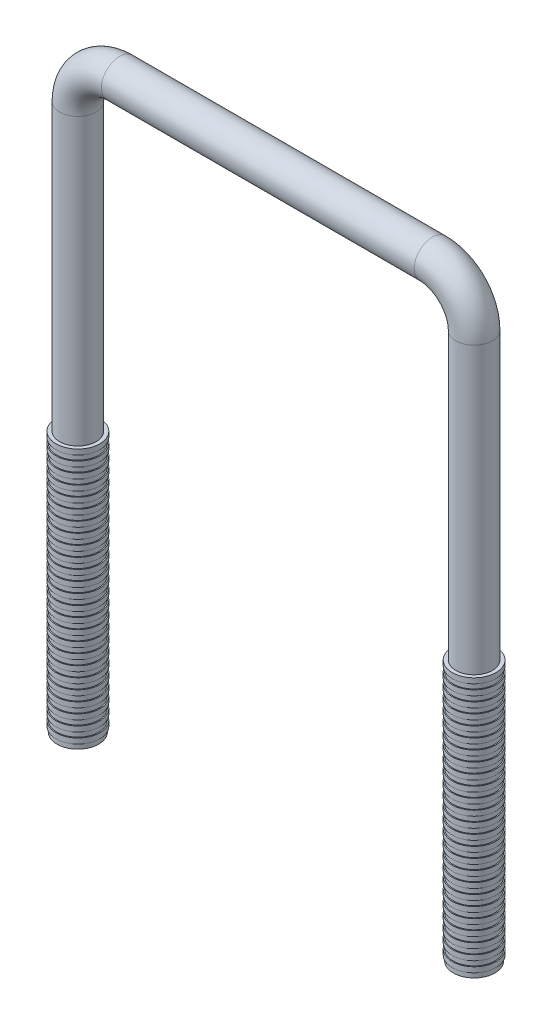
ISO-10303-21;
HEADER;
FILE_DESCRIPTION(('STEP AP214'),'2;1');
FILE_NAME('part.step','',(''),(''),'','','');
FILE_SCHEMA(('AUTOMOTIVE_DESIGN { 1 0 10303 214 1 1 1 1 }'));
ENDSEC;
DATA;
#1=APPLICATION_CONTEXT('core data for automotive mechanical design processes');
#2=APPLICATION_PROTOCOL_DEFINITION('international standard','automotive_design',2000,#1);
#3=PRODUCT_CONTEXT('',#1,'mechanical');
#4=PRODUCT('Part','Part','',(#3));
#5=PRODUCT_RELATED_PRODUCT_CATEGORY('part','',(#4));
#6=PRODUCT_DEFINITION_FORMATION('','',#4);
#7=PRODUCT_DEFINITION_CONTEXT('part definition',#1,'design');
#8=PRODUCT_DEFINITION('design','',#6,#7);
#9=PRODUCT_DEFINITION_SHAPE('','',#8);
#10=(LENGTH_UNIT() NAMED_UNIT(*) SI_UNIT(.MILLI.,.METRE.));
#11=(NAMED_UNIT(*) PLANE_ANGLE_UNIT() SI_UNIT($,.RADIAN.));
#12=(NAMED_UNIT(*) SI_UNIT($,.STERADIAN.) SOLID_ANGLE_UNIT());
#13=UNCERTAINTY_MEASURE_WITH_UNIT(LENGTH_MEASURE(1.E-05),#10,'distance_accuracy_value','');
#14=(GEOMETRIC_REPRESENTATION_CONTEXT(3) GLOBAL_UNCERTAINTY_ASSIGNED_CONTEXT((#13)) GLOBAL_UNIT_ASSIGNED_CONTEXT((#10,
#11,#12)) REPRESENTATION_CONTEXT('',''));
#15=CARTESIAN_POINT('',(0.,0.,0.));
#16=DIRECTION('',(0.,0.,1.));
#17=DIRECTION('',(1.,0.,0.));
#18=AXIS2_PLACEMENT_3D('',#15,#16,#17);
#19=CARTESIAN_POINT('',(-34.458,0.,-3.542));
#20=DIRECTION('',(0.,-1.,0.));
#21=DIRECTION('',(0.,0.,1.));
#22=AXIS2_PLACEMENT_3D('',#19,#20,#21);
#23=PLANE('',#22);
#24=CARTESIAN_POINT('',(-38.,0.,0.));
#25=DIRECTION('',(0.,-1.,0.));
#26=DIRECTION('',(0.,0.,-1.));
#27=AXIS2_PLACEMENT_3D('',#24,#25,#26);
#28=CIRCLE('',#27,3.5);
#29=CARTESIAN_POINT('',(-38.,0.,-3.5));
#30=VERTEX_POINT('',#29);
#31=EDGE_CURVE('E19',#30,#30,#28,.F.);
#32=ORIENTED_EDGE('',*,*,#31,.F.);
#33=EDGE_LOOP('',(#32));
#34=FACE_BOUND('',#33,.T.);
#35=ADVANCED_FACE('F15',(#34),#23,.T.);
#36=CARTESIAN_POINT('',(-38.,0.275,0.));
#37=DIRECTION('',(0.,-1.,0.));
#38=DIRECTION('',(0.,0.,-1.));
#39=AXIS2_PLACEMENT_3D('',#36,#37,#38);
#40=CYLINDRICAL_SURFACE('',#39,3.5);
#41=ORIENTED_EDGE('',*,*,#31,.T.);
#42=EDGE_LOOP('',(#41));
#43=FACE_BOUND('',#42,.T.);
#44=CARTESIAN_POINT('',(-38.,0.25,0.));
#45=DIRECTION('',(0.,-1.,0.));
#46=DIRECTION('',(0.,0.,-1.));
#47=AXIS2_PLACEMENT_3D('',#44,#45,#46);
#48=CIRCLE('',#47,3.5);
#49=CARTESIAN_POINT('',(-38.,0.25,-3.5));
#50=VERTEX_POINT('',#49);
#51=EDGE_CURVE('E647',#50,#50,#48,.F.);
#52=ORIENTED_EDGE('',*,*,#51,.F.);
#53=EDGE_LOOP('',(#52));
#54=FACE_BOUND('',#53,.T.);
#55=ADVANCED_FACE('F654',(#43,#54),#40,.T.);
#56=CARTESIAN_POINT('',(-42.048,0.25,4.048));
#57=DIRECTION('',(0.,-1.,0.));
#58=DIRECTION('',(0.,0.,-1.));
#59=AXIS2_PLACEMENT_3D('',#56,#57,#58);
#60=PLANE('',#59);
#61=ORIENTED_EDGE('',*,*,#51,.T.);
#62=EDGE_LOOP('',(#61));
#63=FACE_BOUND('',#62,.T.);
#64=CARTESIAN_POINT('',(-38.,0.25,0.));
#65=DIRECTION('',(0.,1.,0.));
#66=DIRECTION('',(0.,0.,1.));
#67=AXIS2_PLACEMENT_3D('',#64,#65,#66);
#68=CIRCLE('',#67,4.);
#69=CARTESIAN_POINT('',(-38.,0.25,4.));
#70=VERTEX_POINT('',#69);
#71=EDGE_CURVE('E645',#70,#70,#68,.T.);
#72=ORIENTED_EDGE('',*,*,#71,.F.);
#73=EDGE_LOOP('',(#72));
#74=FACE_BOUND('',#73,.T.);
#75=ADVANCED_FACE('F663',(#63,#74),#60,.T.);
#76=CARTESIAN_POINT('',(34.458,0.,-3.542));
#77=DIRECTION('',(0.,1.,0.));
#78=DIRECTION('',(0.,0.,1.));
#79=AXIS2_PLACEMENT_3D('',#76,#77,#78);
#80=PLANE('',#79);
#81=CARTESIAN_POINT('',(38.,0.,0.));
#82=DIRECTION('',(0.,-1.,0.));
#83=DIRECTION('',(0.,0.,-1.));
#84=AXIS2_PLACEMENT_3D('',#81,#82,#83);
#85=CIRCLE('',#84,3.5);
#86=CARTESIAN_POINT('',(38.,0.,-3.5));
#87=VERTEX_POINT('',#86);
#88=EDGE_CURVE('E642',#87,#87,#85,.F.);
#89=ORIENTED_EDGE('',*,*,#88,.F.);
#90=EDGE_LOOP('',(#89));
#91=FACE_BOUND('',#90,.T.);
#92=ADVANCED_FACE('F2559',(#91),#80,.F.);
#93=CARTESIAN_POINT('',(-38.,0.15,0.));
#94=DIRECTION('',(0.,1.,0.));
#95=DIRECTION('',(0.,0.,1.));
#96=AXIS2_PLACEMENT_3D('',#93,#94,#95);
#97=CYLINDRICAL_SURFACE('',#96,4.);
#98=ORIENTED_EDGE('',*,*,#71,.T.);
#99=EDGE_LOOP('',(#98));
#100=FACE_BOUND('',#99,.T.);
#101=CARTESIAN_POINT('',(-38.,1.25,0.));
#102=DIRECTION('',(0.,1.,0.));
#103=DIRECTION('',(0.,0.,1.));
#104=AXIS2_PLACEMENT_3D('',#101,#102,#103);
#105=CIRCLE('',#104,4.);
#106=CARTESIAN_POINT('',(-38.,1.25,4.));
#107=VERTEX_POINT('',#106);
#108=EDGE_CURVE('E639',#107,#107,#105,.T.);
#109=ORIENTED_EDGE('',*,*,#108,.F.);
#110=EDGE_LOOP('',(#109));
#111=FACE_BOUND('',#110,.T.);
#112=ADVANCED_FACE('F2550',(#100,#111),#97,.T.);
#113=CARTESIAN_POINT('',(38.,0.275,0.));
#114=DIRECTION('',(0.,-1.,0.));
#115=DIRECTION('',(0.,0.,-1.));
#116=AXIS2_PLACEMENT_3D('',#113,#114,#115);
#117=CYLINDRICAL_SURFACE('',#116,3.5);
#118=CARTESIAN_POINT('',(38.,0.25,0.));
#119=DIRECTION('',(0.,-1.,0.));
#120=DIRECTION('',(0.,0.,-1.));
#121=AXIS2_PLACEMENT_3D('',#118,#119,#120);
#122=CIRCLE('',#121,3.5);
#123=CARTESIAN_POINT('',(38.,0.25,-3.5));
#124=VERTEX_POINT('',#123);
#125=EDGE_CURVE('E636',#124,#124,#122,.T.);
#126=ORIENTED_EDGE('',*,*,#125,.T.);
#127=EDGE_LOOP('',(#126));
#128=FACE_BOUND('',#127,.T.);
#129=ORIENTED_EDGE('',*,*,#88,.T.);
#130=EDGE_LOOP('',(#129));
#131=FACE_BOUND('',#130,.T.);
#132=ADVANCED_FACE('F2541',(#128,#131),#117,.T.);
#133=CARTESIAN_POINT('',(-42.2504,1.25,4.2504));
#134=DIRECTION('',(0.,-1.,0.));
#135=DIRECTION('',(0.,0.,-1.));
#136=AXIS2_PLACEMENT_3D('',#133,#134,#135);
#137=PLANE('',#136);
#138=ORIENTED_EDGE('',*,*,#108,.T.);
#139=EDGE_LOOP('',(#138));
#140=FACE_BOUND('',#139,.T.);
#141=CARTESIAN_POINT('',(-38.,1.25,0.));
#142=DIRECTION('',(0.,1.,0.));
#143=DIRECTION('',(0.,0.,1.));
#144=AXIS2_PLACEMENT_3D('',#141,#142,#143);
#145=CIRCLE('',#144,4.2);
#146=CARTESIAN_POINT('',(-38.,1.25,4.2));
#147=VERTEX_POINT('',#146);
#148=EDGE_CURVE('E633',#147,#147,#145,.T.);
#149=ORIENTED_EDGE('',*,*,#148,.F.);
#150=EDGE_LOOP('',(#149));
#151=FACE_BOUND('',#150,.T.);
#152=ADVANCED_FACE('F2532',(#140,#151),#137,.T.);
#153=CARTESIAN_POINT('',(33.952,0.25,-4.048));
#154=DIRECTION('',(0.,1.,0.));
#155=DIRECTION('',(0.,0.,1.));
#156=AXIS2_PLACEMENT_3D('',#153,#154,#155);
#157=PLANE('',#156);
#158=ORIENTED_EDGE('',*,*,#125,.F.);
#159=EDGE_LOOP('',(#158));
#160=FACE_BOUND('',#159,.T.);
#161=CARTESIAN_POINT('',(38.,0.25,0.));
#162=DIRECTION('',(0.,-1.,0.));
#163=DIRECTION('',(0.,0.,-1.));
#164=AXIS2_PLACEMENT_3D('',#161,#162,#163);
#165=CIRCLE('',#164,4.);
#166=CARTESIAN_POINT('',(38.,0.25,-4.));
#167=VERTEX_POINT('',#166);
#168=EDGE_CURVE('E630',#167,#167,#165,.F.);
#169=ORIENTED_EDGE('',*,*,#168,.F.);
#170=EDGE_LOOP('',(#169));
#171=FACE_BOUND('',#170,.T.);
#172=ADVANCED_FACE('F2523',(#160,#171),#157,.F.);
#173=CARTESIAN_POINT('',(-38.,1.15,0.));
#174=DIRECTION('',(0.,1.,0.));
#175=DIRECTION('',(0.,0.,1.));
#176=AXIS2_PLACEMENT_3D('',#173,#174,#175);
#177=CYLINDRICAL_SURFACE('',#176,4.2);
#178=ORIENTED_EDGE('',*,*,#148,.T.);
#179=EDGE_LOOP('',(#178));
#180=FACE_BOUND('',#179,.T.);
#181=CARTESIAN_POINT('',(-38.,2.25,0.));
#182=DIRECTION('',(0.,1.,0.));
#183=DIRECTION('',(0.,0.,1.));
#184=AXIS2_PLACEMENT_3D('',#181,#182,#183);
#185=CIRCLE('',#184,4.2);
#186=CARTESIAN_POINT('',(-38.,2.25,4.2));
#187=VERTEX_POINT('',#186);
#188=EDGE_CURVE('E627',#187,#187,#185,.T.);
#189=ORIENTED_EDGE('',*,*,#188,.F.);
#190=EDGE_LOOP('',(#189));
#191=FACE_BOUND('',#190,.T.);
#192=ADVANCED_FACE('F2514',(#180,#191),#177,.T.);
#193=CARTESIAN_POINT('',(38.,1.35,0.));
#194=DIRECTION('',(0.,-1.,0.));
#195=DIRECTION('',(0.,0.,-1.));
#196=AXIS2_PLACEMENT_3D('',#193,#194,#195);
#197=CYLINDRICAL_SURFACE('',#196,4.);
#198=ORIENTED_EDGE('',*,*,#168,.T.);
#199=EDGE_LOOP('',(#198));
#200=FACE_BOUND('',#199,.T.);
#201=CARTESIAN_POINT('',(38.,1.25,0.));
#202=DIRECTION('',(0.,-1.,0.));
#203=DIRECTION('',(0.,0.,-1.));
#204=AXIS2_PLACEMENT_3D('',#201,#202,#203);
#205=CIRCLE('',#204,4.);
#206=CARTESIAN_POINT('',(38.,1.25,-4.));
#207=VERTEX_POINT('',#206);
#208=EDGE_CURVE('E624',#207,#207,#205,.T.);
#209=ORIENTED_EDGE('',*,*,#208,.T.);
#210=EDGE_LOOP('',(#209));
#211=FACE_BOUND('',#210,.T.);
#212=ADVANCED_FACE('F2505',(#200,#211),#197,.T.);
#213=CARTESIAN_POINT('',(-42.2504,2.25,-4.2504));
#214=DIRECTION('',(0.,1.,0.));
#215=DIRECTION('',(0.,0.,1.));
#216=AXIS2_PLACEMENT_3D('',#213,#214,#215);
#217=PLANE('',#216);
#218=CARTESIAN_POINT('',(-38.,2.25,0.));
#219=DIRECTION('',(0.,1.,0.));
#220=DIRECTION('',(0.,0.,1.));
#221=AXIS2_PLACEMENT_3D('',#218,#219,#220);
#222=CIRCLE('',#221,4.);
#223=CARTESIAN_POINT('',(-38.,2.25,4.));
#224=VERTEX_POINT('',#223);
#225=EDGE_CURVE('E621',#224,#224,#222,.T.);
#226=ORIENTED_EDGE('',*,*,#225,.F.);
#227=EDGE_LOOP('',(#226));
#228=FACE_BOUND('',#227,.T.);
#229=ORIENTED_EDGE('',*,*,#188,.T.);
#230=EDGE_LOOP('',(#229));
#231=FACE_BOUND('',#230,.T.);
#232=ADVANCED_FACE('F2496',(#228,#231),#217,.T.);
#233=CARTESIAN_POINT('',(33.7496,1.25,-4.2504));
#234=DIRECTION('',(0.,1.,0.));
#235=DIRECTION('',(0.,0.,1.));
#236=AXIS2_PLACEMENT_3D('',#233,#234,#235);
#237=PLANE('',#236);
#238=ORIENTED_EDGE('',*,*,#208,.F.);
#239=EDGE_LOOP('',(#238));
#240=FACE_BOUND('',#239,.T.);
#241=CARTESIAN_POINT('',(38.,1.25,0.));
#242=DIRECTION('',(0.,-1.,0.));
#243=DIRECTION('',(0.,0.,-1.));
#244=AXIS2_PLACEMENT_3D('',#241,#242,#243);
#245=CIRCLE('',#244,4.2);
#246=CARTESIAN_POINT('',(38.,1.25,-4.2));
#247=VERTEX_POINT('',#246);
#248=EDGE_CURVE('E618',#247,#247,#245,.F.);
#249=ORIENTED_EDGE('',*,*,#248,.F.);
#250=EDGE_LOOP('',(#249));
#251=FACE_BOUND('',#250,.T.);
#252=ADVANCED_FACE('F2487',(#240,#251),#237,.F.);
#253=CARTESIAN_POINT('',(-38.,2.15,0.));
#254=DIRECTION('',(0.,1.,0.));
#255=DIRECTION('',(0.,0.,1.));
#256=AXIS2_PLACEMENT_3D('',#253,#254,#255);
#257=CYLINDRICAL_SURFACE('',#256,4.);
#258=ORIENTED_EDGE('',*,*,#225,.T.);
#259=EDGE_LOOP('',(#258));
#260=FACE_BOUND('',#259,.T.);
#261=CARTESIAN_POINT('',(-38.,3.25,0.));
#262=DIRECTION('',(0.,1.,0.));
#263=DIRECTION('',(0.,0.,1.));
#264=AXIS2_PLACEMENT_3D('',#261,#262,#263);
#265=CIRCLE('',#264,4.);
#266=CARTESIAN_POINT('',(-38.,3.25,4.));
#267=VERTEX_POINT('',#266);
#268=EDGE_CURVE('E615',#267,#267,#265,.T.);
#269=ORIENTED_EDGE('',*,*,#268,.F.);
#270=EDGE_LOOP('',(#269));
#271=FACE_BOUND('',#270,.T.);
#272=ADVANCED_FACE('F2478',(#260,#271),#257,.T.);
#273=CARTESIAN_POINT('',(38.,2.35,0.));
#274=DIRECTION('',(0.,-1.,0.));
#275=DIRECTION('',(0.,0.,-1.));
#276=AXIS2_PLACEMENT_3D('',#273,#274,#275);
#277=CYLINDRICAL_SURFACE('',#276,4.2);
#278=ORIENTED_EDGE('',*,*,#248,.T.);
#279=EDGE_LOOP('',(#278));
#280=FACE_BOUND('',#279,.T.);
#281=CARTESIAN_POINT('',(38.,2.25,0.));
#282=DIRECTION('',(0.,-1.,0.));
#283=DIRECTION('',(0.,0.,-1.));
#284=AXIS2_PLACEMENT_3D('',#281,#282,#283);
#285=CIRCLE('',#284,4.2);
#286=CARTESIAN_POINT('',(38.,2.25,-4.2));
#287=VERTEX_POINT('',#286);
#288=EDGE_CURVE('E612',#287,#287,#285,.T.);
#289=ORIENTED_EDGE('',*,*,#288,.T.);
#290=EDGE_LOOP('',(#289));
#291=FACE_BOUND('',#290,.T.);
#292=ADVANCED_FACE('F2469',(#280,#291),#277,.T.);
#293=CARTESIAN_POINT('',(-42.2504,3.25,4.2504));
#294=DIRECTION('',(0.,-1.,0.));
#295=DIRECTION('',(0.,0.,-1.));
#296=AXIS2_PLACEMENT_3D('',#293,#294,#295);
#297=PLANE('',#296);
#298=ORIENTED_EDGE('',*,*,#268,.T.);
#299=EDGE_LOOP('',(#298));
#300=FACE_BOUND('',#299,.T.);
#301=CARTESIAN_POINT('',(-38.,3.25,0.));
#302=DIRECTION('',(0.,1.,0.));
#303=DIRECTION('',(0.,0.,1.));
#304=AXIS2_PLACEMENT_3D('',#301,#302,#303);
#305=CIRCLE('',#304,4.2);
#306=CARTESIAN_POINT('',(-38.,3.25,4.2));
#307=VERTEX_POINT('',#306);
#308=EDGE_CURVE('E609',#307,#307,#305,.T.);
#309=ORIENTED_EDGE('',*,*,#308,.F.);
#310=EDGE_LOOP('',(#309));
#311=FACE_BOUND('',#310,.T.);
#312=ADVANCED_FACE('F2460',(#300,#311),#297,.T.);
#313=CARTESIAN_POINT('',(33.7496,2.25,4.2504));
#314=DIRECTION('',(0.,-1.,0.));
#315=DIRECTION('',(0.,0.,-1.));
#316=AXIS2_PLACEMENT_3D('',#313,#314,#315);
#317=PLANE('',#316);
#318=CARTESIAN_POINT('',(38.,2.25,0.));
#319=DIRECTION('',(0.,-1.,0.));
#320=DIRECTION('',(0.,0.,-1.));
#321=AXIS2_PLACEMENT_3D('',#318,#319,#320);
#322=CIRCLE('',#321,4.);
#323=CARTESIAN_POINT('',(38.,2.25,-4.));
#324=VERTEX_POINT('',#323);
#325=EDGE_CURVE('E606',#324,#324,#322,.F.);
#326=ORIENTED_EDGE('',*,*,#325,.F.);
#327=EDGE_LOOP('',(#326));
#328=FACE_BOUND('',#327,.T.);
#329=ORIENTED_EDGE('',*,*,#288,.F.);
#330=EDGE_LOOP('',(#329));
#331=FACE_BOUND('',#330,.T.);
#332=ADVANCED_FACE('F2451',(#328,#331),#317,.F.);
#333=CARTESIAN_POINT('',(-38.,3.15,0.));
#334=DIRECTION('',(0.,1.,0.));
#335=DIRECTION('',(0.,0.,1.));
#336=AXIS2_PLACEMENT_3D('',#333,#334,#335);
#337=CYLINDRICAL_SURFACE('',#336,4.2);
#338=ORIENTED_EDGE('',*,*,#308,.T.);
#339=EDGE_LOOP('',(#338));
#340=FACE_BOUND('',#339,.T.);
#341=CARTESIAN_POINT('',(-38.,4.25,0.));
#342=DIRECTION('',(0.,1.,0.));
#343=DIRECTION('',(0.,0.,1.));
#344=AXIS2_PLACEMENT_3D('',#341,#342,#343);
#345=CIRCLE('',#344,4.2);
#346=CARTESIAN_POINT('',(-38.,4.25,4.2));
#347=VERTEX_POINT('',#346);
#348=EDGE_CURVE('E603',#347,#347,#345,.T.);
#349=ORIENTED_EDGE('',*,*,#348,.F.);
#350=EDGE_LOOP('',(#349));
#351=FACE_BOUND('',#350,.T.);
#352=ADVANCED_FACE('F2442',(#340,#351),#337,.T.);
#353=CARTESIAN_POINT('',(38.,3.35,0.));
#354=DIRECTION('',(0.,-1.,0.));
#355=DIRECTION('',(0.,0.,-1.));
#356=AXIS2_PLACEMENT_3D('',#353,#354,#355);
#357=CYLINDRICAL_SURFACE('',#356,4.);
#358=ORIENTED_EDGE('',*,*,#325,.T.);
#359=EDGE_LOOP('',(#358));
#360=FACE_BOUND('',#359,.T.);
#361=CARTESIAN_POINT('',(38.,3.25,0.));
#362=DIRECTION('',(0.,-1.,0.));
#363=DIRECTION('',(0.,0.,-1.));
#364=AXIS2_PLACEMENT_3D('',#361,#362,#363);
#365=CIRCLE('',#364,4.);
#366=CARTESIAN_POINT('',(38.,3.25,-4.));
#367=VERTEX_POINT('',#366);
#368=EDGE_CURVE('E600',#367,#367,#365,.T.);
#369=ORIENTED_EDGE('',*,*,#368,.T.);
#370=EDGE_LOOP('',(#369));
#371=FACE_BOUND('',#370,.T.);
#372=ADVANCED_FACE('F2433',(#360,#371),#357,.T.);
#373=CARTESIAN_POINT('',(-42.2504,4.25,-4.2504));
#374=DIRECTION('',(0.,1.,0.));
#375=DIRECTION('',(0.,0.,1.));
#376=AXIS2_PLACEMENT_3D('',#373,#374,#375);
#377=PLANE('',#376);
#378=CARTESIAN_POINT('',(-38.,4.25,0.));
#379=DIRECTION('',(0.,1.,0.));
#380=DIRECTION('',(0.,0.,1.));
#381=AXIS2_PLACEMENT_3D('',#378,#379,#380);
#382=CIRCLE('',#381,4.);
#383=CARTESIAN_POINT('',(-38.,4.25,4.));
#384=VERTEX_POINT('',#383);
#385=EDGE_CURVE('E597',#384,#384,#382,.T.);
#386=ORIENTED_EDGE('',*,*,#385,.F.);
#387=EDGE_LOOP('',(#386));
#388=FACE_BOUND('',#387,.T.);
#389=ORIENTED_EDGE('',*,*,#348,.T.);
#390=EDGE_LOOP('',(#389));
#391=FACE_BOUND('',#390,.T.);
#392=ADVANCED_FACE('F2424',(#388,#391),#377,.T.);
#393=CARTESIAN_POINT('',(33.7496,3.25,-4.2504));
#394=DIRECTION('',(0.,1.,0.));
#395=DIRECTION('',(0.,0.,1.));
#396=AXIS2_PLACEMENT_3D('',#393,#394,#395);
#397=PLANE('',#396);
#398=ORIENTED_EDGE('',*,*,#368,.F.);
#399=EDGE_LOOP('',(#398));
#400=FACE_BOUND('',#399,.T.);
#401=CARTESIAN_POINT('',(38.,3.25,0.));
#402=DIRECTION('',(0.,-1.,0.));
#403=DIRECTION('',(0.,0.,-1.));
#404=AXIS2_PLACEMENT_3D('',#401,#402,#403);
#405=CIRCLE('',#404,4.2);
#406=CARTESIAN_POINT('',(38.,3.25,-4.2));
#407=VERTEX_POINT('',#406);
#408=EDGE_CURVE('E594',#407,#407,#405,.F.);
#409=ORIENTED_EDGE('',*,*,#408,.F.);
#410=EDGE_LOOP('',(#409));
#411=FACE_BOUND('',#410,.T.);
#412=ADVANCED_FACE('F2415',(#400,#411),#397,.F.);
#413=CARTESIAN_POINT('',(-38.,4.15,0.));
#414=DIRECTION('',(0.,1.,0.));
#415=DIRECTION('',(0.,0.,1.));
#416=AXIS2_PLACEMENT_3D('',#413,#414,#415);
#417=CYLINDRICAL_SURFACE('',#416,4.);
#418=ORIENTED_EDGE('',*,*,#385,.T.);
#419=EDGE_LOOP('',(#418));
#420=FACE_BOUND('',#419,.T.);
#421=CARTESIAN_POINT('',(-38.,5.25,0.));
#422=DIRECTION('',(0.,1.,0.));
#423=DIRECTION('',(0.,0.,1.));
#424=AXIS2_PLACEMENT_3D('',#421,#422,#423);
#425=CIRCLE('',#424,4.);
#426=CARTESIAN_POINT('',(-38.,5.25,4.));
#427=VERTEX_POINT('',#426);
#428=EDGE_CURVE('E591',#427,#427,#425,.T.);
#429=ORIENTED_EDGE('',*,*,#428,.F.);
#430=EDGE_LOOP('',(#429));
#431=FACE_BOUND('',#430,.T.);
#432=ADVANCED_FACE('F2406',(#420,#431),#417,.T.);
#433=CARTESIAN_POINT('',(38.,4.35,0.));
#434=DIRECTION('',(0.,-1.,0.));
#435=DIRECTION('',(0.,0.,-1.));
#436=AXIS2_PLACEMENT_3D('',#433,#434,#435);
#437=CYLINDRICAL_SURFACE('',#436,4.2);
#438=ORIENTED_EDGE('',*,*,#408,.T.);
#439=EDGE_LOOP('',(#438));
#440=FACE_BOUND('',#439,.T.);
#441=CARTESIAN_POINT('',(38.,4.25,0.));
#442=DIRECTION('',(0.,-1.,0.));
#443=DIRECTION('',(0.,0.,-1.));
#444=AXIS2_PLACEMENT_3D('',#441,#442,#443);
#445=CIRCLE('',#444,4.2);
#446=CARTESIAN_POINT('',(38.,4.25,-4.2));
#447=VERTEX_POINT('',#446);
#448=EDGE_CURVE('E588',#447,#447,#445,.T.);
#449=ORIENTED_EDGE('',*,*,#448,.T.);
#450=EDGE_LOOP('',(#449));
#451=FACE_BOUND('',#450,.T.);
#452=ADVANCED_FACE('F2397',(#440,#451),#437,.T.);
#453=CARTESIAN_POINT('',(-42.2504,5.25,4.2504));
#454=DIRECTION('',(0.,-1.,0.));
#455=DIRECTION('',(0.,0.,-1.));
#456=AXIS2_PLACEMENT_3D('',#453,#454,#455);
#457=PLANE('',#456);
#458=ORIENTED_EDGE('',*,*,#428,.T.);
#459=EDGE_LOOP('',(#458));
#460=FACE_BOUND('',#459,.T.);
#461=CARTESIAN_POINT('',(-38.,5.25,0.));
#462=DIRECTION('',(0.,1.,0.));
#463=DIRECTION('',(0.,0.,1.));
#464=AXIS2_PLACEMENT_3D('',#461,#462,#463);
#465=CIRCLE('',#464,4.2);
#466=CARTESIAN_POINT('',(-38.,5.25,4.2));
#467=VERTEX_POINT('',#466);
#468=EDGE_CURVE('E585',#467,#467,#465,.T.);
#469=ORIENTED_EDGE('',*,*,#468,.F.);
#470=EDGE_LOOP('',(#469));
#471=FACE_BOUND('',#470,.T.);
#472=ADVANCED_FACE('F2388',(#460,#471),#457,.T.);
#473=CARTESIAN_POINT('',(33.7496,4.25,4.2504));
#474=DIRECTION('',(0.,-1.,0.));
#475=DIRECTION('',(0.,0.,-1.));
#476=AXIS2_PLACEMENT_3D('',#473,#474,#475);
#477=PLANE('',#476);
#478=CARTESIAN_POINT('',(38.,4.25,0.));
#479=DIRECTION('',(0.,-1.,0.));
#480=DIRECTION('',(0.,0.,-1.));
#481=AXIS2_PLACEMENT_3D('',#478,#479,#480);
#482=CIRCLE('',#481,4.);
#483=CARTESIAN_POINT('',(38.,4.25,-4.));
#484=VERTEX_POINT('',#483);
#485=EDGE_CURVE('E582',#484,#484,#482,.F.);
#486=ORIENTED_EDGE('',*,*,#485,.F.);
#487=EDGE_LOOP('',(#486));
#488=FACE_BOUND('',#487,.T.);
#489=ORIENTED_EDGE('',*,*,#448,.F.);
#490=EDGE_LOOP('',(#489));
#491=FACE_BOUND('',#490,.T.);
#492=ADVANCED_FACE('F2379',(#488,#491),#477,.F.);
#493=CARTESIAN_POINT('',(-38.,5.15,0.));
#494=DIRECTION('',(0.,1.,0.));
#495=DIRECTION('',(0.,0.,1.));
#496=AXIS2_PLACEMENT_3D('',#493,#494,#495);
#497=CYLINDRICAL_SURFACE('',#496,4.2);
#498=ORIENTED_EDGE('',*,*,#468,.T.);
#499=EDGE_LOOP('',(#498));
#500=FACE_BOUND('',#499,.T.);
#501=CARTESIAN_POINT('',(-38.,6.25,0.));
#502=DIRECTION('',(0.,1.,0.));
#503=DIRECTION('',(0.,0.,1.));
#504=AXIS2_PLACEMENT_3D('',#501,#502,#503);
#505=CIRCLE('',#504,4.2);
#506=CARTESIAN_POINT('',(-38.,6.25,4.2));
#507=VERTEX_POINT('',#506);
#508=EDGE_CURVE('E579',#507,#507,#505,.T.);
#509=ORIENTED_EDGE('',*,*,#508,.F.);
#510=EDGE_LOOP('',(#509));
#511=FACE_BOUND('',#510,.T.);
#512=ADVANCED_FACE('F2370',(#500,#511),#497,.T.);
#513=CARTESIAN_POINT('',(38.,5.35,0.));
#514=DIRECTION('',(0.,-1.,0.));
#515=DIRECTION('',(0.,0.,-1.));
#516=AXIS2_PLACEMENT_3D('',#513,#514,#515);
#517=CYLINDRICAL_SURFACE('',#516,4.);
#518=ORIENTED_EDGE('',*,*,#485,.T.);
#519=EDGE_LOOP('',(#518));
#520=FACE_BOUND('',#519,.T.);
#521=CARTESIAN_POINT('',(38.,5.25,0.));
#522=DIRECTION('',(0.,-1.,0.));
#523=DIRECTION('',(0.,0.,-1.));
#524=AXIS2_PLACEMENT_3D('',#521,#522,#523);
#525=CIRCLE('',#524,4.);
#526=CARTESIAN_POINT('',(38.,5.25,-4.));
#527=VERTEX_POINT('',#526);
#528=EDGE_CURVE('E576',#527,#527,#525,.T.);
#529=ORIENTED_EDGE('',*,*,#528,.T.);
#530=EDGE_LOOP('',(#529));
#531=FACE_BOUND('',#530,.T.);
#532=ADVANCED_FACE('F2361',(#520,#531),#517,.T.);
#533=CARTESIAN_POINT('',(-42.2504,6.25,-4.2504));
#534=DIRECTION('',(0.,1.,0.));
#535=DIRECTION('',(0.,0.,1.));
#536=AXIS2_PLACEMENT_3D('',#533,#534,#535);
#537=PLANE('',#536);
#538=CARTESIAN_POINT('',(-38.,6.25,0.));
#539=DIRECTION('',(0.,1.,0.));
#540=DIRECTION('',(0.,0.,1.));
#541=AXIS2_PLACEMENT_3D('',#538,#539,#540);
#542=CIRCLE('',#541,4.);
#543=CARTESIAN_POINT('',(-38.,6.25,4.));
#544=VERTEX_POINT('',#543);
#545=EDGE_CURVE('E573',#544,#544,#542,.T.);
#546=ORIENTED_EDGE('',*,*,#545,.F.);
#547=EDGE_LOOP('',(#546));
#548=FACE_BOUND('',#547,.T.);
#549=ORIENTED_EDGE('',*,*,#508,.T.);
#550=EDGE_LOOP('',(#549));
#551=FACE_BOUND('',#550,.T.);
#552=ADVANCED_FACE('F2352',(#548,#551),#537,.T.);
#553=CARTESIAN_POINT('',(33.7496,5.25,-4.2504));
#554=DIRECTION('',(0.,1.,0.));
#555=DIRECTION('',(0.,0.,1.));
#556=AXIS2_PLACEMENT_3D('',#553,#554,#555);
#557=PLANE('',#556);
#558=ORIENTED_EDGE('',*,*,#528,.F.);
#559=EDGE_LOOP('',(#558));
#560=FACE_BOUND('',#559,.T.);
#561=CARTESIAN_POINT('',(38.,5.25,0.));
#562=DIRECTION('',(0.,-1.,0.));
#563=DIRECTION('',(0.,0.,-1.));
#564=AXIS2_PLACEMENT_3D('',#561,#562,#563);
#565=CIRCLE('',#564,4.2);
#566=CARTESIAN_POINT('',(38.,5.25,-4.2));
#567=VERTEX_POINT('',#566);
#568=EDGE_CURVE('E570',#567,#567,#565,.F.);
#569=ORIENTED_EDGE('',*,*,#568,.F.);
#570=EDGE_LOOP('',(#569));
#571=FACE_BOUND('',#570,.T.);
#572=ADVANCED_FACE('F2343',(#560,#571),#557,.F.);
#573=CARTESIAN_POINT('',(-38.,6.15,0.));
#574=DIRECTION('',(0.,1.,0.));
#575=DIRECTION('',(0.,0.,1.));
#576=AXIS2_PLACEMENT_3D('',#573,#574,#575);
#577=CYLINDRICAL_SURFACE('',#576,4.);
#578=ORIENTED_EDGE('',*,*,#545,.T.);
#579=EDGE_LOOP('',(#578));
#580=FACE_BOUND('',#579,.T.);
#581=CARTESIAN_POINT('',(-38.,7.25,0.));
#582=DIRECTION('',(0.,1.,0.));
#583=DIRECTION('',(0.,0.,1.));
#584=AXIS2_PLACEMENT_3D('',#581,#582,#583);
#585=CIRCLE('',#584,4.);
#586=CARTESIAN_POINT('',(-38.,7.25,4.));
#587=VERTEX_POINT('',#586);
#588=EDGE_CURVE('E567',#587,#587,#585,.T.);
#589=ORIENTED_EDGE('',*,*,#588,.F.);
#590=EDGE_LOOP('',(#589));
#591=FACE_BOUND('',#590,.T.);
#592=ADVANCED_FACE('F2334',(#580,#591),#577,.T.);
#593=CARTESIAN_POINT('',(38.,6.35,0.));
#594=DIRECTION('',(0.,-1.,0.));
#595=DIRECTION('',(0.,0.,-1.));
#596=AXIS2_PLACEMENT_3D('',#593,#594,#595);
#597=CYLINDRICAL_SURFACE('',#596,4.2);
#598=ORIENTED_EDGE('',*,*,#568,.T.);
#599=EDGE_LOOP('',(#598));
#600=FACE_BOUND('',#599,.T.);
#601=CARTESIAN_POINT('',(38.,6.25,0.));
#602=DIRECTION('',(0.,-1.,0.));
#603=DIRECTION('',(0.,0.,-1.));
#604=AXIS2_PLACEMENT_3D('',#601,#602,#603);
#605=CIRCLE('',#604,4.2);
#606=CARTESIAN_POINT('',(38.,6.25,-4.2));
#607=VERTEX_POINT('',#606);
#608=EDGE_CURVE('E564',#607,#607,#605,.T.);
#609=ORIENTED_EDGE('',*,*,#608,.T.);
#610=EDGE_LOOP('',(#609));
#611=FACE_BOUND('',#610,.T.);
#612=ADVANCED_FACE('F2325',(#600,#611),#597,.T.);
#613=CARTESIAN_POINT('',(-42.2504,7.25,4.2504));
#614=DIRECTION('',(0.,-1.,0.));
#615=DIRECTION('',(0.,0.,-1.));
#616=AXIS2_PLACEMENT_3D('',#613,#614,#615);
#617=PLANE('',#616);
#618=ORIENTED_EDGE('',*,*,#588,.T.);
#619=EDGE_LOOP('',(#618));
#620=FACE_BOUND('',#619,.T.);
#621=CARTESIAN_POINT('',(-38.,7.25,0.));
#622=DIRECTION('',(0.,1.,0.));
#623=DIRECTION('',(0.,0.,1.));
#624=AXIS2_PLACEMENT_3D('',#621,#622,#623);
#625=CIRCLE('',#624,4.2);
#626=CARTESIAN_POINT('',(-38.,7.25,4.2));
#627=VERTEX_POINT('',#626);
#628=EDGE_CURVE('E561',#627,#627,#625,.T.);
#629=ORIENTED_EDGE('',*,*,#628,.F.);
#630=EDGE_LOOP('',(#629));
#631=FACE_BOUND('',#630,.T.);
#632=ADVANCED_FACE('F2316',(#620,#631),#617,.T.);
#633=CARTESIAN_POINT('',(33.7496,6.25,4.2504));
#634=DIRECTION('',(0.,-1.,0.));
#635=DIRECTION('',(0.,0.,-1.));
#636=AXIS2_PLACEMENT_3D('',#633,#634,#635);
#637=PLANE('',#636);
#638=CARTESIAN_POINT('',(38.,6.25,0.));
#639=DIRECTION('',(0.,-1.,0.));
#640=DIRECTION('',(0.,0.,-1.));
#641=AXIS2_PLACEMENT_3D('',#638,#639,#640);
#642=CIRCLE('',#641,4.);
#643=CARTESIAN_POINT('',(38.,6.25,-4.));
#644=VERTEX_POINT('',#643);
#645=EDGE_CURVE('E558',#644,#644,#642,.F.);
#646=ORIENTED_EDGE('',*,*,#645,.F.);
#647=EDGE_LOOP('',(#646));
#648=FACE_BOUND('',#647,.T.);
#649=ORIENTED_EDGE('',*,*,#608,.F.);
#650=EDGE_LOOP('',(#649));
#651=FACE_BOUND('',#650,.T.);
#652=ADVANCED_FACE('F2307',(#648,#651),#637,.F.);
#653=CARTESIAN_POINT('',(-38.,7.15,0.));
#654=DIRECTION('',(0.,1.,0.));
#655=DIRECTION('',(0.,0.,1.));
#656=AXIS2_PLACEMENT_3D('',#653,#654,#655);
#657=CYLINDRICAL_SURFACE('',#656,4.2);
#658=ORIENTED_EDGE('',*,*,#628,.T.);
#659=EDGE_LOOP('',(#658));
#660=FACE_BOUND('',#659,.T.);
#661=CARTESIAN_POINT('',(-38.,8.25,0.));
#662=DIRECTION('',(0.,1.,0.));
#663=DIRECTION('',(0.,0.,1.));
#664=AXIS2_PLACEMENT_3D('',#661,#662,#663);
#665=CIRCLE('',#664,4.2);
#666=CARTESIAN_POINT('',(-38.,8.25,4.2));
#667=VERTEX_POINT('',#666);
#668=EDGE_CURVE('E555',#667,#667,#665,.T.);
#669=ORIENTED_EDGE('',*,*,#668,.F.);
#670=EDGE_LOOP('',(#669));
#671=FACE_BOUND('',#670,.T.);
#672=ADVANCED_FACE('F2298',(#660,#671),#657,.T.);
#673=CARTESIAN_POINT('',(38.,7.35,0.));
#674=DIRECTION('',(0.,-1.,0.));
#675=DIRECTION('',(0.,0.,-1.));
#676=AXIS2_PLACEMENT_3D('',#673,#674,#675);
#677=CYLINDRICAL_SURFACE('',#676,4.);
#678=ORIENTED_EDGE('',*,*,#645,.T.);
#679=EDGE_LOOP('',(#678));
#680=FACE_BOUND('',#679,.T.);
#681=CARTESIAN_POINT('',(38.,7.25,0.));
#682=DIRECTION('',(0.,-1.,0.));
#683=DIRECTION('',(0.,0.,-1.));
#684=AXIS2_PLACEMENT_3D('',#681,#682,#683);
#685=CIRCLE('',#684,4.);
#686=CARTESIAN_POINT('',(38.,7.25,-4.));
#687=VERTEX_POINT('',#686);
#688=EDGE_CURVE('E552',#687,#687,#685,.T.);
#689=ORIENTED_EDGE('',*,*,#688,.T.);
#690=EDGE_LOOP('',(#689));
#691=FACE_BOUND('',#690,.T.);
#692=ADVANCED_FACE('F2289',(#680,#691),#677,.T.);
#693=CARTESIAN_POINT('',(-42.2504,8.25,-4.2504));
#694=DIRECTION('',(0.,1.,0.));
#695=DIRECTION('',(0.,0.,1.));
#696=AXIS2_PLACEMENT_3D('',#693,#694,#695);
#697=PLANE('',#696);
#698=CARTESIAN_POINT('',(-38.,8.25,0.));
#699=DIRECTION('',(0.,1.,0.));
#700=DIRECTION('',(0.,0.,1.));
#701=AXIS2_PLACEMENT_3D('',#698,#699,#700);
#702=CIRCLE('',#701,4.);
#703=CARTESIAN_POINT('',(-38.,8.25,4.));
#704=VERTEX_POINT('',#703);
#705=EDGE_CURVE('E549',#704,#704,#702,.T.);
#706=ORIENTED_EDGE('',*,*,#705,.F.);
#707=EDGE_LOOP('',(#706));
#708=FACE_BOUND('',#707,.T.);
#709=ORIENTED_EDGE('',*,*,#668,.T.);
#710=EDGE_LOOP('',(#709));
#711=FACE_BOUND('',#710,.T.);
#712=ADVANCED_FACE('F2280',(#708,#711),#697,.T.);
#713=CARTESIAN_POINT('',(33.7496,7.25,-4.2504));
#714=DIRECTION('',(0.,1.,0.));
#715=DIRECTION('',(0.,0.,1.));
#716=AXIS2_PLACEMENT_3D('',#713,#714,#715);
#717=PLANE('',#716);
#718=ORIENTED_EDGE('',*,*,#688,.F.);
#719=EDGE_LOOP('',(#718));
#720=FACE_BOUND('',#719,.T.);
#721=CARTESIAN_POINT('',(38.,7.25,0.));
#722=DIRECTION('',(0.,-1.,0.));
#723=DIRECTION('',(0.,0.,-1.));
#724=AXIS2_PLACEMENT_3D('',#721,#722,#723);
#725=CIRCLE('',#724,4.2);
#726=CARTESIAN_POINT('',(38.,7.25,-4.2));
#727=VERTEX_POINT('',#726);
#728=EDGE_CURVE('E546',#727,#727,#725,.F.);
#729=ORIENTED_EDGE('',*,*,#728,.F.);
#730=EDGE_LOOP('',(#729));
#731=FACE_BOUND('',#730,.T.);
#732=ADVANCED_FACE('F2271',(#720,#731),#717,.F.);
#733=CARTESIAN_POINT('',(-38.,8.15,0.));
#734=DIRECTION('',(0.,1.,0.));
#735=DIRECTION('',(0.,0.,1.));
#736=AXIS2_PLACEMENT_3D('',#733,#734,#735);
#737=CYLINDRICAL_SURFACE('',#736,4.);
#738=ORIENTED_EDGE('',*,*,#705,.T.);
#739=EDGE_LOOP('',(#738));
#740=FACE_BOUND('',#739,.T.);
#741=CARTESIAN_POINT('',(-38.,9.25,0.));
#742=DIRECTION('',(0.,1.,0.));
#743=DIRECTION('',(0.,0.,1.));
#744=AXIS2_PLACEMENT_3D('',#741,#742,#743);
#745=CIRCLE('',#744,4.);
#746=CARTESIAN_POINT('',(-38.,9.25,4.));
#747=VERTEX_POINT('',#746);
#748=EDGE_CURVE('E543',#747,#747,#745,.T.);
#749=ORIENTED_EDGE('',*,*,#748,.F.);
#750=EDGE_LOOP('',(#749));
#751=FACE_BOUND('',#750,.T.);
#752=ADVANCED_FACE('F2262',(#740,#751),#737,.T.);
#753=CARTESIAN_POINT('',(38.,8.35,0.));
#754=DIRECTION('',(0.,-1.,0.));
#755=DIRECTION('',(0.,0.,-1.));
#756=AXIS2_PLACEMENT_3D('',#753,#754,#755);
#757=CYLINDRICAL_SURFACE('',#756,4.2);
#758=ORIENTED_EDGE('',*,*,#728,.T.);
#759=EDGE_LOOP('',(#758));
#760=FACE_BOUND('',#759,.T.);
#761=CARTESIAN_POINT('',(38.,8.25,0.));
#762=DIRECTION('',(0.,-1.,0.));
#763=DIRECTION('',(0.,0.,-1.));
#764=AXIS2_PLACEMENT_3D('',#761,#762,#763);
#765=CIRCLE('',#764,4.2);
#766=CARTESIAN_POINT('',(38.,8.25,-4.2));
#767=VERTEX_POINT('',#766);
#768=EDGE_CURVE('E540',#767,#767,#765,.T.);
#769=ORIENTED_EDGE('',*,*,#768,.T.);
#770=EDGE_LOOP('',(#769));
#771=FACE_BOUND('',#770,.T.);
#772=ADVANCED_FACE('F2253',(#760,#771),#757,.T.);
#773=CARTESIAN_POINT('',(-42.2504,9.25,4.2504));
#774=DIRECTION('',(0.,-1.,0.));
#775=DIRECTION('',(0.,0.,-1.));
#776=AXIS2_PLACEMENT_3D('',#773,#774,#775);
#777=PLANE('',#776);
#778=ORIENTED_EDGE('',*,*,#748,.T.);
#779=EDGE_LOOP('',(#778));
#780=FACE_BOUND('',#779,.T.);
#781=CARTESIAN_POINT('',(-38.,9.25,0.));
#782=DIRECTION('',(0.,1.,0.));
#783=DIRECTION('',(0.,0.,1.));
#784=AXIS2_PLACEMENT_3D('',#781,#782,#783);
#785=CIRCLE('',#784,4.2);
#786=CARTESIAN_POINT('',(-38.,9.25,4.2));
#787=VERTEX_POINT('',#786);
#788=EDGE_CURVE('E537',#787,#787,#785,.T.);
#789=ORIENTED_EDGE('',*,*,#788,.F.);
#790=EDGE_LOOP('',(#789));
#791=FACE_BOUND('',#790,.T.);
#792=ADVANCED_FACE('F2244',(#780,#791),#777,.T.);
#793=CARTESIAN_POINT('',(33.7496,8.25,4.2504));
#794=DIRECTION('',(0.,-1.,0.));
#795=DIRECTION('',(0.,0.,-1.));
#796=AXIS2_PLACEMENT_3D('',#793,#794,#795);
#797=PLANE('',#796);
#798=CARTESIAN_POINT('',(38.,8.25,0.));
#799=DIRECTION('',(0.,-1.,0.));
#800=DIRECTION('',(0.,0.,-1.));
#801=AXIS2_PLACEMENT_3D('',#798,#799,#800);
#802=CIRCLE('',#801,4.);
#803=CARTESIAN_POINT('',(38.,8.25,-4.));
#804=VERTEX_POINT('',#803);
#805=EDGE_CURVE('E534',#804,#804,#802,.F.);
#806=ORIENTED_EDGE('',*,*,#805,.F.);
#807=EDGE_LOOP('',(#806));
#808=FACE_BOUND('',#807,.T.);
#809=ORIENTED_EDGE('',*,*,#768,.F.);
#810=EDGE_LOOP('',(#809));
#811=FACE_BOUND('',#810,.T.);
#812=ADVANCED_FACE('F2235',(#808,#811),#797,.F.);
#813=CARTESIAN_POINT('',(-38.,9.15,0.));
#814=DIRECTION('',(0.,1.,0.));
#815=DIRECTION('',(0.,0.,1.));
#816=AXIS2_PLACEMENT_3D('',#813,#814,#815);
#817=CYLINDRICAL_SURFACE('',#816,4.2);
#818=ORIENTED_EDGE('',*,*,#788,.T.);
#819=EDGE_LOOP('',(#818));
#820=FACE_BOUND('',#819,.T.);
#821=CARTESIAN_POINT('',(-38.,10.25,0.));
#822=DIRECTION('',(0.,1.,0.));
#823=DIRECTION('',(0.,0.,1.));
#824=AXIS2_PLACEMENT_3D('',#821,#822,#823);
#825=CIRCLE('',#824,4.2);
#826=CARTESIAN_POINT('',(-38.,10.25,4.2));
#827=VERTEX_POINT('',#826);
#828=EDGE_CURVE('E531',#827,#827,#825,.T.);
#829=ORIENTED_EDGE('',*,*,#828,.F.);
#830=EDGE_LOOP('',(#829));
#831=FACE_BOUND('',#830,.T.);
#832=ADVANCED_FACE('F2226',(#820,#831),#817,.T.);
#833=CARTESIAN_POINT('',(38.,9.35,0.));
#834=DIRECTION('',(0.,-1.,0.));
#835=DIRECTION('',(0.,0.,-1.));
#836=AXIS2_PLACEMENT_3D('',#833,#834,#835);
#837=CYLINDRICAL_SURFACE('',#836,4.);
#838=ORIENTED_EDGE('',*,*,#805,.T.);
#839=EDGE_LOOP('',(#838));
#840=FACE_BOUND('',#839,.T.);
#841=CARTESIAN_POINT('',(38.,9.25,0.));
#842=DIRECTION('',(0.,-1.,0.));
#843=DIRECTION('',(0.,0.,-1.));
#844=AXIS2_PLACEMENT_3D('',#841,#842,#843);
#845=CIRCLE('',#844,4.);
#846=CARTESIAN_POINT('',(38.,9.25,-4.));
#847=VERTEX_POINT('',#846);
#848=EDGE_CURVE('E528',#847,#847,#845,.T.);
#849=ORIENTED_EDGE('',*,*,#848,.T.);
#850=EDGE_LOOP('',(#849));
#851=FACE_BOUND('',#850,.T.);
#852=ADVANCED_FACE('F2217',(#840,#851),#837,.T.);
#853=CARTESIAN_POINT('',(-42.2504,10.25,-4.2504));
#854=DIRECTION('',(0.,1.,0.));
#855=DIRECTION('',(0.,0.,1.));
#856=AXIS2_PLACEMENT_3D('',#853,#854,#855);
#857=PLANE('',#856);
#858=CARTESIAN_POINT('',(-38.,10.25,0.));
#859=DIRECTION('',(0.,1.,0.));
#860=DIRECTION('',(0.,0.,1.));
#861=AXIS2_PLACEMENT_3D('',#858,#859,#860);
#862=CIRCLE('',#861,4.);
#863=CARTESIAN_POINT('',(-38.,10.25,4.));
#864=VERTEX_POINT('',#863);
#865=EDGE_CURVE('E525',#864,#864,#862,.T.);
#866=ORIENTED_EDGE('',*,*,#865,.F.);
#867=EDGE_LOOP('',(#866));
#868=FACE_BOUND('',#867,.T.);
#869=ORIENTED_EDGE('',*,*,#828,.T.);
#870=EDGE_LOOP('',(#869));
#871=FACE_BOUND('',#870,.T.);
#872=ADVANCED_FACE('F2208',(#868,#871),#857,.T.);
#873=CARTESIAN_POINT('',(33.7496,9.25,-4.2504));
#874=DIRECTION('',(0.,1.,0.));
#875=DIRECTION('',(0.,0.,1.));
#876=AXIS2_PLACEMENT_3D('',#873,#874,#875);
#877=PLANE('',#876);
#878=ORIENTED_EDGE('',*,*,#848,.F.);
#879=EDGE_LOOP('',(#878));
#880=FACE_BOUND('',#879,.T.);
#881=CARTESIAN_POINT('',(38.,9.25,0.));
#882=DIRECTION('',(0.,-1.,0.));
#883=DIRECTION('',(0.,0.,-1.));
#884=AXIS2_PLACEMENT_3D('',#881,#882,#883);
#885=CIRCLE('',#884,4.2);
#886=CARTESIAN_POINT('',(38.,9.25,-4.2));
#887=VERTEX_POINT('',#886);
#888=EDGE_CURVE('E522',#887,#887,#885,.F.);
#889=ORIENTED_EDGE('',*,*,#888,.F.);
#890=EDGE_LOOP('',(#889));
#891=FACE_BOUND('',#890,.T.);
#892=ADVANCED_FACE('F2199',(#880,#891),#877,.F.);
#893=CARTESIAN_POINT('',(-38.,10.15,0.));
#894=DIRECTION('',(0.,1.,0.));
#895=DIRECTION('',(0.,0.,1.));
#896=AXIS2_PLACEMENT_3D('',#893,#894,#895);
#897=CYLINDRICAL_SURFACE('',#896,4.);
#898=ORIENTED_EDGE('',*,*,#865,.T.);
#899=EDGE_LOOP('',(#898));
#900=FACE_BOUND('',#899,.T.);
#901=CARTESIAN_POINT('',(-38.,11.25,0.));
#902=DIRECTION('',(0.,1.,0.));
#903=DIRECTION('',(0.,0.,1.));
#904=AXIS2_PLACEMENT_3D('',#901,#902,#903);
#905=CIRCLE('',#904,4.);
#906=CARTESIAN_POINT('',(-38.,11.25,4.));
#907=VERTEX_POINT('',#906);
#908=EDGE_CURVE('E519',#907,#907,#905,.T.);
#909=ORIENTED_EDGE('',*,*,#908,.F.);
#910=EDGE_LOOP('',(#909));
#911=FACE_BOUND('',#910,.T.);
#912=ADVANCED_FACE('F2190',(#900,#911),#897,.T.);
#913=CARTESIAN_POINT('',(38.,10.35,0.));
#914=DIRECTION('',(0.,-1.,0.));
#915=DIRECTION('',(0.,0.,-1.));
#916=AXIS2_PLACEMENT_3D('',#913,#914,#915);
#917=CYLINDRICAL_SURFACE('',#916,4.2);
#918=ORIENTED_EDGE('',*,*,#888,.T.);
#919=EDGE_LOOP('',(#918));
#920=FACE_BOUND('',#919,.T.);
#921=CARTESIAN_POINT('',(38.,10.25,0.));
#922=DIRECTION('',(0.,-1.,0.));
#923=DIRECTION('',(0.,0.,-1.));
#924=AXIS2_PLACEMENT_3D('',#921,#922,#923);
#925=CIRCLE('',#924,4.2);
#926=CARTESIAN_POINT('',(38.,10.25,-4.2));
#927=VERTEX_POINT('',#926);
#928=EDGE_CURVE('E516',#927,#927,#925,.T.);
#929=ORIENTED_EDGE('',*,*,#928,.T.);
#930=EDGE_LOOP('',(#929));
#931=FACE_BOUND('',#930,.T.);
#932=ADVANCED_FACE('F2181',(#920,#931),#917,.T.);
#933=CARTESIAN_POINT('',(-42.2504,11.25,4.2504));
#934=DIRECTION('',(0.,-1.,0.));
#935=DIRECTION('',(0.,0.,-1.));
#936=AXIS2_PLACEMENT_3D('',#933,#934,#935);
#937=PLANE('',#936);
#938=ORIENTED_EDGE('',*,*,#908,.T.);
#939=EDGE_LOOP('',(#938));
#940=FACE_BOUND('',#939,.T.);
#941=CARTESIAN_POINT('',(-38.,11.25,0.));
#942=DIRECTION('',(0.,1.,0.));
#943=DIRECTION('',(0.,0.,1.));
#944=AXIS2_PLACEMENT_3D('',#941,#942,#943);
#945=CIRCLE('',#944,4.2);
#946=CARTESIAN_POINT('',(-38.,11.25,4.2));
#947=VERTEX_POINT('',#946);
#948=EDGE_CURVE('E513',#947,#947,#945,.T.);
#949=ORIENTED_EDGE('',*,*,#948,.F.);
#950=EDGE_LOOP('',(#949));
#951=FACE_BOUND('',#950,.T.);
#952=ADVANCED_FACE('F2172',(#940,#951),#937,.T.);
#953=CARTESIAN_POINT('',(33.7496,10.25,4.2504));
#954=DIRECTION('',(0.,-1.,0.));
#955=DIRECTION('',(0.,0.,-1.));
#956=AXIS2_PLACEMENT_3D('',#953,#954,#955);
#957=PLANE('',#956);
#958=CARTESIAN_POINT('',(38.,10.25,0.));
#959=DIRECTION('',(0.,-1.,0.));
#960=DIRECTION('',(0.,0.,-1.));
#961=AXIS2_PLACEMENT_3D('',#958,#959,#960);
#962=CIRCLE('',#961,4.);
#963=CARTESIAN_POINT('',(38.,10.25,-4.));
#964=VERTEX_POINT('',#963);
#965=EDGE_CURVE('E510',#964,#964,#962,.F.);
#966=ORIENTED_EDGE('',*,*,#965,.F.);
#967=EDGE_LOOP('',(#966));
#968=FACE_BOUND('',#967,.T.);
#969=ORIENTED_EDGE('',*,*,#928,.F.);
#970=EDGE_LOOP('',(#969));
#971=FACE_BOUND('',#970,.T.);
#972=ADVANCED_FACE('F2163',(#968,#971),#957,.F.);
#973=CARTESIAN_POINT('',(-38.,11.15,0.));
#974=DIRECTION('',(0.,1.,0.));
#975=DIRECTION('',(0.,0.,1.));
#976=AXIS2_PLACEMENT_3D('',#973,#974,#975);
#977=CYLINDRICAL_SURFACE('',#976,4.2);
#978=ORIENTED_EDGE('',*,*,#948,.T.);
#979=EDGE_LOOP('',(#978));
#980=FACE_BOUND('',#979,.T.);
#981=CARTESIAN_POINT('',(-38.,12.25,0.));
#982=DIRECTION('',(0.,1.,0.));
#983=DIRECTION('',(0.,0.,1.));
#984=AXIS2_PLACEMENT_3D('',#981,#982,#983);
#985=CIRCLE('',#984,4.2);
#986=CARTESIAN_POINT('',(-38.,12.25,4.2));
#987=VERTEX_POINT('',#986);
#988=EDGE_CURVE('E507',#987,#987,#985,.T.);
#989=ORIENTED_EDGE('',*,*,#988,.F.);
#990=EDGE_LOOP('',(#989));
#991=FACE_BOUND('',#990,.T.);
#992=ADVANCED_FACE('F2154',(#980,#991),#977,.T.);
#993=CARTESIAN_POINT('',(38.,11.35,0.));
#994=DIRECTION('',(0.,-1.,0.));
#995=DIRECTION('',(0.,0.,-1.));
#996=AXIS2_PLACEMENT_3D('',#993,#994,#995);
#997=CYLINDRICAL_SURFACE('',#996,4.);
#998=ORIENTED_EDGE('',*,*,#965,.T.);
#999=EDGE_LOOP('',(#998));
#1000=FACE_BOUND('',#999,.T.);
#1001=CARTESIAN_POINT('',(38.,11.25,0.));
#1002=DIRECTION('',(0.,-1.,0.));
#1003=DIRECTION('',(0.,0.,-1.));
#1004=AXIS2_PLACEMENT_3D('',#1001,#1002,#1003);
#1005=CIRCLE('',#1004,4.);
#1006=CARTESIAN_POINT('',(38.,11.25,-4.));
#1007=VERTEX_POINT('',#1006);
#1008=EDGE_CURVE('E504',#1007,#1007,#1005,.T.);
#1009=ORIENTED_EDGE('',*,*,#1008,.T.);
#1010=EDGE_LOOP('',(#1009));
#1011=FACE_BOUND('',#1010,.T.);
#1012=ADVANCED_FACE('F2145',(#1000,#1011),#997,.T.);
#1013=CARTESIAN_POINT('',(-42.2504,12.25,-4.2504));
#1014=DIRECTION('',(0.,1.,0.));
#1015=DIRECTION('',(0.,0.,1.));
#1016=AXIS2_PLACEMENT_3D('',#1013,#1014,#1015);
#1017=PLANE('',#1016);
#1018=CARTESIAN_POINT('',(-38.,12.25,0.));
#1019=DIRECTION('',(0.,1.,0.));
#1020=DIRECTION('',(-1.,0.,0.));
#1021=AXIS2_PLACEMENT_3D('',#1018,#1019,#1020);
#1022=CIRCLE('',#1021,4.);
#1023=CARTESIAN_POINT('',(-42.,12.25,0.));
#1024=VERTEX_POINT('',#1023);
#1025=EDGE_CURVE('E501',#1024,#1024,#1022,.T.);
#1026=ORIENTED_EDGE('',*,*,#1025,.F.);
#1027=EDGE_LOOP('',(#1026));
#1028=FACE_BOUND('',#1027,.T.);
#1029=ORIENTED_EDGE('',*,*,#988,.T.);
#1030=EDGE_LOOP('',(#1029));
#1031=FACE_BOUND('',#1030,.T.);
#1032=ADVANCED_FACE('F2136',(#1028,#1031),#1017,.T.);
#1033=CARTESIAN_POINT('',(33.7496,11.25,-4.2504));
#1034=DIRECTION('',(0.,1.,0.));
#1035=DIRECTION('',(0.,0.,1.));
#1036=AXIS2_PLACEMENT_3D('',#1033,#1034,#1035);
#1037=PLANE('',#1036);
#1038=ORIENTED_EDGE('',*,*,#1008,.F.);
#1039=EDGE_LOOP('',(#1038));
#1040=FACE_BOUND('',#1039,.T.);
#1041=CARTESIAN_POINT('',(38.,11.25,0.));
#1042=DIRECTION('',(0.,-1.,0.));
#1043=DIRECTION('',(0.,0.,-1.));
#1044=AXIS2_PLACEMENT_3D('',#1041,#1042,#1043);
#1045=CIRCLE('',#1044,4.2);
#1046=CARTESIAN_POINT('',(38.,11.25,-4.2));
#1047=VERTEX_POINT('',#1046);
#1048=EDGE_CURVE('E498',#1047,#1047,#1045,.F.);
#1049=ORIENTED_EDGE('',*,*,#1048,.F.);
#1050=EDGE_LOOP('',(#1049));
#1051=FACE_BOUND('',#1050,.T.);
#1052=ADVANCED_FACE('F2127',(#1040,#1051),#1037,.F.);
#1053=CARTESIAN_POINT('',(-38.,12.15,0.));
#1054=DIRECTION('',(0.,1.,0.));
#1055=DIRECTION('',(-1.,0.,0.));
#1056=AXIS2_PLACEMENT_3D('',#1053,#1054,#1055);
#1057=CYLINDRICAL_SURFACE('',#1056,4.);
#1058=ORIENTED_EDGE('',*,*,#1025,.T.);
#1059=EDGE_LOOP('',(#1058));
#1060=FACE_BOUND('',#1059,.T.);
#1061=CARTESIAN_POINT('',(-38.,13.25,0.));
#1062=DIRECTION('',(0.,1.,0.));
#1063=DIRECTION('',(-1.,0.,0.));
#1064=AXIS2_PLACEMENT_3D('',#1061,#1062,#1063);
#1065=CIRCLE('',#1064,4.);
#1066=CARTESIAN_POINT('',(-42.,13.25,0.));
#1067=VERTEX_POINT('',#1066);
#1068=EDGE_CURVE('E495',#1067,#1067,#1065,.T.);
#1069=ORIENTED_EDGE('',*,*,#1068,.F.);
#1070=EDGE_LOOP('',(#1069));
#1071=FACE_BOUND('',#1070,.T.);
#1072=ADVANCED_FACE('F2118',(#1060,#1071),#1057,.T.);
#1073=CARTESIAN_POINT('',(38.,12.35,0.));
#1074=DIRECTION('',(0.,-1.,0.));
#1075=DIRECTION('',(0.,0.,-1.));
#1076=AXIS2_PLACEMENT_3D('',#1073,#1074,#1075);
#1077=CYLINDRICAL_SURFACE('',#1076,4.2);
#1078=ORIENTED_EDGE('',*,*,#1048,.T.);
#1079=EDGE_LOOP('',(#1078));
#1080=FACE_BOUND('',#1079,.T.);
#1081=CARTESIAN_POINT('',(38.,12.25,0.));
#1082=DIRECTION('',(0.,-1.,0.));
#1083=DIRECTION('',(0.,0.,-1.));
#1084=AXIS2_PLACEMENT_3D('',#1081,#1082,#1083);
#1085=CIRCLE('',#1084,4.2);
#1086=CARTESIAN_POINT('',(38.,12.25,-4.2));
#1087=VERTEX_POINT('',#1086);
#1088=EDGE_CURVE('E492',#1087,#1087,#1085,.T.);
#1089=ORIENTED_EDGE('',*,*,#1088,.T.);
#1090=EDGE_LOOP('',(#1089));
#1091=FACE_BOUND('',#1090,.T.);
#1092=ADVANCED_FACE('F2109',(#1080,#1091),#1077,.T.);
#1093=CARTESIAN_POINT('',(-42.2504,13.25,4.2504));
#1094=DIRECTION('',(0.,-1.,0.));
#1095=DIRECTION('',(0.,0.,-1.));
#1096=AXIS2_PLACEMENT_3D('',#1093,#1094,#1095);
#1097=PLANE('',#1096);
#1098=ORIENTED_EDGE('',*,*,#1068,.T.);
#1099=EDGE_LOOP('',(#1098));
#1100=FACE_BOUND('',#1099,.T.);
#1101=CARTESIAN_POINT('',(-38.,13.25,0.));
#1102=DIRECTION('',(0.,1.,0.));
#1103=DIRECTION('',(0.,0.,1.));
#1104=AXIS2_PLACEMENT_3D('',#1101,#1102,#1103);
#1105=CIRCLE('',#1104,4.2);
#1106=CARTESIAN_POINT('',(-38.,13.25,4.2));
#1107=VERTEX_POINT('',#1106);
#1108=EDGE_CURVE('E489',#1107,#1107,#1105,.T.);
#1109=ORIENTED_EDGE('',*,*,#1108,.F.);
#1110=EDGE_LOOP('',(#1109));
#1111=FACE_BOUND('',#1110,.T.);
#1112=ADVANCED_FACE('F2100',(#1100,#1111),#1097,.T.);
#1113=CARTESIAN_POINT('',(33.7496,12.25,4.2504));
#1114=DIRECTION('',(0.,-1.,0.));
#1115=DIRECTION('',(0.,0.,-1.));
#1116=AXIS2_PLACEMENT_3D('',#1113,#1114,#1115);
#1117=PLANE('',#1116);
#1118=CARTESIAN_POINT('',(38.,12.25,0.));
#1119=DIRECTION('',(0.,-1.,0.));
#1120=DIRECTION('',(1.,0.,0.));
#1121=AXIS2_PLACEMENT_3D('',#1118,#1119,#1120);
#1122=CIRCLE('',#1121,4.);
#1123=CARTESIAN_POINT('',(42.,12.25,0.));
#1124=VERTEX_POINT('',#1123);
#1125=EDGE_CURVE('E486',#1124,#1124,#1122,.F.);
#1126=ORIENTED_EDGE('',*,*,#1125,.F.);
#1127=EDGE_LOOP('',(#1126));
#1128=FACE_BOUND('',#1127,.T.);
#1129=ORIENTED_EDGE('',*,*,#1088,.F.);
#1130=EDGE_LOOP('',(#1129));
#1131=FACE_BOUND('',#1130,.T.);
#1132=ADVANCED_FACE('F2091',(#1128,#1131),#1117,.F.);
#1133=CARTESIAN_POINT('',(-38.,13.15,0.));
#1134=DIRECTION('',(0.,1.,0.));
#1135=DIRECTION('',(0.,0.,1.));
#1136=AXIS2_PLACEMENT_3D('',#1133,#1134,#1135);
#1137=CYLINDRICAL_SURFACE('',#1136,4.2);
#1138=ORIENTED_EDGE('',*,*,#1108,.T.);
#1139=EDGE_LOOP('',(#1138));
#1140=FACE_BOUND('',#1139,.T.);
#1141=CARTESIAN_POINT('',(-38.,14.25,0.));
#1142=DIRECTION('',(0.,1.,0.));
#1143=DIRECTION('',(0.,0.,1.));
#1144=AXIS2_PLACEMENT_3D('',#1141,#1142,#1143);
#1145=CIRCLE('',#1144,4.2);
#1146=CARTESIAN_POINT('',(-38.,14.25,4.2));
#1147=VERTEX_POINT('',#1146);
#1148=EDGE_CURVE('E483',#1147,#1147,#1145,.T.);
#1149=ORIENTED_EDGE('',*,*,#1148,.F.);
#1150=EDGE_LOOP('',(#1149));
#1151=FACE_BOUND('',#1150,.T.);
#1152=ADVANCED_FACE('F2082',(#1140,#1151),#1137,.T.);
#1153=CARTESIAN_POINT('',(38.,13.35,0.));
#1154=DIRECTION('',(0.,-1.,0.));
#1155=DIRECTION('',(1.,0.,0.));
#1156=AXIS2_PLACEMENT_3D('',#1153,#1154,#1155);
#1157=CYLINDRICAL_SURFACE('',#1156,4.);
#1158=ORIENTED_EDGE('',*,*,#1125,.T.);
#1159=EDGE_LOOP('',(#1158));
#1160=FACE_BOUND('',#1159,.T.);
#1161=CARTESIAN_POINT('',(38.,13.25,0.));
#1162=DIRECTION('',(0.,-1.,0.));
#1163=DIRECTION('',(1.,0.,0.));
#1164=AXIS2_PLACEMENT_3D('',#1161,#1162,#1163);
#1165=CIRCLE('',#1164,4.);
#1166=CARTESIAN_POINT('',(42.,13.25,0.));
#1167=VERTEX_POINT('',#1166);
#1168=EDGE_CURVE('E480',#1167,#1167,#1165,.T.);
#1169=ORIENTED_EDGE('',*,*,#1168,.T.);
#1170=EDGE_LOOP('',(#1169));
#1171=FACE_BOUND('',#1170,.T.);
#1172=ADVANCED_FACE('F2073',(#1160,#1171),#1157,.T.);
#1173=CARTESIAN_POINT('',(-42.2504,14.25,-4.2504));
#1174=DIRECTION('',(0.,1.,0.));
#1175=DIRECTION('',(0.,0.,1.));
#1176=AXIS2_PLACEMENT_3D('',#1173,#1174,#1175);
#1177=PLANE('',#1176);
#1178=CARTESIAN_POINT('',(-38.,14.25,0.));
#1179=DIRECTION('',(0.,1.,0.));
#1180=DIRECTION('',(-1.,0.,0.));
#1181=AXIS2_PLACEMENT_3D('',#1178,#1179,#1180);
#1182=CIRCLE('',#1181,4.);
#1183=CARTESIAN_POINT('',(-42.,14.25,0.));
#1184=VERTEX_POINT('',#1183);
#1185=EDGE_CURVE('E477',#1184,#1184,#1182,.T.);
#1186=ORIENTED_EDGE('',*,*,#1185,.F.);
#1187=EDGE_LOOP('',(#1186));
#1188=FACE_BOUND('',#1187,.T.);
#1189=ORIENTED_EDGE('',*,*,#1148,.T.);
#1190=EDGE_LOOP('',(#1189));
#1191=FACE_BOUND('',#1190,.T.);
#1192=ADVANCED_FACE('F2064',(#1188,#1191),#1177,.T.);
#1193=CARTESIAN_POINT('',(33.7496,13.25,-4.2504));
#1194=DIRECTION('',(0.,1.,0.));
#1195=DIRECTION('',(0.,0.,1.));
#1196=AXIS2_PLACEMENT_3D('',#1193,#1194,#1195);
#1197=PLANE('',#1196);
#1198=ORIENTED_EDGE('',*,*,#1168,.F.);
#1199=EDGE_LOOP('',(#1198));
#1200=FACE_BOUND('',#1199,.T.);
#1201=CARTESIAN_POINT('',(38.,13.25,0.));
#1202=DIRECTION('',(0.,-1.,0.));
#1203=DIRECTION('',(0.,0.,-1.));
#1204=AXIS2_PLACEMENT_3D('',#1201,#1202,#1203);
#1205=CIRCLE('',#1204,4.2);
#1206=CARTESIAN_POINT('',(38.,13.25,-4.2));
#1207=VERTEX_POINT('',#1206);
#1208=EDGE_CURVE('E474',#1207,#1207,#1205,.F.);
#1209=ORIENTED_EDGE('',*,*,#1208,.F.);
#1210=EDGE_LOOP('',(#1209));
#1211=FACE_BOUND('',#1210,.T.);
#1212=ADVANCED_FACE('F2055',(#1200,#1211),#1197,.F.);
#1213=CARTESIAN_POINT('',(-38.,14.15,0.));
#1214=DIRECTION('',(0.,1.,0.));
#1215=DIRECTION('',(-1.,0.,0.));
#1216=AXIS2_PLACEMENT_3D('',#1213,#1214,#1215);
#1217=CYLINDRICAL_SURFACE('',#1216,4.);
#1218=ORIENTED_EDGE('',*,*,#1185,.T.);
#1219=EDGE_LOOP('',(#1218));
#1220=FACE_BOUND('',#1219,.T.);
#1221=CARTESIAN_POINT('',(-38.,15.25,0.));
#1222=DIRECTION('',(0.,1.,0.));
#1223=DIRECTION('',(-1.,0.,0.));
#1224=AXIS2_PLACEMENT_3D('',#1221,#1222,#1223);
#1225=CIRCLE('',#1224,4.);
#1226=CARTESIAN_POINT('',(-42.,15.25,0.));
#1227=VERTEX_POINT('',#1226);
#1228=EDGE_CURVE('E471',#1227,#1227,#1225,.T.);
#1229=ORIENTED_EDGE('',*,*,#1228,.F.);
#1230=EDGE_LOOP('',(#1229));
#1231=FACE_BOUND('',#1230,.T.);
#1232=ADVANCED_FACE('F2046',(#1220,#1231),#1217,.T.);
#1233=CARTESIAN_POINT('',(38.,14.35,0.));
#1234=DIRECTION('',(0.,-1.,0.));
#1235=DIRECTION('',(0.,0.,-1.));
#1236=AXIS2_PLACEMENT_3D('',#1233,#1234,#1235);
#1237=CYLINDRICAL_SURFACE('',#1236,4.2);
#1238=ORIENTED_EDGE('',*,*,#1208,.T.);
#1239=EDGE_LOOP('',(#1238));
#1240=FACE_BOUND('',#1239,.T.);
#1241=CARTESIAN_POINT('',(38.,14.25,0.));
#1242=DIRECTION('',(0.,-1.,0.));
#1243=DIRECTION('',(0.,0.,-1.));
#1244=AXIS2_PLACEMENT_3D('',#1241,#1242,#1243);
#1245=CIRCLE('',#1244,4.2);
#1246=CARTESIAN_POINT('',(38.,14.25,-4.2));
#1247=VERTEX_POINT('',#1246);
#1248=EDGE_CURVE('E468',#1247,#1247,#1245,.T.);
#1249=ORIENTED_EDGE('',*,*,#1248,.T.);
#1250=EDGE_LOOP('',(#1249));
#1251=FACE_BOUND('',#1250,.T.);
#1252=ADVANCED_FACE('F2037',(#1240,#1251),#1237,.T.);
#1253=CARTESIAN_POINT('',(-42.2504,15.25,4.2504));
#1254=DIRECTION('',(0.,-1.,0.));
#1255=DIRECTION('',(0.,0.,-1.));
#1256=AXIS2_PLACEMENT_3D('',#1253,#1254,#1255);
#1257=PLANE('',#1256);
#1258=ORIENTED_EDGE('',*,*,#1228,.T.);
#1259=EDGE_LOOP('',(#1258));
#1260=FACE_BOUND('',#1259,.T.);
#1261=CARTESIAN_POINT('',(-38.,15.25,0.));
#1262=DIRECTION('',(0.,1.,0.));
#1263=DIRECTION('',(0.,0.,1.));
#1264=AXIS2_PLACEMENT_3D('',#1261,#1262,#1263);
#1265=CIRCLE('',#1264,4.2);
#1266=CARTESIAN_POINT('',(-38.,15.25,4.2));
#1267=VERTEX_POINT('',#1266);
#1268=EDGE_CURVE('E465',#1267,#1267,#1265,.T.);
#1269=ORIENTED_EDGE('',*,*,#1268,.F.);
#1270=EDGE_LOOP('',(#1269));
#1271=FACE_BOUND('',#1270,.T.);
#1272=ADVANCED_FACE('F2028',(#1260,#1271),#1257,.T.);
#1273=CARTESIAN_POINT('',(33.7496,14.25,4.2504));
#1274=DIRECTION('',(0.,-1.,0.));
#1275=DIRECTION('',(0.,0.,-1.));
#1276=AXIS2_PLACEMENT_3D('',#1273,#1274,#1275);
#1277=PLANE('',#1276);
#1278=CARTESIAN_POINT('',(38.,14.25,0.));
#1279=DIRECTION('',(0.,-1.,0.));
#1280=DIRECTION('',(1.,0.,0.));
#1281=AXIS2_PLACEMENT_3D('',#1278,#1279,#1280);
#1282=CIRCLE('',#1281,4.);
#1283=CARTESIAN_POINT('',(42.,14.25,0.));
#1284=VERTEX_POINT('',#1283);
#1285=EDGE_CURVE('E462',#1284,#1284,#1282,.F.);
#1286=ORIENTED_EDGE('',*,*,#1285,.F.);
#1287=EDGE_LOOP('',(#1286));
#1288=FACE_BOUND('',#1287,.T.);
#1289=ORIENTED_EDGE('',*,*,#1248,.F.);
#1290=EDGE_LOOP('',(#1289));
#1291=FACE_BOUND('',#1290,.T.);
#1292=ADVANCED_FACE('F2019',(#1288,#1291),#1277,.F.);
#1293=CARTESIAN_POINT('',(-38.,15.15,0.));
#1294=DIRECTION('',(0.,1.,0.));
#1295=DIRECTION('',(0.,0.,1.));
#1296=AXIS2_PLACEMENT_3D('',#1293,#1294,#1295);
#1297=CYLINDRICAL_SURFACE('',#1296,4.2);
#1298=ORIENTED_EDGE('',*,*,#1268,.T.);
#1299=EDGE_LOOP('',(#1298));
#1300=FACE_BOUND('',#1299,.T.);
#1301=CARTESIAN_POINT('',(-38.,16.25,0.));
#1302=DIRECTION('',(0.,1.,0.));
#1303=DIRECTION('',(0.,0.,1.));
#1304=AXIS2_PLACEMENT_3D('',#1301,#1302,#1303);
#1305=CIRCLE('',#1304,4.2);
#1306=CARTESIAN_POINT('',(-38.,16.25,4.2));
#1307=VERTEX_POINT('',#1306);
#1308=EDGE_CURVE('E459',#1307,#1307,#1305,.T.);
#1309=ORIENTED_EDGE('',*,*,#1308,.F.);
#1310=EDGE_LOOP('',(#1309));
#1311=FACE_BOUND('',#1310,.T.);
#1312=ADVANCED_FACE('F2010',(#1300,#1311),#1297,.T.);
#1313=CARTESIAN_POINT('',(38.,15.35,0.));
#1314=DIRECTION('',(0.,-1.,0.));
#1315=DIRECTION('',(1.,0.,0.));
#1316=AXIS2_PLACEMENT_3D('',#1313,#1314,#1315);
#1317=CYLINDRICAL_SURFACE('',#1316,4.);
#1318=ORIENTED_EDGE('',*,*,#1285,.T.);
#1319=EDGE_LOOP('',(#1318));
#1320=FACE_BOUND('',#1319,.T.);
#1321=CARTESIAN_POINT('',(38.,15.25,0.));
#1322=DIRECTION('',(0.,-1.,0.));
#1323=DIRECTION('',(1.,0.,0.));
#1324=AXIS2_PLACEMENT_3D('',#1321,#1322,#1323);
#1325=CIRCLE('',#1324,4.);
#1326=CARTESIAN_POINT('',(42.,15.25,0.));
#1327=VERTEX_POINT('',#1326);
#1328=EDGE_CURVE('E456',#1327,#1327,#1325,.T.);
#1329=ORIENTED_EDGE('',*,*,#1328,.T.);
#1330=EDGE_LOOP('',(#1329));
#1331=FACE_BOUND('',#1330,.T.);
#1332=ADVANCED_FACE('F2001',(#1320,#1331),#1317,.T.);
#1333=CARTESIAN_POINT('',(-42.2504,16.25,-4.2504));
#1334=DIRECTION('',(0.,1.,0.));
#1335=DIRECTION('',(0.,0.,1.));
#1336=AXIS2_PLACEMENT_3D('',#1333,#1334,#1335);
#1337=PLANE('',#1336);
#1338=CARTESIAN_POINT('',(-38.,16.25,0.));
#1339=DIRECTION('',(0.,1.,0.));
#1340=DIRECTION('',(0.,0.,1.));
#1341=AXIS2_PLACEMENT_3D('',#1338,#1339,#1340);
#1342=CIRCLE('',#1341,4.);
#1343=CARTESIAN_POINT('',(-38.,16.25,4.));
#1344=VERTEX_POINT('',#1343);
#1345=EDGE_CURVE('E453',#1344,#1344,#1342,.T.);
#1346=ORIENTED_EDGE('',*,*,#1345,.F.);
#1347=EDGE_LOOP('',(#1346));
#1348=FACE_BOUND('',#1347,.T.);
#1349=ORIENTED_EDGE('',*,*,#1308,.T.);
#1350=EDGE_LOOP('',(#1349));
#1351=FACE_BOUND('',#1350,.T.);
#1352=ADVANCED_FACE('F1992',(#1348,#1351),#1337,.T.);
#1353=CARTESIAN_POINT('',(33.7496,15.25,-4.2504));
#1354=DIRECTION('',(0.,1.,0.));
#1355=DIRECTION('',(0.,0.,1.));
#1356=AXIS2_PLACEMENT_3D('',#1353,#1354,#1355);
#1357=PLANE('',#1356);
#1358=ORIENTED_EDGE('',*,*,#1328,.F.);
#1359=EDGE_LOOP('',(#1358));
#1360=FACE_BOUND('',#1359,.T.);
#1361=CARTESIAN_POINT('',(38.,15.25,0.));
#1362=DIRECTION('',(0.,-1.,0.));
#1363=DIRECTION('',(0.,0.,-1.));
#1364=AXIS2_PLACEMENT_3D('',#1361,#1362,#1363);
#1365=CIRCLE('',#1364,4.2);
#1366=CARTESIAN_POINT('',(38.,15.25,-4.2));
#1367=VERTEX_POINT('',#1366);
#1368=EDGE_CURVE('E450',#1367,#1367,#1365,.F.);
#1369=ORIENTED_EDGE('',*,*,#1368,.F.);
#1370=EDGE_LOOP('',(#1369));
#1371=FACE_BOUND('',#1370,.T.);
#1372=ADVANCED_FACE('F1983',(#1360,#1371),#1357,.F.);
#1373=CARTESIAN_POINT('',(-38.,16.15,0.));
#1374=DIRECTION('',(0.,1.,0.));
#1375=DIRECTION('',(0.,0.,1.));
#1376=AXIS2_PLACEMENT_3D('',#1373,#1374,#1375);
#1377=CYLINDRICAL_SURFACE('',#1376,4.);
#1378=ORIENTED_EDGE('',*,*,#1345,.T.);
#1379=EDGE_LOOP('',(#1378));
#1380=FACE_BOUND('',#1379,.T.);
#1381=CARTESIAN_POINT('',(-38.,17.25,0.));
#1382=DIRECTION('',(0.,1.,0.));
#1383=DIRECTION('',(0.,0.,1.));
#1384=AXIS2_PLACEMENT_3D('',#1381,#1382,#1383);
#1385=CIRCLE('',#1384,4.);
#1386=CARTESIAN_POINT('',(-38.,17.25,4.));
#1387=VERTEX_POINT('',#1386);
#1388=EDGE_CURVE('E447',#1387,#1387,#1385,.T.);
#1389=ORIENTED_EDGE('',*,*,#1388,.F.);
#1390=EDGE_LOOP('',(#1389));
#1391=FACE_BOUND('',#1390,.T.);
#1392=ADVANCED_FACE('F1974',(#1380,#1391),#1377,.T.);
#1393=CARTESIAN_POINT('',(38.,16.35,0.));
#1394=DIRECTION('',(0.,-1.,0.));
#1395=DIRECTION('',(0.,0.,-1.));
#1396=AXIS2_PLACEMENT_3D('',#1393,#1394,#1395);
#1397=CYLINDRICAL_SURFACE('',#1396,4.2);
#1398=ORIENTED_EDGE('',*,*,#1368,.T.);
#1399=EDGE_LOOP('',(#1398));
#1400=FACE_BOUND('',#1399,.T.);
#1401=CARTESIAN_POINT('',(38.,16.25,0.));
#1402=DIRECTION('',(0.,-1.,0.));
#1403=DIRECTION('',(0.,0.,-1.));
#1404=AXIS2_PLACEMENT_3D('',#1401,#1402,#1403);
#1405=CIRCLE('',#1404,4.2);
#1406=CARTESIAN_POINT('',(38.,16.25,-4.2));
#1407=VERTEX_POINT('',#1406);
#1408=EDGE_CURVE('E444',#1407,#1407,#1405,.T.);
#1409=ORIENTED_EDGE('',*,*,#1408,.T.);
#1410=EDGE_LOOP('',(#1409));
#1411=FACE_BOUND('',#1410,.T.);
#1412=ADVANCED_FACE('F1965',(#1400,#1411),#1397,.T.);
#1413=CARTESIAN_POINT('',(-42.2504,17.25,4.2504));
#1414=DIRECTION('',(0.,-1.,0.));
#1415=DIRECTION('',(0.,0.,-1.));
#1416=AXIS2_PLACEMENT_3D('',#1413,#1414,#1415);
#1417=PLANE('',#1416);
#1418=ORIENTED_EDGE('',*,*,#1388,.T.);
#1419=EDGE_LOOP('',(#1418));
#1420=FACE_BOUND('',#1419,.T.);
#1421=CARTESIAN_POINT('',(-38.,17.25,0.));
#1422=DIRECTION('',(0.,1.,0.));
#1423=DIRECTION('',(0.,0.,1.));
#1424=AXIS2_PLACEMENT_3D('',#1421,#1422,#1423);
#1425=CIRCLE('',#1424,4.2);
#1426=CARTESIAN_POINT('',(-38.,17.25,4.2));
#1427=VERTEX_POINT('',#1426);
#1428=EDGE_CURVE('E441',#1427,#1427,#1425,.T.);
#1429=ORIENTED_EDGE('',*,*,#1428,.F.);
#1430=EDGE_LOOP('',(#1429));
#1431=FACE_BOUND('',#1430,.T.);
#1432=ADVANCED_FACE('F1956',(#1420,#1431),#1417,.T.);
#1433=CARTESIAN_POINT('',(33.7496,16.25,4.2504));
#1434=DIRECTION('',(0.,-1.,0.));
#1435=DIRECTION('',(0.,0.,-1.));
#1436=AXIS2_PLACEMENT_3D('',#1433,#1434,#1435);
#1437=PLANE('',#1436);
#1438=CARTESIAN_POINT('',(38.,16.25,0.));
#1439=DIRECTION('',(0.,-1.,0.));
#1440=DIRECTION('',(0.,0.,-1.));
#1441=AXIS2_PLACEMENT_3D('',#1438,#1439,#1440);
#1442=CIRCLE('',#1441,4.);
#1443=CARTESIAN_POINT('',(38.,16.25,-4.));
#1444=VERTEX_POINT('',#1443);
#1445=EDGE_CURVE('E438',#1444,#1444,#1442,.F.);
#1446=ORIENTED_EDGE('',*,*,#1445,.F.);
#1447=EDGE_LOOP('',(#1446));
#1448=FACE_BOUND('',#1447,.T.);
#1449=ORIENTED_EDGE('',*,*,#1408,.F.);
#1450=EDGE_LOOP('',(#1449));
#1451=FACE_BOUND('',#1450,.T.);
#1452=ADVANCED_FACE('F1947',(#1448,#1451),#1437,.F.);
#1453=CARTESIAN_POINT('',(-38.,17.15,0.));
#1454=DIRECTION('',(0.,1.,0.));
#1455=DIRECTION('',(0.,0.,1.));
#1456=AXIS2_PLACEMENT_3D('',#1453,#1454,#1455);
#1457=CYLINDRICAL_SURFACE('',#1456,4.2);
#1458=ORIENTED_EDGE('',*,*,#1428,.T.);
#1459=EDGE_LOOP('',(#1458));
#1460=FACE_BOUND('',#1459,.T.);
#1461=CARTESIAN_POINT('',(-38.,18.25,0.));
#1462=DIRECTION('',(0.,1.,0.));
#1463=DIRECTION('',(0.,0.,1.));
#1464=AXIS2_PLACEMENT_3D('',#1461,#1462,#1463);
#1465=CIRCLE('',#1464,4.2);
#1466=CARTESIAN_POINT('',(-38.,18.25,4.2));
#1467=VERTEX_POINT('',#1466);
#1468=EDGE_CURVE('E435',#1467,#1467,#1465,.T.);
#1469=ORIENTED_EDGE('',*,*,#1468,.F.);
#1470=EDGE_LOOP('',(#1469));
#1471=FACE_BOUND('',#1470,.T.);
#1472=ADVANCED_FACE('F1938',(#1460,#1471),#1457,.T.);
#1473=CARTESIAN_POINT('',(38.,17.35,0.));
#1474=DIRECTION('',(0.,-1.,0.));
#1475=DIRECTION('',(0.,0.,-1.));
#1476=AXIS2_PLACEMENT_3D('',#1473,#1474,#1475);
#1477=CYLINDRICAL_SURFACE('',#1476,4.);
#1478=ORIENTED_EDGE('',*,*,#1445,.T.);
#1479=EDGE_LOOP('',(#1478));
#1480=FACE_BOUND('',#1479,.T.);
#1481=CARTESIAN_POINT('',(38.,17.25,0.));
#1482=DIRECTION('',(0.,-1.,0.));
#1483=DIRECTION('',(0.,0.,-1.));
#1484=AXIS2_PLACEMENT_3D('',#1481,#1482,#1483);
#1485=CIRCLE('',#1484,4.);
#1486=CARTESIAN_POINT('',(38.,17.25,-4.));
#1487=VERTEX_POINT('',#1486);
#1488=EDGE_CURVE('E432',#1487,#1487,#1485,.T.);
#1489=ORIENTED_EDGE('',*,*,#1488,.T.);
#1490=EDGE_LOOP('',(#1489));
#1491=FACE_BOUND('',#1490,.T.);
#1492=ADVANCED_FACE('F1929',(#1480,#1491),#1477,.T.);
#1493=CARTESIAN_POINT('',(-42.2504,18.25,-4.2504));
#1494=DIRECTION('',(0.,1.,0.));
#1495=DIRECTION('',(0.,0.,1.));
#1496=AXIS2_PLACEMENT_3D('',#1493,#1494,#1495);
#1497=PLANE('',#1496);
#1498=CARTESIAN_POINT('',(-38.,18.25,0.));
#1499=DIRECTION('',(0.,1.,0.));
#1500=DIRECTION('',(0.,0.,1.));
#1501=AXIS2_PLACEMENT_3D('',#1498,#1499,#1500);
#1502=CIRCLE('',#1501,4.);
#1503=CARTESIAN_POINT('',(-38.,18.25,4.));
#1504=VERTEX_POINT('',#1503);
#1505=EDGE_CURVE('E429',#1504,#1504,#1502,.T.);
#1506=ORIENTED_EDGE('',*,*,#1505,.F.);
#1507=EDGE_LOOP('',(#1506));
#1508=FACE_BOUND('',#1507,.T.);
#1509=ORIENTED_EDGE('',*,*,#1468,.T.);
#1510=EDGE_LOOP('',(#1509));
#1511=FACE_BOUND('',#1510,.T.);
#1512=ADVANCED_FACE('F1920',(#1508,#1511),#1497,.T.);
#1513=CARTESIAN_POINT('',(33.7496,17.25,-4.2504));
#1514=DIRECTION('',(0.,1.,0.));
#1515=DIRECTION('',(0.,0.,1.));
#1516=AXIS2_PLACEMENT_3D('',#1513,#1514,#1515);
#1517=PLANE('',#1516);
#1518=ORIENTED_EDGE('',*,*,#1488,.F.);
#1519=EDGE_LOOP('',(#1518));
#1520=FACE_BOUND('',#1519,.T.);
#1521=CARTESIAN_POINT('',(38.,17.25,0.));
#1522=DIRECTION('',(0.,-1.,0.));
#1523=DIRECTION('',(0.,0.,-1.));
#1524=AXIS2_PLACEMENT_3D('',#1521,#1522,#1523);
#1525=CIRCLE('',#1524,4.2);
#1526=CARTESIAN_POINT('',(38.,17.25,-4.2));
#1527=VERTEX_POINT('',#1526);
#1528=EDGE_CURVE('E426',#1527,#1527,#1525,.F.);
#1529=ORIENTED_EDGE('',*,*,#1528,.F.);
#1530=EDGE_LOOP('',(#1529));
#1531=FACE_BOUND('',#1530,.T.);
#1532=ADVANCED_FACE('F1911',(#1520,#1531),#1517,.F.);
#1533=CARTESIAN_POINT('',(-38.,18.15,0.));
#1534=DIRECTION('',(0.,1.,0.));
#1535=DIRECTION('',(0.,0.,1.));
#1536=AXIS2_PLACEMENT_3D('',#1533,#1534,#1535);
#1537=CYLINDRICAL_SURFACE('',#1536,4.);
#1538=ORIENTED_EDGE('',*,*,#1505,.T.);
#1539=EDGE_LOOP('',(#1538));
#1540=FACE_BOUND('',#1539,.T.);
#1541=CARTESIAN_POINT('',(-38.,19.25,0.));
#1542=DIRECTION('',(0.,1.,0.));
#1543=DIRECTION('',(0.,0.,1.));
#1544=AXIS2_PLACEMENT_3D('',#1541,#1542,#1543);
#1545=CIRCLE('',#1544,4.);
#1546=CARTESIAN_POINT('',(-38.,19.25,4.));
#1547=VERTEX_POINT('',#1546);
#1548=EDGE_CURVE('E423',#1547,#1547,#1545,.T.);
#1549=ORIENTED_EDGE('',*,*,#1548,.F.);
#1550=EDGE_LOOP('',(#1549));
#1551=FACE_BOUND('',#1550,.T.);
#1552=ADVANCED_FACE('F1902',(#1540,#1551),#1537,.T.);
#1553=CARTESIAN_POINT('',(38.,18.35,0.));
#1554=DIRECTION('',(0.,-1.,0.));
#1555=DIRECTION('',(0.,0.,-1.));
#1556=AXIS2_PLACEMENT_3D('',#1553,#1554,#1555);
#1557=CYLINDRICAL_SURFACE('',#1556,4.2);
#1558=ORIENTED_EDGE('',*,*,#1528,.T.);
#1559=EDGE_LOOP('',(#1558));
#1560=FACE_BOUND('',#1559,.T.);
#1561=CARTESIAN_POINT('',(38.,18.25,0.));
#1562=DIRECTION('',(0.,-1.,0.));
#1563=DIRECTION('',(0.,0.,-1.));
#1564=AXIS2_PLACEMENT_3D('',#1561,#1562,#1563);
#1565=CIRCLE('',#1564,4.2);
#1566=CARTESIAN_POINT('',(38.,18.25,-4.2));
#1567=VERTEX_POINT('',#1566);
#1568=EDGE_CURVE('E420',#1567,#1567,#1565,.T.);
#1569=ORIENTED_EDGE('',*,*,#1568,.T.);
#1570=EDGE_LOOP('',(#1569));
#1571=FACE_BOUND('',#1570,.T.);
#1572=ADVANCED_FACE('F1893',(#1560,#1571),#1557,.T.);
#1573=CARTESIAN_POINT('',(-42.2504,19.25,4.2504));
#1574=DIRECTION('',(0.,-1.,0.));
#1575=DIRECTION('',(0.,0.,-1.));
#1576=AXIS2_PLACEMENT_3D('',#1573,#1574,#1575);
#1577=PLANE('',#1576);
#1578=ORIENTED_EDGE('',*,*,#1548,.T.);
#1579=EDGE_LOOP('',(#1578));
#1580=FACE_BOUND('',#1579,.T.);
#1581=CARTESIAN_POINT('',(-38.,19.25,0.));
#1582=DIRECTION('',(0.,1.,0.));
#1583=DIRECTION('',(0.,0.,1.));
#1584=AXIS2_PLACEMENT_3D('',#1581,#1582,#1583);
#1585=CIRCLE('',#1584,4.2);
#1586=CARTESIAN_POINT('',(-38.,19.25,4.2));
#1587=VERTEX_POINT('',#1586);
#1588=EDGE_CURVE('E417',#1587,#1587,#1585,.T.);
#1589=ORIENTED_EDGE('',*,*,#1588,.F.);
#1590=EDGE_LOOP('',(#1589));
#1591=FACE_BOUND('',#1590,.T.);
#1592=ADVANCED_FACE('F1884',(#1580,#1591),#1577,.T.);
#1593=CARTESIAN_POINT('',(33.7496,18.25,4.2504));
#1594=DIRECTION('',(0.,-1.,0.));
#1595=DIRECTION('',(0.,0.,-1.));
#1596=AXIS2_PLACEMENT_3D('',#1593,#1594,#1595);
#1597=PLANE('',#1596);
#1598=CARTESIAN_POINT('',(38.,18.25,0.));
#1599=DIRECTION('',(0.,-1.,0.));
#1600=DIRECTION('',(0.,0.,-1.));
#1601=AXIS2_PLACEMENT_3D('',#1598,#1599,#1600);
#1602=CIRCLE('',#1601,4.);
#1603=CARTESIAN_POINT('',(38.,18.25,-4.));
#1604=VERTEX_POINT('',#1603);
#1605=EDGE_CURVE('E414',#1604,#1604,#1602,.F.);
#1606=ORIENTED_EDGE('',*,*,#1605,.F.);
#1607=EDGE_LOOP('',(#1606));
#1608=FACE_BOUND('',#1607,.T.);
#1609=ORIENTED_EDGE('',*,*,#1568,.F.);
#1610=EDGE_LOOP('',(#1609));
#1611=FACE_BOUND('',#1610,.T.);
#1612=ADVANCED_FACE('F1875',(#1608,#1611),#1597,.F.);
#1613=CARTESIAN_POINT('',(-38.,19.15,0.));
#1614=DIRECTION('',(0.,1.,0.));
#1615=DIRECTION('',(0.,0.,1.));
#1616=AXIS2_PLACEMENT_3D('',#1613,#1614,#1615);
#1617=CYLINDRICAL_SURFACE('',#1616,4.2);
#1618=ORIENTED_EDGE('',*,*,#1588,.T.);
#1619=EDGE_LOOP('',(#1618));
#1620=FACE_BOUND('',#1619,.T.);
#1621=CARTESIAN_POINT('',(-38.,20.25,0.));
#1622=DIRECTION('',(0.,1.,0.));
#1623=DIRECTION('',(0.,0.,1.));
#1624=AXIS2_PLACEMENT_3D('',#1621,#1622,#1623);
#1625=CIRCLE('',#1624,4.2);
#1626=CARTESIAN_POINT('',(-38.,20.25,4.2));
#1627=VERTEX_POINT('',#1626);
#1628=EDGE_CURVE('E411',#1627,#1627,#1625,.T.);
#1629=ORIENTED_EDGE('',*,*,#1628,.F.);
#1630=EDGE_LOOP('',(#1629));
#1631=FACE_BOUND('',#1630,.T.);
#1632=ADVANCED_FACE('F1866',(#1620,#1631),#1617,.T.);
#1633=CARTESIAN_POINT('',(38.,19.35,0.));
#1634=DIRECTION('',(0.,-1.,0.));
#1635=DIRECTION('',(0.,0.,-1.));
#1636=AXIS2_PLACEMENT_3D('',#1633,#1634,#1635);
#1637=CYLINDRICAL_SURFACE('',#1636,4.);
#1638=ORIENTED_EDGE('',*,*,#1605,.T.);
#1639=EDGE_LOOP('',(#1638));
#1640=FACE_BOUND('',#1639,.T.);
#1641=CARTESIAN_POINT('',(38.,19.25,0.));
#1642=DIRECTION('',(0.,-1.,0.));
#1643=DIRECTION('',(0.,0.,-1.));
#1644=AXIS2_PLACEMENT_3D('',#1641,#1642,#1643);
#1645=CIRCLE('',#1644,4.);
#1646=CARTESIAN_POINT('',(38.,19.25,-4.));
#1647=VERTEX_POINT('',#1646);
#1648=EDGE_CURVE('E408',#1647,#1647,#1645,.T.);
#1649=ORIENTED_EDGE('',*,*,#1648,.T.);
#1650=EDGE_LOOP('',(#1649));
#1651=FACE_BOUND('',#1650,.T.);
#1652=ADVANCED_FACE('F1857',(#1640,#1651),#1637,.T.);
#1653=CARTESIAN_POINT('',(-42.2504,20.25,-4.2504));
#1654=DIRECTION('',(0.,1.,0.));
#1655=DIRECTION('',(0.,0.,1.));
#1656=AXIS2_PLACEMENT_3D('',#1653,#1654,#1655);
#1657=PLANE('',#1656);
#1658=CARTESIAN_POINT('',(-38.,20.25,0.));
#1659=DIRECTION('',(0.,1.,0.));
#1660=DIRECTION('',(0.,0.,1.));
#1661=AXIS2_PLACEMENT_3D('',#1658,#1659,#1660);
#1662=CIRCLE('',#1661,4.);
#1663=CARTESIAN_POINT('',(-38.,20.25,4.));
#1664=VERTEX_POINT('',#1663);
#1665=EDGE_CURVE('E405',#1664,#1664,#1662,.T.);
#1666=ORIENTED_EDGE('',*,*,#1665,.F.);
#1667=EDGE_LOOP('',(#1666));
#1668=FACE_BOUND('',#1667,.T.);
#1669=ORIENTED_EDGE('',*,*,#1628,.T.);
#1670=EDGE_LOOP('',(#1669));
#1671=FACE_BOUND('',#1670,.T.);
#1672=ADVANCED_FACE('F1848',(#1668,#1671),#1657,.T.);
#1673=CARTESIAN_POINT('',(33.7496,19.25,-4.2504));
#1674=DIRECTION('',(0.,1.,0.));
#1675=DIRECTION('',(0.,0.,1.));
#1676=AXIS2_PLACEMENT_3D('',#1673,#1674,#1675);
#1677=PLANE('',#1676);
#1678=ORIENTED_EDGE('',*,*,#1648,.F.);
#1679=EDGE_LOOP('',(#1678));
#1680=FACE_BOUND('',#1679,.T.);
#1681=CARTESIAN_POINT('',(38.,19.25,0.));
#1682=DIRECTION('',(0.,-1.,0.));
#1683=DIRECTION('',(0.,0.,-1.));
#1684=AXIS2_PLACEMENT_3D('',#1681,#1682,#1683);
#1685=CIRCLE('',#1684,4.2);
#1686=CARTESIAN_POINT('',(38.,19.25,-4.2));
#1687=VERTEX_POINT('',#1686);
#1688=EDGE_CURVE('E402',#1687,#1687,#1685,.F.);
#1689=ORIENTED_EDGE('',*,*,#1688,.F.);
#1690=EDGE_LOOP('',(#1689));
#1691=FACE_BOUND('',#1690,.T.);
#1692=ADVANCED_FACE('F1839',(#1680,#1691),#1677,.F.);
#1693=CARTESIAN_POINT('',(-38.,20.15,0.));
#1694=DIRECTION('',(0.,1.,0.));
#1695=DIRECTION('',(0.,0.,1.));
#1696=AXIS2_PLACEMENT_3D('',#1693,#1694,#1695);
#1697=CYLINDRICAL_SURFACE('',#1696,4.);
#1698=ORIENTED_EDGE('',*,*,#1665,.T.);
#1699=EDGE_LOOP('',(#1698));
#1700=FACE_BOUND('',#1699,.T.);
#1701=CARTESIAN_POINT('',(-38.,21.25,0.));
#1702=DIRECTION('',(0.,1.,0.));
#1703=DIRECTION('',(0.,0.,1.));
#1704=AXIS2_PLACEMENT_3D('',#1701,#1702,#1703);
#1705=CIRCLE('',#1704,4.);
#1706=CARTESIAN_POINT('',(-38.,21.25,4.));
#1707=VERTEX_POINT('',#1706);
#1708=EDGE_CURVE('E399',#1707,#1707,#1705,.T.);
#1709=ORIENTED_EDGE('',*,*,#1708,.F.);
#1710=EDGE_LOOP('',(#1709));
#1711=FACE_BOUND('',#1710,.T.);
#1712=ADVANCED_FACE('F1830',(#1700,#1711),#1697,.T.);
#1713=CARTESIAN_POINT('',(38.,20.35,0.));
#1714=DIRECTION('',(0.,-1.,0.));
#1715=DIRECTION('',(0.,0.,-1.));
#1716=AXIS2_PLACEMENT_3D('',#1713,#1714,#1715);
#1717=CYLINDRICAL_SURFACE('',#1716,4.2);
#1718=ORIENTED_EDGE('',*,*,#1688,.T.);
#1719=EDGE_LOOP('',(#1718));
#1720=FACE_BOUND('',#1719,.T.);
#1721=CARTESIAN_POINT('',(38.,20.25,0.));
#1722=DIRECTION('',(0.,-1.,0.));
#1723=DIRECTION('',(0.,0.,-1.));
#1724=AXIS2_PLACEMENT_3D('',#1721,#1722,#1723);
#1725=CIRCLE('',#1724,4.2);
#1726=CARTESIAN_POINT('',(38.,20.25,-4.2));
#1727=VERTEX_POINT('',#1726);
#1728=EDGE_CURVE('E396',#1727,#1727,#1725,.T.);
#1729=ORIENTED_EDGE('',*,*,#1728,.T.);
#1730=EDGE_LOOP('',(#1729));
#1731=FACE_BOUND('',#1730,.T.);
#1732=ADVANCED_FACE('F1821',(#1720,#1731),#1717,.T.);
#1733=CARTESIAN_POINT('',(-42.2504,21.25,4.2504));
#1734=DIRECTION('',(0.,-1.,0.));
#1735=DIRECTION('',(0.,0.,-1.));
#1736=AXIS2_PLACEMENT_3D('',#1733,#1734,#1735);
#1737=PLANE('',#1736);
#1738=ORIENTED_EDGE('',*,*,#1708,.T.);
#1739=EDGE_LOOP('',(#1738));
#1740=FACE_BOUND('',#1739,.T.);
#1741=CARTESIAN_POINT('',(-38.,21.25,0.));
#1742=DIRECTION('',(0.,1.,0.));
#1743=DIRECTION('',(0.,0.,1.));
#1744=AXIS2_PLACEMENT_3D('',#1741,#1742,#1743);
#1745=CIRCLE('',#1744,4.2);
#1746=CARTESIAN_POINT('',(-38.,21.25,4.2));
#1747=VERTEX_POINT('',#1746);
#1748=EDGE_CURVE('E393',#1747,#1747,#1745,.T.);
#1749=ORIENTED_EDGE('',*,*,#1748,.F.);
#1750=EDGE_LOOP('',(#1749));
#1751=FACE_BOUND('',#1750,.T.);
#1752=ADVANCED_FACE('F1812',(#1740,#1751),#1737,.T.);
#1753=CARTESIAN_POINT('',(33.7496,20.25,4.2504));
#1754=DIRECTION('',(0.,-1.,0.));
#1755=DIRECTION('',(0.,0.,-1.));
#1756=AXIS2_PLACEMENT_3D('',#1753,#1754,#1755);
#1757=PLANE('',#1756);
#1758=CARTESIAN_POINT('',(38.,20.25,0.));
#1759=DIRECTION('',(0.,-1.,0.));
#1760=DIRECTION('',(0.,0.,-1.));
#1761=AXIS2_PLACEMENT_3D('',#1758,#1759,#1760);
#1762=CIRCLE('',#1761,4.);
#1763=CARTESIAN_POINT('',(38.,20.25,-4.));
#1764=VERTEX_POINT('',#1763);
#1765=EDGE_CURVE('E390',#1764,#1764,#1762,.F.);
#1766=ORIENTED_EDGE('',*,*,#1765,.F.);
#1767=EDGE_LOOP('',(#1766));
#1768=FACE_BOUND('',#1767,.T.);
#1769=ORIENTED_EDGE('',*,*,#1728,.F.);
#1770=EDGE_LOOP('',(#1769));
#1771=FACE_BOUND('',#1770,.T.);
#1772=ADVANCED_FACE('F1803',(#1768,#1771),#1757,.F.);
#1773=CARTESIAN_POINT('',(-38.,21.15,0.));
#1774=DIRECTION('',(0.,1.,0.));
#1775=DIRECTION('',(0.,0.,1.));
#1776=AXIS2_PLACEMENT_3D('',#1773,#1774,#1775);
#1777=CYLINDRICAL_SURFACE('',#1776,4.2);
#1778=ORIENTED_EDGE('',*,*,#1748,.T.);
#1779=EDGE_LOOP('',(#1778));
#1780=FACE_BOUND('',#1779,.T.);
#1781=CARTESIAN_POINT('',(-38.,22.25,0.));
#1782=DIRECTION('',(0.,1.,0.));
#1783=DIRECTION('',(0.,0.,1.));
#1784=AXIS2_PLACEMENT_3D('',#1781,#1782,#1783);
#1785=CIRCLE('',#1784,4.2);
#1786=CARTESIAN_POINT('',(-38.,22.25,4.2));
#1787=VERTEX_POINT('',#1786);
#1788=EDGE_CURVE('E387',#1787,#1787,#1785,.T.);
#1789=ORIENTED_EDGE('',*,*,#1788,.F.);
#1790=EDGE_LOOP('',(#1789));
#1791=FACE_BOUND('',#1790,.T.);
#1792=ADVANCED_FACE('F1794',(#1780,#1791),#1777,.T.);
#1793=CARTESIAN_POINT('',(38.,21.35,0.));
#1794=DIRECTION('',(0.,-1.,0.));
#1795=DIRECTION('',(0.,0.,-1.));
#1796=AXIS2_PLACEMENT_3D('',#1793,#1794,#1795);
#1797=CYLINDRICAL_SURFACE('',#1796,4.);
#1798=ORIENTED_EDGE('',*,*,#1765,.T.);
#1799=EDGE_LOOP('',(#1798));
#1800=FACE_BOUND('',#1799,.T.);
#1801=CARTESIAN_POINT('',(38.,21.25,0.));
#1802=DIRECTION('',(0.,-1.,0.));
#1803=DIRECTION('',(0.,0.,-1.));
#1804=AXIS2_PLACEMENT_3D('',#1801,#1802,#1803);
#1805=CIRCLE('',#1804,4.);
#1806=CARTESIAN_POINT('',(38.,21.25,-4.));
#1807=VERTEX_POINT('',#1806);
#1808=EDGE_CURVE('E384',#1807,#1807,#1805,.T.);
#1809=ORIENTED_EDGE('',*,*,#1808,.T.);
#1810=EDGE_LOOP('',(#1809));
#1811=FACE_BOUND('',#1810,.T.);
#1812=ADVANCED_FACE('F1785',(#1800,#1811),#1797,.T.);
#1813=CARTESIAN_POINT('',(-42.2504,22.25,-4.2504));
#1814=DIRECTION('',(0.,1.,0.));
#1815=DIRECTION('',(0.,0.,1.));
#1816=AXIS2_PLACEMENT_3D('',#1813,#1814,#1815);
#1817=PLANE('',#1816);
#1818=CARTESIAN_POINT('',(-38.,22.25,0.));
#1819=DIRECTION('',(0.,1.,0.));
#1820=DIRECTION('',(0.,0.,1.));
#1821=AXIS2_PLACEMENT_3D('',#1818,#1819,#1820);
#1822=CIRCLE('',#1821,4.);
#1823=CARTESIAN_POINT('',(-38.,22.25,4.));
#1824=VERTEX_POINT('',#1823);
#1825=EDGE_CURVE('E381',#1824,#1824,#1822,.T.);
#1826=ORIENTED_EDGE('',*,*,#1825,.F.);
#1827=EDGE_LOOP('',(#1826));
#1828=FACE_BOUND('',#1827,.T.);
#1829=ORIENTED_EDGE('',*,*,#1788,.T.);
#1830=EDGE_LOOP('',(#1829));
#1831=FACE_BOUND('',#1830,.T.);
#1832=ADVANCED_FACE('F1776',(#1828,#1831),#1817,.T.);
#1833=CARTESIAN_POINT('',(33.7496,21.25,-4.2504));
#1834=DIRECTION('',(0.,1.,0.));
#1835=DIRECTION('',(0.,0.,1.));
#1836=AXIS2_PLACEMENT_3D('',#1833,#1834,#1835);
#1837=PLANE('',#1836);
#1838=ORIENTED_EDGE('',*,*,#1808,.F.);
#1839=EDGE_LOOP('',(#1838));
#1840=FACE_BOUND('',#1839,.T.);
#1841=CARTESIAN_POINT('',(38.,21.25,0.));
#1842=DIRECTION('',(0.,-1.,0.));
#1843=DIRECTION('',(0.,0.,-1.));
#1844=AXIS2_PLACEMENT_3D('',#1841,#1842,#1843);
#1845=CIRCLE('',#1844,4.2);
#1846=CARTESIAN_POINT('',(38.,21.25,-4.2));
#1847=VERTEX_POINT('',#1846);
#1848=EDGE_CURVE('E378',#1847,#1847,#1845,.F.);
#1849=ORIENTED_EDGE('',*,*,#1848,.F.);
#1850=EDGE_LOOP('',(#1849));
#1851=FACE_BOUND('',#1850,.T.);
#1852=ADVANCED_FACE('F1767',(#1840,#1851),#1837,.F.);
#1853=CARTESIAN_POINT('',(-38.,22.15,0.));
#1854=DIRECTION('',(0.,1.,0.));
#1855=DIRECTION('',(0.,0.,1.));
#1856=AXIS2_PLACEMENT_3D('',#1853,#1854,#1855);
#1857=CYLINDRICAL_SURFACE('',#1856,4.);
#1858=ORIENTED_EDGE('',*,*,#1825,.T.);
#1859=EDGE_LOOP('',(#1858));
#1860=FACE_BOUND('',#1859,.T.);
#1861=CARTESIAN_POINT('',(-38.,23.25,0.));
#1862=DIRECTION('',(0.,1.,0.));
#1863=DIRECTION('',(0.,0.,1.));
#1864=AXIS2_PLACEMENT_3D('',#1861,#1862,#1863);
#1865=CIRCLE('',#1864,4.);
#1866=CARTESIAN_POINT('',(-38.,23.25,4.));
#1867=VERTEX_POINT('',#1866);
#1868=EDGE_CURVE('E375',#1867,#1867,#1865,.T.);
#1869=ORIENTED_EDGE('',*,*,#1868,.F.);
#1870=EDGE_LOOP('',(#1869));
#1871=FACE_BOUND('',#1870,.T.);
#1872=ADVANCED_FACE('F1758',(#1860,#1871),#1857,.T.);
#1873=CARTESIAN_POINT('',(38.,22.35,0.));
#1874=DIRECTION('',(0.,-1.,0.));
#1875=DIRECTION('',(0.,0.,-1.));
#1876=AXIS2_PLACEMENT_3D('',#1873,#1874,#1875);
#1877=CYLINDRICAL_SURFACE('',#1876,4.2);
#1878=ORIENTED_EDGE('',*,*,#1848,.T.);
#1879=EDGE_LOOP('',(#1878));
#1880=FACE_BOUND('',#1879,.T.);
#1881=CARTESIAN_POINT('',(38.,22.25,0.));
#1882=DIRECTION('',(0.,-1.,0.));
#1883=DIRECTION('',(0.,0.,-1.));
#1884=AXIS2_PLACEMENT_3D('',#1881,#1882,#1883);
#1885=CIRCLE('',#1884,4.2);
#1886=CARTESIAN_POINT('',(38.,22.25,-4.2));
#1887=VERTEX_POINT('',#1886);
#1888=EDGE_CURVE('E372',#1887,#1887,#1885,.T.);
#1889=ORIENTED_EDGE('',*,*,#1888,.T.);
#1890=EDGE_LOOP('',(#1889));
#1891=FACE_BOUND('',#1890,.T.);
#1892=ADVANCED_FACE('F1749',(#1880,#1891),#1877,.T.);
#1893=CARTESIAN_POINT('',(-42.2504,23.25,4.2504));
#1894=DIRECTION('',(0.,-1.,0.));
#1895=DIRECTION('',(0.,0.,-1.));
#1896=AXIS2_PLACEMENT_3D('',#1893,#1894,#1895);
#1897=PLANE('',#1896);
#1898=ORIENTED_EDGE('',*,*,#1868,.T.);
#1899=EDGE_LOOP('',(#1898));
#1900=FACE_BOUND('',#1899,.T.);
#1901=CARTESIAN_POINT('',(-38.,23.25,0.));
#1902=DIRECTION('',(0.,1.,0.));
#1903=DIRECTION('',(0.,0.,1.));
#1904=AXIS2_PLACEMENT_3D('',#1901,#1902,#1903);
#1905=CIRCLE('',#1904,4.2);
#1906=CARTESIAN_POINT('',(-38.,23.25,4.2));
#1907=VERTEX_POINT('',#1906);
#1908=EDGE_CURVE('E369',#1907,#1907,#1905,.T.);
#1909=ORIENTED_EDGE('',*,*,#1908,.F.);
#1910=EDGE_LOOP('',(#1909));
#1911=FACE_BOUND('',#1910,.T.);
#1912=ADVANCED_FACE('F1740',(#1900,#1911),#1897,.T.);
#1913=CARTESIAN_POINT('',(33.7496,22.25,4.2504));
#1914=DIRECTION('',(0.,-1.,0.));
#1915=DIRECTION('',(0.,0.,-1.));
#1916=AXIS2_PLACEMENT_3D('',#1913,#1914,#1915);
#1917=PLANE('',#1916);
#1918=CARTESIAN_POINT('',(38.,22.25,0.));
#1919=DIRECTION('',(0.,-1.,0.));
#1920=DIRECTION('',(0.,0.,-1.));
#1921=AXIS2_PLACEMENT_3D('',#1918,#1919,#1920);
#1922=CIRCLE('',#1921,4.);
#1923=CARTESIAN_POINT('',(38.,22.25,-4.));
#1924=VERTEX_POINT('',#1923);
#1925=EDGE_CURVE('E366',#1924,#1924,#1922,.F.);
#1926=ORIENTED_EDGE('',*,*,#1925,.F.);
#1927=EDGE_LOOP('',(#1926));
#1928=FACE_BOUND('',#1927,.T.);
#1929=ORIENTED_EDGE('',*,*,#1888,.F.);
#1930=EDGE_LOOP('',(#1929));
#1931=FACE_BOUND('',#1930,.T.);
#1932=ADVANCED_FACE('F1731',(#1928,#1931),#1917,.F.);
#1933=CARTESIAN_POINT('',(-38.,23.15,0.));
#1934=DIRECTION('',(0.,1.,0.));
#1935=DIRECTION('',(0.,0.,1.));
#1936=AXIS2_PLACEMENT_3D('',#1933,#1934,#1935);
#1937=CYLINDRICAL_SURFACE('',#1936,4.2);
#1938=ORIENTED_EDGE('',*,*,#1908,.T.);
#1939=EDGE_LOOP('',(#1938));
#1940=FACE_BOUND('',#1939,.T.);
#1941=CARTESIAN_POINT('',(-38.,24.25,0.));
#1942=DIRECTION('',(0.,1.,0.));
#1943=DIRECTION('',(0.,0.,1.));
#1944=AXIS2_PLACEMENT_3D('',#1941,#1942,#1943);
#1945=CIRCLE('',#1944,4.2);
#1946=CARTESIAN_POINT('',(-38.,24.25,4.2));
#1947=VERTEX_POINT('',#1946);
#1948=EDGE_CURVE('E363',#1947,#1947,#1945,.T.);
#1949=ORIENTED_EDGE('',*,*,#1948,.F.);
#1950=EDGE_LOOP('',(#1949));
#1951=FACE_BOUND('',#1950,.T.);
#1952=ADVANCED_FACE('F1722',(#1940,#1951),#1937,.T.);
#1953=CARTESIAN_POINT('',(38.,23.35,0.));
#1954=DIRECTION('',(0.,-1.,0.));
#1955=DIRECTION('',(0.,0.,-1.));
#1956=AXIS2_PLACEMENT_3D('',#1953,#1954,#1955);
#1957=CYLINDRICAL_SURFACE('',#1956,4.);
#1958=ORIENTED_EDGE('',*,*,#1925,.T.);
#1959=EDGE_LOOP('',(#1958));
#1960=FACE_BOUND('',#1959,.T.);
#1961=CARTESIAN_POINT('',(38.,23.25,0.));
#1962=DIRECTION('',(0.,-1.,0.));
#1963=DIRECTION('',(0.,0.,-1.));
#1964=AXIS2_PLACEMENT_3D('',#1961,#1962,#1963);
#1965=CIRCLE('',#1964,4.);
#1966=CARTESIAN_POINT('',(38.,23.25,-4.));
#1967=VERTEX_POINT('',#1966);
#1968=EDGE_CURVE('E360',#1967,#1967,#1965,.T.);
#1969=ORIENTED_EDGE('',*,*,#1968,.T.);
#1970=EDGE_LOOP('',(#1969));
#1971=FACE_BOUND('',#1970,.T.);
#1972=ADVANCED_FACE('F1713',(#1960,#1971),#1957,.T.);
#1973=CARTESIAN_POINT('',(-42.2504,24.25,-4.2504));
#1974=DIRECTION('',(0.,1.,0.));
#1975=DIRECTION('',(0.,0.,1.));
#1976=AXIS2_PLACEMENT_3D('',#1973,#1974,#1975);
#1977=PLANE('',#1976);
#1978=CARTESIAN_POINT('',(-38.,24.25,0.));
#1979=DIRECTION('',(0.,1.,0.));
#1980=DIRECTION('',(0.,0.,1.));
#1981=AXIS2_PLACEMENT_3D('',#1978,#1979,#1980);
#1982=CIRCLE('',#1981,4.);
#1983=CARTESIAN_POINT('',(-38.,24.25,4.));
#1984=VERTEX_POINT('',#1983);
#1985=EDGE_CURVE('E357',#1984,#1984,#1982,.T.);
#1986=ORIENTED_EDGE('',*,*,#1985,.F.);
#1987=EDGE_LOOP('',(#1986));
#1988=FACE_BOUND('',#1987,.T.);
#1989=ORIENTED_EDGE('',*,*,#1948,.T.);
#1990=EDGE_LOOP('',(#1989));
#1991=FACE_BOUND('',#1990,.T.);
#1992=ADVANCED_FACE('F1704',(#1988,#1991),#1977,.T.);
#1993=CARTESIAN_POINT('',(33.7496,23.25,-4.2504));
#1994=DIRECTION('',(0.,1.,0.));
#1995=DIRECTION('',(0.,0.,1.));
#1996=AXIS2_PLACEMENT_3D('',#1993,#1994,#1995);
#1997=PLANE('',#1996);
#1998=ORIENTED_EDGE('',*,*,#1968,.F.);
#1999=EDGE_LOOP('',(#1998));
#2000=FACE_BOUND('',#1999,.T.);
#2001=CARTESIAN_POINT('',(38.,23.25,0.));
#2002=DIRECTION('',(0.,-1.,0.));
#2003=DIRECTION('',(0.,0.,-1.));
#2004=AXIS2_PLACEMENT_3D('',#2001,#2002,#2003);
#2005=CIRCLE('',#2004,4.2);
#2006=CARTESIAN_POINT('',(38.,23.25,-4.2));
#2007=VERTEX_POINT('',#2006);
#2008=EDGE_CURVE('E354',#2007,#2007,#2005,.F.);
#2009=ORIENTED_EDGE('',*,*,#2008,.F.);
#2010=EDGE_LOOP('',(#2009));
#2011=FACE_BOUND('',#2010,.T.);
#2012=ADVANCED_FACE('F1695',(#2000,#2011),#1997,.F.);
#2013=CARTESIAN_POINT('',(-38.,24.15,0.));
#2014=DIRECTION('',(0.,1.,0.));
#2015=DIRECTION('',(0.,0.,1.));
#2016=AXIS2_PLACEMENT_3D('',#2013,#2014,#2015);
#2017=CYLINDRICAL_SURFACE('',#2016,4.);
#2018=ORIENTED_EDGE('',*,*,#1985,.T.);
#2019=EDGE_LOOP('',(#2018));
#2020=FACE_BOUND('',#2019,.T.);
#2021=CARTESIAN_POINT('',(-38.,25.25,0.));
#2022=DIRECTION('',(0.,1.,0.));
#2023=DIRECTION('',(0.,0.,1.));
#2024=AXIS2_PLACEMENT_3D('',#2021,#2022,#2023);
#2025=CIRCLE('',#2024,4.);
#2026=CARTESIAN_POINT('',(-38.,25.25,4.));
#2027=VERTEX_POINT('',#2026);
#2028=EDGE_CURVE('E351',#2027,#2027,#2025,.T.);
#2029=ORIENTED_EDGE('',*,*,#2028,.F.);
#2030=EDGE_LOOP('',(#2029));
#2031=FACE_BOUND('',#2030,.T.);
#2032=ADVANCED_FACE('F1686',(#2020,#2031),#2017,.T.);
#2033=CARTESIAN_POINT('',(38.,24.35,0.));
#2034=DIRECTION('',(0.,-1.,0.));
#2035=DIRECTION('',(0.,0.,-1.));
#2036=AXIS2_PLACEMENT_3D('',#2033,#2034,#2035);
#2037=CYLINDRICAL_SURFACE('',#2036,4.2);
#2038=ORIENTED_EDGE('',*,*,#2008,.T.);
#2039=EDGE_LOOP('',(#2038));
#2040=FACE_BOUND('',#2039,.T.);
#2041=CARTESIAN_POINT('',(38.,24.25,0.));
#2042=DIRECTION('',(0.,-1.,0.));
#2043=DIRECTION('',(0.,0.,-1.));
#2044=AXIS2_PLACEMENT_3D('',#2041,#2042,#2043);
#2045=CIRCLE('',#2044,4.2);
#2046=CARTESIAN_POINT('',(38.,24.25,-4.2));
#2047=VERTEX_POINT('',#2046);
#2048=EDGE_CURVE('E348',#2047,#2047,#2045,.T.);
#2049=ORIENTED_EDGE('',*,*,#2048,.T.);
#2050=EDGE_LOOP('',(#2049));
#2051=FACE_BOUND('',#2050,.T.);
#2052=ADVANCED_FACE('F1677',(#2040,#2051),#2037,.T.);
#2053=CARTESIAN_POINT('',(-42.2504,25.25,4.2504));
#2054=DIRECTION('',(0.,-1.,0.));
#2055=DIRECTION('',(0.,0.,-1.));
#2056=AXIS2_PLACEMENT_3D('',#2053,#2054,#2055);
#2057=PLANE('',#2056);
#2058=ORIENTED_EDGE('',*,*,#2028,.T.);
#2059=EDGE_LOOP('',(#2058));
#2060=FACE_BOUND('',#2059,.T.);
#2061=CARTESIAN_POINT('',(-38.,25.25,0.));
#2062=DIRECTION('',(0.,1.,0.));
#2063=DIRECTION('',(-1.,0.,0.));
#2064=AXIS2_PLACEMENT_3D('',#2061,#2062,#2063);
#2065=CIRCLE('',#2064,4.2);
#2066=CARTESIAN_POINT('',(-42.2,25.25,0.));
#2067=VERTEX_POINT('',#2066);
#2068=EDGE_CURVE('E345',#2067,#2067,#2065,.T.);
#2069=ORIENTED_EDGE('',*,*,#2068,.F.);
#2070=EDGE_LOOP('',(#2069));
#2071=FACE_BOUND('',#2070,.T.);
#2072=ADVANCED_FACE('F1668',(#2060,#2071),#2057,.T.);
#2073=CARTESIAN_POINT('',(33.7496,24.25,4.2504));
#2074=DIRECTION('',(0.,-1.,0.));
#2075=DIRECTION('',(0.,0.,-1.));
#2076=AXIS2_PLACEMENT_3D('',#2073,#2074,#2075);
#2077=PLANE('',#2076);
#2078=CARTESIAN_POINT('',(38.,24.25,0.));
#2079=DIRECTION('',(0.,-1.,0.));
#2080=DIRECTION('',(1.,0.,0.));
#2081=AXIS2_PLACEMENT_3D('',#2078,#2079,#2080);
#2082=CIRCLE('',#2081,4.);
#2083=CARTESIAN_POINT('',(42.,24.25,0.));
#2084=VERTEX_POINT('',#2083);
#2085=EDGE_CURVE('E342',#2084,#2084,#2082,.F.);
#2086=ORIENTED_EDGE('',*,*,#2085,.F.);
#2087=EDGE_LOOP('',(#2086));
#2088=FACE_BOUND('',#2087,.T.);
#2089=ORIENTED_EDGE('',*,*,#2048,.F.);
#2090=EDGE_LOOP('',(#2089));
#2091=FACE_BOUND('',#2090,.T.);
#2092=ADVANCED_FACE('F1659',(#2088,#2091),#2077,.F.);
#2093=CARTESIAN_POINT('',(-38.,25.15,0.));
#2094=DIRECTION('',(0.,1.,0.));
#2095=DIRECTION('',(-1.,0.,0.));
#2096=AXIS2_PLACEMENT_3D('',#2093,#2094,#2095);
#2097=CYLINDRICAL_SURFACE('',#2096,4.2);
#2098=ORIENTED_EDGE('',*,*,#2068,.T.);
#2099=EDGE_LOOP('',(#2098));
#2100=FACE_BOUND('',#2099,.T.);
#2101=CARTESIAN_POINT('',(-38.,26.25,0.));
#2102=DIRECTION('',(0.,1.,0.));
#2103=DIRECTION('',(-1.,0.,0.));
#2104=AXIS2_PLACEMENT_3D('',#2101,#2102,#2103);
#2105=CIRCLE('',#2104,4.2);
#2106=CARTESIAN_POINT('',(-42.2,26.25,0.));
#2107=VERTEX_POINT('',#2106);
#2108=EDGE_CURVE('E339',#2107,#2107,#2105,.T.);
#2109=ORIENTED_EDGE('',*,*,#2108,.F.);
#2110=EDGE_LOOP('',(#2109));
#2111=FACE_BOUND('',#2110,.T.);
#2112=ADVANCED_FACE('F1650',(#2100,#2111),#2097,.T.);
#2113=CARTESIAN_POINT('',(38.,25.35,0.));
#2114=DIRECTION('',(0.,-1.,0.));
#2115=DIRECTION('',(1.,0.,0.));
#2116=AXIS2_PLACEMENT_3D('',#2113,#2114,#2115);
#2117=CYLINDRICAL_SURFACE('',#2116,4.);
#2118=ORIENTED_EDGE('',*,*,#2085,.T.);
#2119=EDGE_LOOP('',(#2118));
#2120=FACE_BOUND('',#2119,.T.);
#2121=CARTESIAN_POINT('',(38.,25.25,0.));
#2122=DIRECTION('',(0.,-1.,0.));
#2123=DIRECTION('',(1.,0.,0.));
#2124=AXIS2_PLACEMENT_3D('',#2121,#2122,#2123);
#2125=CIRCLE('',#2124,4.);
#2126=CARTESIAN_POINT('',(42.,25.25,0.));
#2127=VERTEX_POINT('',#2126);
#2128=EDGE_CURVE('E336',#2127,#2127,#2125,.T.);
#2129=ORIENTED_EDGE('',*,*,#2128,.T.);
#2130=EDGE_LOOP('',(#2129));
#2131=FACE_BOUND('',#2130,.T.);
#2132=ADVANCED_FACE('F1641',(#2120,#2131),#2117,.T.);
#2133=CARTESIAN_POINT('',(-42.2504,26.25,-4.2504));
#2134=DIRECTION('',(0.,1.,0.));
#2135=DIRECTION('',(0.,0.,1.));
#2136=AXIS2_PLACEMENT_3D('',#2133,#2134,#2135);
#2137=PLANE('',#2136);
#2138=CARTESIAN_POINT('',(-38.,26.25,0.));
#2139=DIRECTION('',(0.,1.,0.));
#2140=DIRECTION('',(-1.,0.,0.));
#2141=AXIS2_PLACEMENT_3D('',#2138,#2139,#2140);
#2142=CIRCLE('',#2141,4.);
#2143=CARTESIAN_POINT('',(-42.,26.25,0.));
#2144=VERTEX_POINT('',#2143);
#2145=EDGE_CURVE('E333',#2144,#2144,#2142,.T.);
#2146=ORIENTED_EDGE('',*,*,#2145,.F.);
#2147=EDGE_LOOP('',(#2146));
#2148=FACE_BOUND('',#2147,.T.);
#2149=ORIENTED_EDGE('',*,*,#2108,.T.);
#2150=EDGE_LOOP('',(#2149));
#2151=FACE_BOUND('',#2150,.T.);
#2152=ADVANCED_FACE('F1632',(#2148,#2151),#2137,.T.);
#2153=CARTESIAN_POINT('',(33.7496,25.25,-4.2504));
#2154=DIRECTION('',(0.,1.,0.));
#2155=DIRECTION('',(0.,0.,1.));
#2156=AXIS2_PLACEMENT_3D('',#2153,#2154,#2155);
#2157=PLANE('',#2156);
#2158=ORIENTED_EDGE('',*,*,#2128,.F.);
#2159=EDGE_LOOP('',(#2158));
#2160=FACE_BOUND('',#2159,.T.);
#2161=CARTESIAN_POINT('',(38.,25.25,0.));
#2162=DIRECTION('',(0.,-1.,0.));
#2163=DIRECTION('',(1.,0.,0.));
#2164=AXIS2_PLACEMENT_3D('',#2161,#2162,#2163);
#2165=CIRCLE('',#2164,4.2);
#2166=CARTESIAN_POINT('',(42.2,25.25,0.));
#2167=VERTEX_POINT('',#2166);
#2168=EDGE_CURVE('E330',#2167,#2167,#2165,.F.);
#2169=ORIENTED_EDGE('',*,*,#2168,.F.);
#2170=EDGE_LOOP('',(#2169));
#2171=FACE_BOUND('',#2170,.T.);
#2172=ADVANCED_FACE('F1623',(#2160,#2171),#2157,.F.);
#2173=CARTESIAN_POINT('',(-38.,26.15,0.));
#2174=DIRECTION('',(0.,1.,0.));
#2175=DIRECTION('',(-1.,0.,0.));
#2176=AXIS2_PLACEMENT_3D('',#2173,#2174,#2175);
#2177=CYLINDRICAL_SURFACE('',#2176,4.);
#2178=ORIENTED_EDGE('',*,*,#2145,.T.);
#2179=EDGE_LOOP('',(#2178));
#2180=FACE_BOUND('',#2179,.T.);
#2181=CARTESIAN_POINT('',(-38.,27.25,0.));
#2182=DIRECTION('',(0.,1.,0.));
#2183=DIRECTION('',(-1.,0.,0.));
#2184=AXIS2_PLACEMENT_3D('',#2181,#2182,#2183);
#2185=CIRCLE('',#2184,4.);
#2186=CARTESIAN_POINT('',(-42.,27.25,0.));
#2187=VERTEX_POINT('',#2186);
#2188=EDGE_CURVE('E327',#2187,#2187,#2185,.T.);
#2189=ORIENTED_EDGE('',*,*,#2188,.F.);
#2190=EDGE_LOOP('',(#2189));
#2191=FACE_BOUND('',#2190,.T.);
#2192=ADVANCED_FACE('F1614',(#2180,#2191),#2177,.T.);
#2193=CARTESIAN_POINT('',(38.,26.35,0.));
#2194=DIRECTION('',(0.,-1.,0.));
#2195=DIRECTION('',(1.,0.,0.));
#2196=AXIS2_PLACEMENT_3D('',#2193,#2194,#2195);
#2197=CYLINDRICAL_SURFACE('',#2196,4.2);
#2198=ORIENTED_EDGE('',*,*,#2168,.T.);
#2199=EDGE_LOOP('',(#2198));
#2200=FACE_BOUND('',#2199,.T.);
#2201=CARTESIAN_POINT('',(38.,26.25,0.));
#2202=DIRECTION('',(0.,-1.,0.));
#2203=DIRECTION('',(1.,0.,0.));
#2204=AXIS2_PLACEMENT_3D('',#2201,#2202,#2203);
#2205=CIRCLE('',#2204,4.2);
#2206=CARTESIAN_POINT('',(42.2,26.25,0.));
#2207=VERTEX_POINT('',#2206);
#2208=EDGE_CURVE('E324',#2207,#2207,#2205,.T.);
#2209=ORIENTED_EDGE('',*,*,#2208,.T.);
#2210=EDGE_LOOP('',(#2209));
#2211=FACE_BOUND('',#2210,.T.);
#2212=ADVANCED_FACE('F1605',(#2200,#2211),#2197,.T.);
#2213=CARTESIAN_POINT('',(-42.2504,27.25,4.2504));
#2214=DIRECTION('',(0.,-1.,0.));
#2215=DIRECTION('',(0.,0.,-1.));
#2216=AXIS2_PLACEMENT_3D('',#2213,#2214,#2215);
#2217=PLANE('',#2216);
#2218=ORIENTED_EDGE('',*,*,#2188,.T.);
#2219=EDGE_LOOP('',(#2218));
#2220=FACE_BOUND('',#2219,.T.);
#2221=CARTESIAN_POINT('',(-38.,27.25,0.));
#2222=DIRECTION('',(0.,1.,0.));
#2223=DIRECTION('',(0.,0.,1.));
#2224=AXIS2_PLACEMENT_3D('',#2221,#2222,#2223);
#2225=CIRCLE('',#2224,4.2);
#2226=CARTESIAN_POINT('',(-38.,27.25,4.2));
#2227=VERTEX_POINT('',#2226);
#2228=EDGE_CURVE('E321',#2227,#2227,#2225,.T.);
#2229=ORIENTED_EDGE('',*,*,#2228,.F.);
#2230=EDGE_LOOP('',(#2229));
#2231=FACE_BOUND('',#2230,.T.);
#2232=ADVANCED_FACE('F1596',(#2220,#2231),#2217,.T.);
#2233=CARTESIAN_POINT('',(33.7496,26.25,4.2504));
#2234=DIRECTION('',(0.,-1.,0.));
#2235=DIRECTION('',(0.,0.,-1.));
#2236=AXIS2_PLACEMENT_3D('',#2233,#2234,#2235);
#2237=PLANE('',#2236);
#2238=CARTESIAN_POINT('',(38.,26.25,0.));
#2239=DIRECTION('',(0.,-1.,0.));
#2240=DIRECTION('',(1.,0.,0.));
#2241=AXIS2_PLACEMENT_3D('',#2238,#2239,#2240);
#2242=CIRCLE('',#2241,4.);
#2243=CARTESIAN_POINT('',(42.,26.25,0.));
#2244=VERTEX_POINT('',#2243);
#2245=EDGE_CURVE('E318',#2244,#2244,#2242,.F.);
#2246=ORIENTED_EDGE('',*,*,#2245,.F.);
#2247=EDGE_LOOP('',(#2246));
#2248=FACE_BOUND('',#2247,.T.);
#2249=ORIENTED_EDGE('',*,*,#2208,.F.);
#2250=EDGE_LOOP('',(#2249));
#2251=FACE_BOUND('',#2250,.T.);
#2252=ADVANCED_FACE('F1587',(#2248,#2251),#2237,.F.);
#2253=CARTESIAN_POINT('',(-38.,27.15,0.));
#2254=DIRECTION('',(0.,1.,0.));
#2255=DIRECTION('',(0.,0.,1.));
#2256=AXIS2_PLACEMENT_3D('',#2253,#2254,#2255);
#2257=CYLINDRICAL_SURFACE('',#2256,4.2);
#2258=ORIENTED_EDGE('',*,*,#2228,.T.);
#2259=EDGE_LOOP('',(#2258));
#2260=FACE_BOUND('',#2259,.T.);
#2261=CARTESIAN_POINT('',(-38.,28.25,0.));
#2262=DIRECTION('',(0.,1.,0.));
#2263=DIRECTION('',(0.,0.,1.));
#2264=AXIS2_PLACEMENT_3D('',#2261,#2262,#2263);
#2265=CIRCLE('',#2264,4.2);
#2266=CARTESIAN_POINT('',(-38.,28.25,4.2));
#2267=VERTEX_POINT('',#2266);
#2268=EDGE_CURVE('E315',#2267,#2267,#2265,.T.);
#2269=ORIENTED_EDGE('',*,*,#2268,.F.);
#2270=EDGE_LOOP('',(#2269));
#2271=FACE_BOUND('',#2270,.T.);
#2272=ADVANCED_FACE('F1578',(#2260,#2271),#2257,.T.);
#2273=CARTESIAN_POINT('',(38.,27.35,0.));
#2274=DIRECTION('',(0.,-1.,0.));
#2275=DIRECTION('',(1.,0.,0.));
#2276=AXIS2_PLACEMENT_3D('',#2273,#2274,#2275);
#2277=CYLINDRICAL_SURFACE('',#2276,4.);
#2278=ORIENTED_EDGE('',*,*,#2245,.T.);
#2279=EDGE_LOOP('',(#2278));
#2280=FACE_BOUND('',#2279,.T.);
#2281=CARTESIAN_POINT('',(38.,27.25,0.));
#2282=DIRECTION('',(0.,-1.,0.));
#2283=DIRECTION('',(1.,0.,0.));
#2284=AXIS2_PLACEMENT_3D('',#2281,#2282,#2283);
#2285=CIRCLE('',#2284,4.);
#2286=CARTESIAN_POINT('',(42.,27.25,0.));
#2287=VERTEX_POINT('',#2286);
#2288=EDGE_CURVE('E312',#2287,#2287,#2285,.T.);
#2289=ORIENTED_EDGE('',*,*,#2288,.T.);
#2290=EDGE_LOOP('',(#2289));
#2291=FACE_BOUND('',#2290,.T.);
#2292=ADVANCED_FACE('F1569',(#2280,#2291),#2277,.T.);
#2293=CARTESIAN_POINT('',(-42.2504,28.25,-4.2504));
#2294=DIRECTION('',(0.,1.,0.));
#2295=DIRECTION('',(0.,0.,1.));
#2296=AXIS2_PLACEMENT_3D('',#2293,#2294,#2295);
#2297=PLANE('',#2296);
#2298=CARTESIAN_POINT('',(-38.,28.25,0.));
#2299=DIRECTION('',(0.,1.,0.));
#2300=DIRECTION('',(0.,0.,1.));
#2301=AXIS2_PLACEMENT_3D('',#2298,#2299,#2300);
#2302=CIRCLE('',#2301,4.);
#2303=CARTESIAN_POINT('',(-38.,28.25,4.));
#2304=VERTEX_POINT('',#2303);
#2305=EDGE_CURVE('E309',#2304,#2304,#2302,.T.);
#2306=ORIENTED_EDGE('',*,*,#2305,.F.);
#2307=EDGE_LOOP('',(#2306));
#2308=FACE_BOUND('',#2307,.T.);
#2309=ORIENTED_EDGE('',*,*,#2268,.T.);
#2310=EDGE_LOOP('',(#2309));
#2311=FACE_BOUND('',#2310,.T.);
#2312=ADVANCED_FACE('F1560',(#2308,#2311),#2297,.T.);
#2313=CARTESIAN_POINT('',(33.7496,27.25,-4.2504));
#2314=DIRECTION('',(0.,1.,0.));
#2315=DIRECTION('',(0.,0.,1.));
#2316=AXIS2_PLACEMENT_3D('',#2313,#2314,#2315);
#2317=PLANE('',#2316);
#2318=ORIENTED_EDGE('',*,*,#2288,.F.);
#2319=EDGE_LOOP('',(#2318));
#2320=FACE_BOUND('',#2319,.T.);
#2321=CARTESIAN_POINT('',(38.,27.25,0.));
#2322=DIRECTION('',(0.,-1.,0.));
#2323=DIRECTION('',(0.,0.,-1.));
#2324=AXIS2_PLACEMENT_3D('',#2321,#2322,#2323);
#2325=CIRCLE('',#2324,4.2);
#2326=CARTESIAN_POINT('',(38.,27.25,-4.2));
#2327=VERTEX_POINT('',#2326);
#2328=EDGE_CURVE('E306',#2327,#2327,#2325,.F.);
#2329=ORIENTED_EDGE('',*,*,#2328,.F.);
#2330=EDGE_LOOP('',(#2329));
#2331=FACE_BOUND('',#2330,.T.);
#2332=ADVANCED_FACE('F1551',(#2320,#2331),#2317,.F.);
#2333=CARTESIAN_POINT('',(-38.,28.15,0.));
#2334=DIRECTION('',(0.,1.,0.));
#2335=DIRECTION('',(0.,0.,1.));
#2336=AXIS2_PLACEMENT_3D('',#2333,#2334,#2335);
#2337=CYLINDRICAL_SURFACE('',#2336,4.);
#2338=ORIENTED_EDGE('',*,*,#2305,.T.);
#2339=EDGE_LOOP('',(#2338));
#2340=FACE_BOUND('',#2339,.T.);
#2341=CARTESIAN_POINT('',(-38.,29.25,0.));
#2342=DIRECTION('',(0.,1.,0.));
#2343=DIRECTION('',(0.,0.,1.));
#2344=AXIS2_PLACEMENT_3D('',#2341,#2342,#2343);
#2345=CIRCLE('',#2344,4.);
#2346=CARTESIAN_POINT('',(-38.,29.25,4.));
#2347=VERTEX_POINT('',#2346);
#2348=EDGE_CURVE('E303',#2347,#2347,#2345,.T.);
#2349=ORIENTED_EDGE('',*,*,#2348,.F.);
#2350=EDGE_LOOP('',(#2349));
#2351=FACE_BOUND('',#2350,.T.);
#2352=ADVANCED_FACE('F1542',(#2340,#2351),#2337,.T.);
#2353=CARTESIAN_POINT('',(38.,28.35,0.));
#2354=DIRECTION('',(0.,-1.,0.));
#2355=DIRECTION('',(0.,0.,-1.));
#2356=AXIS2_PLACEMENT_3D('',#2353,#2354,#2355);
#2357=CYLINDRICAL_SURFACE('',#2356,4.2);
#2358=ORIENTED_EDGE('',*,*,#2328,.T.);
#2359=EDGE_LOOP('',(#2358));
#2360=FACE_BOUND('',#2359,.T.);
#2361=CARTESIAN_POINT('',(38.,28.25,0.));
#2362=DIRECTION('',(0.,-1.,0.));
#2363=DIRECTION('',(0.,0.,-1.));
#2364=AXIS2_PLACEMENT_3D('',#2361,#2362,#2363);
#2365=CIRCLE('',#2364,4.2);
#2366=CARTESIAN_POINT('',(38.,28.25,-4.2));
#2367=VERTEX_POINT('',#2366);
#2368=EDGE_CURVE('E300',#2367,#2367,#2365,.T.);
#2369=ORIENTED_EDGE('',*,*,#2368,.T.);
#2370=EDGE_LOOP('',(#2369));
#2371=FACE_BOUND('',#2370,.T.);
#2372=ADVANCED_FACE('F1533',(#2360,#2371),#2357,.T.);
#2373=CARTESIAN_POINT('',(-42.2504,29.25,4.2504));
#2374=DIRECTION('',(0.,-1.,0.));
#2375=DIRECTION('',(0.,0.,-1.));
#2376=AXIS2_PLACEMENT_3D('',#2373,#2374,#2375);
#2377=PLANE('',#2376);
#2378=ORIENTED_EDGE('',*,*,#2348,.T.);
#2379=EDGE_LOOP('',(#2378));
#2380=FACE_BOUND('',#2379,.T.);
#2381=CARTESIAN_POINT('',(-38.,29.25,0.));
#2382=DIRECTION('',(0.,1.,0.));
#2383=DIRECTION('',(-1.,0.,0.));
#2384=AXIS2_PLACEMENT_3D('',#2381,#2382,#2383);
#2385=CIRCLE('',#2384,4.2);
#2386=CARTESIAN_POINT('',(-42.2,29.25,0.));
#2387=VERTEX_POINT('',#2386);
#2388=EDGE_CURVE('E297',#2387,#2387,#2385,.T.);
#2389=ORIENTED_EDGE('',*,*,#2388,.F.);
#2390=EDGE_LOOP('',(#2389));
#2391=FACE_BOUND('',#2390,.T.);
#2392=ADVANCED_FACE('F1524',(#2380,#2391),#2377,.T.);
#2393=CARTESIAN_POINT('',(33.7496,28.25,4.2504));
#2394=DIRECTION('',(0.,-1.,0.));
#2395=DIRECTION('',(0.,0.,-1.));
#2396=AXIS2_PLACEMENT_3D('',#2393,#2394,#2395);
#2397=PLANE('',#2396);
#2398=CARTESIAN_POINT('',(38.,28.25,0.));
#2399=DIRECTION('',(0.,-1.,0.));
#2400=DIRECTION('',(0.,0.,-1.));
#2401=AXIS2_PLACEMENT_3D('',#2398,#2399,#2400);
#2402=CIRCLE('',#2401,4.);
#2403=CARTESIAN_POINT('',(38.,28.25,-4.));
#2404=VERTEX_POINT('',#2403);
#2405=EDGE_CURVE('E294',#2404,#2404,#2402,.F.);
#2406=ORIENTED_EDGE('',*,*,#2405,.F.);
#2407=EDGE_LOOP('',(#2406));
#2408=FACE_BOUND('',#2407,.T.);
#2409=ORIENTED_EDGE('',*,*,#2368,.F.);
#2410=EDGE_LOOP('',(#2409));
#2411=FACE_BOUND('',#2410,.T.);
#2412=ADVANCED_FACE('F1515',(#2408,#2411),#2397,.F.);
#2413=CARTESIAN_POINT('',(-38.,29.15,0.));
#2414=DIRECTION('',(0.,1.,0.));
#2415=DIRECTION('',(-1.,0.,0.));
#2416=AXIS2_PLACEMENT_3D('',#2413,#2414,#2415);
#2417=CYLINDRICAL_SURFACE('',#2416,4.2);
#2418=ORIENTED_EDGE('',*,*,#2388,.T.);
#2419=EDGE_LOOP('',(#2418));
#2420=FACE_BOUND('',#2419,.T.);
#2421=CARTESIAN_POINT('',(-38.,30.25,0.));
#2422=DIRECTION('',(0.,1.,0.));
#2423=DIRECTION('',(-1.,0.,0.));
#2424=AXIS2_PLACEMENT_3D('',#2421,#2422,#2423);
#2425=CIRCLE('',#2424,4.2);
#2426=CARTESIAN_POINT('',(-42.2,30.25,0.));
#2427=VERTEX_POINT('',#2426);
#2428=EDGE_CURVE('E291',#2427,#2427,#2425,.T.);
#2429=ORIENTED_EDGE('',*,*,#2428,.F.);
#2430=EDGE_LOOP('',(#2429));
#2431=FACE_BOUND('',#2430,.T.);
#2432=ADVANCED_FACE('F1506',(#2420,#2431),#2417,.T.);
#2433=CARTESIAN_POINT('',(38.,29.35,0.));
#2434=DIRECTION('',(0.,-1.,0.));
#2435=DIRECTION('',(0.,0.,-1.));
#2436=AXIS2_PLACEMENT_3D('',#2433,#2434,#2435);
#2437=CYLINDRICAL_SURFACE('',#2436,4.);
#2438=ORIENTED_EDGE('',*,*,#2405,.T.);
#2439=EDGE_LOOP('',(#2438));
#2440=FACE_BOUND('',#2439,.T.);
#2441=CARTESIAN_POINT('',(38.,29.25,0.));
#2442=DIRECTION('',(0.,-1.,0.));
#2443=DIRECTION('',(0.,0.,-1.));
#2444=AXIS2_PLACEMENT_3D('',#2441,#2442,#2443);
#2445=CIRCLE('',#2444,4.);
#2446=CARTESIAN_POINT('',(38.,29.25,-4.));
#2447=VERTEX_POINT('',#2446);
#2448=EDGE_CURVE('E288',#2447,#2447,#2445,.T.);
#2449=ORIENTED_EDGE('',*,*,#2448,.T.);
#2450=EDGE_LOOP('',(#2449));
#2451=FACE_BOUND('',#2450,.T.);
#2452=ADVANCED_FACE('F1497',(#2440,#2451),#2437,.T.);
#2453=CARTESIAN_POINT('',(-42.2504,30.25,-4.2504));
#2454=DIRECTION('',(0.,1.,0.));
#2455=DIRECTION('',(0.,0.,1.));
#2456=AXIS2_PLACEMENT_3D('',#2453,#2454,#2455);
#2457=PLANE('',#2456);
#2458=CARTESIAN_POINT('',(-38.,30.25,0.));
#2459=DIRECTION('',(0.,1.,0.));
#2460=DIRECTION('',(-1.,0.,0.));
#2461=AXIS2_PLACEMENT_3D('',#2458,#2459,#2460);
#2462=CIRCLE('',#2461,4.);
#2463=CARTESIAN_POINT('',(-42.,30.25,0.));
#2464=VERTEX_POINT('',#2463);
#2465=EDGE_CURVE('E285',#2464,#2464,#2462,.T.);
#2466=ORIENTED_EDGE('',*,*,#2465,.F.);
#2467=EDGE_LOOP('',(#2466));
#2468=FACE_BOUND('',#2467,.T.);
#2469=ORIENTED_EDGE('',*,*,#2428,.T.);
#2470=EDGE_LOOP('',(#2469));
#2471=FACE_BOUND('',#2470,.T.);
#2472=ADVANCED_FACE('F1488',(#2468,#2471),#2457,.T.);
#2473=CARTESIAN_POINT('',(33.7496,29.25,-4.2504));
#2474=DIRECTION('',(0.,1.,0.));
#2475=DIRECTION('',(0.,0.,1.));
#2476=AXIS2_PLACEMENT_3D('',#2473,#2474,#2475);
#2477=PLANE('',#2476);
#2478=ORIENTED_EDGE('',*,*,#2448,.F.);
#2479=EDGE_LOOP('',(#2478));
#2480=FACE_BOUND('',#2479,.T.);
#2481=CARTESIAN_POINT('',(38.,29.25,0.));
#2482=DIRECTION('',(0.,-1.,0.));
#2483=DIRECTION('',(1.,0.,0.));
#2484=AXIS2_PLACEMENT_3D('',#2481,#2482,#2483);
#2485=CIRCLE('',#2484,4.2);
#2486=CARTESIAN_POINT('',(42.2,29.25,0.));
#2487=VERTEX_POINT('',#2486);
#2488=EDGE_CURVE('E282',#2487,#2487,#2485,.F.);
#2489=ORIENTED_EDGE('',*,*,#2488,.F.);
#2490=EDGE_LOOP('',(#2489));
#2491=FACE_BOUND('',#2490,.T.);
#2492=ADVANCED_FACE('F1479',(#2480,#2491),#2477,.F.);
#2493=CARTESIAN_POINT('',(-38.,30.15,0.));
#2494=DIRECTION('',(0.,1.,0.));
#2495=DIRECTION('',(-1.,0.,0.));
#2496=AXIS2_PLACEMENT_3D('',#2493,#2494,#2495);
#2497=CYLINDRICAL_SURFACE('',#2496,4.);
#2498=ORIENTED_EDGE('',*,*,#2465,.T.);
#2499=EDGE_LOOP('',(#2498));
#2500=FACE_BOUND('',#2499,.T.);
#2501=CARTESIAN_POINT('',(-38.,31.25,0.));
#2502=DIRECTION('',(0.,1.,0.));
#2503=DIRECTION('',(-1.,0.,0.));
#2504=AXIS2_PLACEMENT_3D('',#2501,#2502,#2503);
#2505=CIRCLE('',#2504,4.);
#2506=CARTESIAN_POINT('',(-42.,31.25,0.));
#2507=VERTEX_POINT('',#2506);
#2508=EDGE_CURVE('E279',#2507,#2507,#2505,.T.);
#2509=ORIENTED_EDGE('',*,*,#2508,.F.);
#2510=EDGE_LOOP('',(#2509));
#2511=FACE_BOUND('',#2510,.T.);
#2512=ADVANCED_FACE('F1470',(#2500,#2511),#2497,.T.);
#2513=CARTESIAN_POINT('',(38.,30.35,0.));
#2514=DIRECTION('',(0.,-1.,0.));
#2515=DIRECTION('',(1.,0.,0.));
#2516=AXIS2_PLACEMENT_3D('',#2513,#2514,#2515);
#2517=CYLINDRICAL_SURFACE('',#2516,4.2);
#2518=ORIENTED_EDGE('',*,*,#2488,.T.);
#2519=EDGE_LOOP('',(#2518));
#2520=FACE_BOUND('',#2519,.T.);
#2521=CARTESIAN_POINT('',(38.,30.25,0.));
#2522=DIRECTION('',(0.,-1.,0.));
#2523=DIRECTION('',(1.,0.,0.));
#2524=AXIS2_PLACEMENT_3D('',#2521,#2522,#2523);
#2525=CIRCLE('',#2524,4.2);
#2526=CARTESIAN_POINT('',(42.2,30.25,0.));
#2527=VERTEX_POINT('',#2526);
#2528=EDGE_CURVE('E276',#2527,#2527,#2525,.T.);
#2529=ORIENTED_EDGE('',*,*,#2528,.T.);
#2530=EDGE_LOOP('',(#2529));
#2531=FACE_BOUND('',#2530,.T.);
#2532=ADVANCED_FACE('F1461',(#2520,#2531),#2517,.T.);
#2533=CARTESIAN_POINT('',(-42.2504,31.25,4.2504));
#2534=DIRECTION('',(0.,-1.,0.));
#2535=DIRECTION('',(0.,0.,-1.));
#2536=AXIS2_PLACEMENT_3D('',#2533,#2534,#2535);
#2537=PLANE('',#2536);
#2538=ORIENTED_EDGE('',*,*,#2508,.T.);
#2539=EDGE_LOOP('',(#2538));
#2540=FACE_BOUND('',#2539,.T.);
#2541=CARTESIAN_POINT('',(-38.,31.25,0.));
#2542=DIRECTION('',(0.,1.,0.));
#2543=DIRECTION('',(0.,0.,1.));
#2544=AXIS2_PLACEMENT_3D('',#2541,#2542,#2543);
#2545=CIRCLE('',#2544,4.2);
#2546=CARTESIAN_POINT('',(-38.,31.25,4.2));
#2547=VERTEX_POINT('',#2546);
#2548=EDGE_CURVE('E273',#2547,#2547,#2545,.T.);
#2549=ORIENTED_EDGE('',*,*,#2548,.F.);
#2550=EDGE_LOOP('',(#2549));
#2551=FACE_BOUND('',#2550,.T.);
#2552=ADVANCED_FACE('F1452',(#2540,#2551),#2537,.T.);
#2553=CARTESIAN_POINT('',(33.7496,30.25,4.2504));
#2554=DIRECTION('',(0.,-1.,0.));
#2555=DIRECTION('',(0.,0.,-1.));
#2556=AXIS2_PLACEMENT_3D('',#2553,#2554,#2555);
#2557=PLANE('',#2556);
#2558=CARTESIAN_POINT('',(38.,30.25,0.));
#2559=DIRECTION('',(0.,-1.,0.));
#2560=DIRECTION('',(0.,0.,-1.));
#2561=AXIS2_PLACEMENT_3D('',#2558,#2559,#2560);
#2562=CIRCLE('',#2561,4.);
#2563=CARTESIAN_POINT('',(38.,30.25,-4.));
#2564=VERTEX_POINT('',#2563);
#2565=EDGE_CURVE('E270',#2564,#2564,#2562,.F.);
#2566=ORIENTED_EDGE('',*,*,#2565,.F.);
#2567=EDGE_LOOP('',(#2566));
#2568=FACE_BOUND('',#2567,.T.);
#2569=ORIENTED_EDGE('',*,*,#2528,.F.);
#2570=EDGE_LOOP('',(#2569));
#2571=FACE_BOUND('',#2570,.T.);
#2572=ADVANCED_FACE('F1443',(#2568,#2571),#2557,.F.);
#2573=CARTESIAN_POINT('',(-38.,31.15,0.));
#2574=DIRECTION('',(0.,1.,0.));
#2575=DIRECTION('',(0.,0.,1.));
#2576=AXIS2_PLACEMENT_3D('',#2573,#2574,#2575);
#2577=CYLINDRICAL_SURFACE('',#2576,4.2);
#2578=ORIENTED_EDGE('',*,*,#2548,.T.);
#2579=EDGE_LOOP('',(#2578));
#2580=FACE_BOUND('',#2579,.T.);
#2581=CARTESIAN_POINT('',(-38.,32.25,0.));
#2582=DIRECTION('',(0.,1.,0.));
#2583=DIRECTION('',(0.,0.,1.));
#2584=AXIS2_PLACEMENT_3D('',#2581,#2582,#2583);
#2585=CIRCLE('',#2584,4.2);
#2586=CARTESIAN_POINT('',(-38.,32.25,4.2));
#2587=VERTEX_POINT('',#2586);
#2588=EDGE_CURVE('E267',#2587,#2587,#2585,.T.);
#2589=ORIENTED_EDGE('',*,*,#2588,.F.);
#2590=EDGE_LOOP('',(#2589));
#2591=FACE_BOUND('',#2590,.T.);
#2592=ADVANCED_FACE('F1434',(#2580,#2591),#2577,.T.);
#2593=CARTESIAN_POINT('',(38.,31.35,0.));
#2594=DIRECTION('',(0.,-1.,0.));
#2595=DIRECTION('',(0.,0.,-1.));
#2596=AXIS2_PLACEMENT_3D('',#2593,#2594,#2595);
#2597=CYLINDRICAL_SURFACE('',#2596,4.);
#2598=ORIENTED_EDGE('',*,*,#2565,.T.);
#2599=EDGE_LOOP('',(#2598));
#2600=FACE_BOUND('',#2599,.T.);
#2601=CARTESIAN_POINT('',(38.,31.25,0.));
#2602=DIRECTION('',(0.,-1.,0.));
#2603=DIRECTION('',(0.,0.,-1.));
#2604=AXIS2_PLACEMENT_3D('',#2601,#2602,#2603);
#2605=CIRCLE('',#2604,4.);
#2606=CARTESIAN_POINT('',(38.,31.25,-4.));
#2607=VERTEX_POINT('',#2606);
#2608=EDGE_CURVE('E264',#2607,#2607,#2605,.T.);
#2609=ORIENTED_EDGE('',*,*,#2608,.T.);
#2610=EDGE_LOOP('',(#2609));
#2611=FACE_BOUND('',#2610,.T.);
#2612=ADVANCED_FACE('F1425',(#2600,#2611),#2597,.T.);
#2613=CARTESIAN_POINT('',(-42.2504,32.25,-4.2504));
#2614=DIRECTION('',(0.,1.,0.));
#2615=DIRECTION('',(0.,0.,1.));
#2616=AXIS2_PLACEMENT_3D('',#2613,#2614,#2615);
#2617=PLANE('',#2616);
#2618=CARTESIAN_POINT('',(-38.,32.25,0.));
#2619=DIRECTION('',(0.,1.,0.));
#2620=DIRECTION('',(0.,0.,1.));
#2621=AXIS2_PLACEMENT_3D('',#2618,#2619,#2620);
#2622=CIRCLE('',#2621,4.);
#2623=CARTESIAN_POINT('',(-38.,32.25,4.));
#2624=VERTEX_POINT('',#2623);
#2625=EDGE_CURVE('E261',#2624,#2624,#2622,.T.);
#2626=ORIENTED_EDGE('',*,*,#2625,.F.);
#2627=EDGE_LOOP('',(#2626));
#2628=FACE_BOUND('',#2627,.T.);
#2629=ORIENTED_EDGE('',*,*,#2588,.T.);
#2630=EDGE_LOOP('',(#2629));
#2631=FACE_BOUND('',#2630,.T.);
#2632=ADVANCED_FACE('F1416',(#2628,#2631),#2617,.T.);
#2633=CARTESIAN_POINT('',(33.7496,31.25,-4.2504));
#2634=DIRECTION('',(0.,1.,0.));
#2635=DIRECTION('',(0.,0.,1.));
#2636=AXIS2_PLACEMENT_3D('',#2633,#2634,#2635);
#2637=PLANE('',#2636);
#2638=ORIENTED_EDGE('',*,*,#2608,.F.);
#2639=EDGE_LOOP('',(#2638));
#2640=FACE_BOUND('',#2639,.T.);
#2641=CARTESIAN_POINT('',(38.,31.25,0.));
#2642=DIRECTION('',(0.,-1.,0.));
#2643=DIRECTION('',(0.,0.,-1.));
#2644=AXIS2_PLACEMENT_3D('',#2641,#2642,#2643);
#2645=CIRCLE('',#2644,4.2);
#2646=CARTESIAN_POINT('',(38.,31.25,-4.2));
#2647=VERTEX_POINT('',#2646);
#2648=EDGE_CURVE('E258',#2647,#2647,#2645,.F.);
#2649=ORIENTED_EDGE('',*,*,#2648,.F.);
#2650=EDGE_LOOP('',(#2649));
#2651=FACE_BOUND('',#2650,.T.);
#2652=ADVANCED_FACE('F1407',(#2640,#2651),#2637,.F.);
#2653=CARTESIAN_POINT('',(-38.,32.15,0.));
#2654=DIRECTION('',(0.,1.,0.));
#2655=DIRECTION('',(0.,0.,1.));
#2656=AXIS2_PLACEMENT_3D('',#2653,#2654,#2655);
#2657=CYLINDRICAL_SURFACE('',#2656,4.);
#2658=ORIENTED_EDGE('',*,*,#2625,.T.);
#2659=EDGE_LOOP('',(#2658));
#2660=FACE_BOUND('',#2659,.T.);
#2661=CARTESIAN_POINT('',(-38.,33.25,0.));
#2662=DIRECTION('',(0.,1.,0.));
#2663=DIRECTION('',(0.,0.,1.));
#2664=AXIS2_PLACEMENT_3D('',#2661,#2662,#2663);
#2665=CIRCLE('',#2664,4.);
#2666=CARTESIAN_POINT('',(-38.,33.25,4.));
#2667=VERTEX_POINT('',#2666);
#2668=EDGE_CURVE('E255',#2667,#2667,#2665,.T.);
#2669=ORIENTED_EDGE('',*,*,#2668,.F.);
#2670=EDGE_LOOP('',(#2669));
#2671=FACE_BOUND('',#2670,.T.);
#2672=ADVANCED_FACE('F1398',(#2660,#2671),#2657,.T.);
#2673=CARTESIAN_POINT('',(38.,32.35,0.));
#2674=DIRECTION('',(0.,-1.,0.));
#2675=DIRECTION('',(0.,0.,-1.));
#2676=AXIS2_PLACEMENT_3D('',#2673,#2674,#2675);
#2677=CYLINDRICAL_SURFACE('',#2676,4.2);
#2678=ORIENTED_EDGE('',*,*,#2648,.T.);
#2679=EDGE_LOOP('',(#2678));
#2680=FACE_BOUND('',#2679,.T.);
#2681=CARTESIAN_POINT('',(38.,32.25,0.));
#2682=DIRECTION('',(0.,-1.,0.));
#2683=DIRECTION('',(0.,0.,-1.));
#2684=AXIS2_PLACEMENT_3D('',#2681,#2682,#2683);
#2685=CIRCLE('',#2684,4.2);
#2686=CARTESIAN_POINT('',(38.,32.25,-4.2));
#2687=VERTEX_POINT('',#2686);
#2688=EDGE_CURVE('E252',#2687,#2687,#2685,.T.);
#2689=ORIENTED_EDGE('',*,*,#2688,.T.);
#2690=EDGE_LOOP('',(#2689));
#2691=FACE_BOUND('',#2690,.T.);
#2692=ADVANCED_FACE('F1389',(#2680,#2691),#2677,.T.);
#2693=CARTESIAN_POINT('',(-42.2504,33.25,4.2504));
#2694=DIRECTION('',(0.,-1.,0.));
#2695=DIRECTION('',(0.,0.,-1.));
#2696=AXIS2_PLACEMENT_3D('',#2693,#2694,#2695);
#2697=PLANE('',#2696);
#2698=ORIENTED_EDGE('',*,*,#2668,.T.);
#2699=EDGE_LOOP('',(#2698));
#2700=FACE_BOUND('',#2699,.T.);
#2701=CARTESIAN_POINT('',(-38.,33.25,0.));
#2702=DIRECTION('',(0.,1.,0.));
#2703=DIRECTION('',(0.,0.,1.));
#2704=AXIS2_PLACEMENT_3D('',#2701,#2702,#2703);
#2705=CIRCLE('',#2704,4.2);
#2706=CARTESIAN_POINT('',(-38.,33.25,4.2));
#2707=VERTEX_POINT('',#2706);
#2708=EDGE_CURVE('E249',#2707,#2707,#2705,.T.);
#2709=ORIENTED_EDGE('',*,*,#2708,.F.);
#2710=EDGE_LOOP('',(#2709));
#2711=FACE_BOUND('',#2710,.T.);
#2712=ADVANCED_FACE('F1380',(#2700,#2711),#2697,.T.);
#2713=CARTESIAN_POINT('',(33.7496,32.25,4.2504));
#2714=DIRECTION('',(0.,-1.,0.));
#2715=DIRECTION('',(0.,0.,-1.));
#2716=AXIS2_PLACEMENT_3D('',#2713,#2714,#2715);
#2717=PLANE('',#2716);
#2718=CARTESIAN_POINT('',(38.,32.25,0.));
#2719=DIRECTION('',(0.,-1.,0.));
#2720=DIRECTION('',(0.,0.,-1.));
#2721=AXIS2_PLACEMENT_3D('',#2718,#2719,#2720);
#2722=CIRCLE('',#2721,4.);
#2723=CARTESIAN_POINT('',(38.,32.25,-4.));
#2724=VERTEX_POINT('',#2723);
#2725=EDGE_CURVE('E246',#2724,#2724,#2722,.F.);
#2726=ORIENTED_EDGE('',*,*,#2725,.F.);
#2727=EDGE_LOOP('',(#2726));
#2728=FACE_BOUND('',#2727,.T.);
#2729=ORIENTED_EDGE('',*,*,#2688,.F.);
#2730=EDGE_LOOP('',(#2729));
#2731=FACE_BOUND('',#2730,.T.);
#2732=ADVANCED_FACE('F1371',(#2728,#2731),#2717,.F.);
#2733=CARTESIAN_POINT('',(-38.,33.15,0.));
#2734=DIRECTION('',(0.,1.,0.));
#2735=DIRECTION('',(0.,0.,1.));
#2736=AXIS2_PLACEMENT_3D('',#2733,#2734,#2735);
#2737=CYLINDRICAL_SURFACE('',#2736,4.2);
#2738=ORIENTED_EDGE('',*,*,#2708,.T.);
#2739=EDGE_LOOP('',(#2738));
#2740=FACE_BOUND('',#2739,.T.);
#2741=CARTESIAN_POINT('',(-38.,34.25,0.));
#2742=DIRECTION('',(0.,1.,0.));
#2743=DIRECTION('',(0.,0.,1.));
#2744=AXIS2_PLACEMENT_3D('',#2741,#2742,#2743);
#2745=CIRCLE('',#2744,4.2);
#2746=CARTESIAN_POINT('',(-38.,34.25,4.2));
#2747=VERTEX_POINT('',#2746);
#2748=EDGE_CURVE('E243',#2747,#2747,#2745,.T.);
#2749=ORIENTED_EDGE('',*,*,#2748,.F.);
#2750=EDGE_LOOP('',(#2749));
#2751=FACE_BOUND('',#2750,.T.);
#2752=ADVANCED_FACE('F1362',(#2740,#2751),#2737,.T.);
#2753=CARTESIAN_POINT('',(38.,33.35,0.));
#2754=DIRECTION('',(0.,-1.,0.));
#2755=DIRECTION('',(0.,0.,-1.));
#2756=AXIS2_PLACEMENT_3D('',#2753,#2754,#2755);
#2757=CYLINDRICAL_SURFACE('',#2756,4.);
#2758=ORIENTED_EDGE('',*,*,#2725,.T.);
#2759=EDGE_LOOP('',(#2758));
#2760=FACE_BOUND('',#2759,.T.);
#2761=CARTESIAN_POINT('',(38.,33.25,0.));
#2762=DIRECTION('',(0.,-1.,0.));
#2763=DIRECTION('',(0.,0.,-1.));
#2764=AXIS2_PLACEMENT_3D('',#2761,#2762,#2763);
#2765=CIRCLE('',#2764,4.);
#2766=CARTESIAN_POINT('',(38.,33.25,-4.));
#2767=VERTEX_POINT('',#2766);
#2768=EDGE_CURVE('E240',#2767,#2767,#2765,.T.);
#2769=ORIENTED_EDGE('',*,*,#2768,.T.);
#2770=EDGE_LOOP('',(#2769));
#2771=FACE_BOUND('',#2770,.T.);
#2772=ADVANCED_FACE('F1353',(#2760,#2771),#2757,.T.);
#2773=CARTESIAN_POINT('',(-42.2504,34.25,-4.2504));
#2774=DIRECTION('',(0.,1.,0.));
#2775=DIRECTION('',(0.,0.,1.));
#2776=AXIS2_PLACEMENT_3D('',#2773,#2774,#2775);
#2777=PLANE('',#2776);
#2778=CARTESIAN_POINT('',(-38.,34.25,0.));
#2779=DIRECTION('',(0.,1.,0.));
#2780=DIRECTION('',(0.,0.,1.));
#2781=AXIS2_PLACEMENT_3D('',#2778,#2779,#2780);
#2782=CIRCLE('',#2781,4.);
#2783=CARTESIAN_POINT('',(-38.,34.25,4.));
#2784=VERTEX_POINT('',#2783);
#2785=EDGE_CURVE('E237',#2784,#2784,#2782,.T.);
#2786=ORIENTED_EDGE('',*,*,#2785,.F.);
#2787=EDGE_LOOP('',(#2786));
#2788=FACE_BOUND('',#2787,.T.);
#2789=ORIENTED_EDGE('',*,*,#2748,.T.);
#2790=EDGE_LOOP('',(#2789));
#2791=FACE_BOUND('',#2790,.T.);
#2792=ADVANCED_FACE('F1344',(#2788,#2791),#2777,.T.);
#2793=CARTESIAN_POINT('',(33.7496,33.25,-4.2504));
#2794=DIRECTION('',(0.,1.,0.));
#2795=DIRECTION('',(0.,0.,1.));
#2796=AXIS2_PLACEMENT_3D('',#2793,#2794,#2795);
#2797=PLANE('',#2796);
#2798=ORIENTED_EDGE('',*,*,#2768,.F.);
#2799=EDGE_LOOP('',(#2798));
#2800=FACE_BOUND('',#2799,.T.);
#2801=CARTESIAN_POINT('',(38.,33.25,0.));
#2802=DIRECTION('',(0.,-1.,0.));
#2803=DIRECTION('',(0.,0.,-1.));
#2804=AXIS2_PLACEMENT_3D('',#2801,#2802,#2803);
#2805=CIRCLE('',#2804,4.2);
#2806=CARTESIAN_POINT('',(38.,33.25,-4.2));
#2807=VERTEX_POINT('',#2806);
#2808=EDGE_CURVE('E234',#2807,#2807,#2805,.F.);
#2809=ORIENTED_EDGE('',*,*,#2808,.F.);
#2810=EDGE_LOOP('',(#2809));
#2811=FACE_BOUND('',#2810,.T.);
#2812=ADVANCED_FACE('F1335',(#2800,#2811),#2797,.F.);
#2813=CARTESIAN_POINT('',(-38.,34.15,0.));
#2814=DIRECTION('',(0.,1.,0.));
#2815=DIRECTION('',(0.,0.,1.));
#2816=AXIS2_PLACEMENT_3D('',#2813,#2814,#2815);
#2817=CYLINDRICAL_SURFACE('',#2816,4.);
#2818=ORIENTED_EDGE('',*,*,#2785,.T.);
#2819=EDGE_LOOP('',(#2818));
#2820=FACE_BOUND('',#2819,.T.);
#2821=CARTESIAN_POINT('',(-38.,35.25,0.));
#2822=DIRECTION('',(0.,1.,0.));
#2823=DIRECTION('',(0.,0.,1.));
#2824=AXIS2_PLACEMENT_3D('',#2821,#2822,#2823);
#2825=CIRCLE('',#2824,4.);
#2826=CARTESIAN_POINT('',(-38.,35.25,4.));
#2827=VERTEX_POINT('',#2826);
#2828=EDGE_CURVE('E231',#2827,#2827,#2825,.T.);
#2829=ORIENTED_EDGE('',*,*,#2828,.F.);
#2830=EDGE_LOOP('',(#2829));
#2831=FACE_BOUND('',#2830,.T.);
#2832=ADVANCED_FACE('F1326',(#2820,#2831),#2817,.T.);
#2833=CARTESIAN_POINT('',(38.,34.35,0.));
#2834=DIRECTION('',(0.,-1.,0.));
#2835=DIRECTION('',(0.,0.,-1.));
#2836=AXIS2_PLACEMENT_3D('',#2833,#2834,#2835);
#2837=CYLINDRICAL_SURFACE('',#2836,4.2);
#2838=ORIENTED_EDGE('',*,*,#2808,.T.);
#2839=EDGE_LOOP('',(#2838));
#2840=FACE_BOUND('',#2839,.T.);
#2841=CARTESIAN_POINT('',(38.,34.25,0.));
#2842=DIRECTION('',(0.,-1.,0.));
#2843=DIRECTION('',(0.,0.,-1.));
#2844=AXIS2_PLACEMENT_3D('',#2841,#2842,#2843);
#2845=CIRCLE('',#2844,4.2);
#2846=CARTESIAN_POINT('',(38.,34.25,-4.2));
#2847=VERTEX_POINT('',#2846);
#2848=EDGE_CURVE('E228',#2847,#2847,#2845,.T.);
#2849=ORIENTED_EDGE('',*,*,#2848,.T.);
#2850=EDGE_LOOP('',(#2849));
#2851=FACE_BOUND('',#2850,.T.);
#2852=ADVANCED_FACE('F1317',(#2840,#2851),#2837,.T.);
#2853=CARTESIAN_POINT('',(-42.2504,35.25,4.2504));
#2854=DIRECTION('',(0.,-1.,0.));
#2855=DIRECTION('',(0.,0.,-1.));
#2856=AXIS2_PLACEMENT_3D('',#2853,#2854,#2855);
#2857=PLANE('',#2856);
#2858=ORIENTED_EDGE('',*,*,#2828,.T.);
#2859=EDGE_LOOP('',(#2858));
#2860=FACE_BOUND('',#2859,.T.);
#2861=CARTESIAN_POINT('',(-38.,35.25,0.));
#2862=DIRECTION('',(0.,1.,0.));
#2863=DIRECTION('',(0.,0.,1.));
#2864=AXIS2_PLACEMENT_3D('',#2861,#2862,#2863);
#2865=CIRCLE('',#2864,4.2);
#2866=CARTESIAN_POINT('',(-38.,35.25,4.2));
#2867=VERTEX_POINT('',#2866);
#2868=EDGE_CURVE('E225',#2867,#2867,#2865,.T.);
#2869=ORIENTED_EDGE('',*,*,#2868,.F.);
#2870=EDGE_LOOP('',(#2869));
#2871=FACE_BOUND('',#2870,.T.);
#2872=ADVANCED_FACE('F1308',(#2860,#2871),#2857,.T.);
#2873=CARTESIAN_POINT('',(33.7496,34.25,4.2504));
#2874=DIRECTION('',(0.,-1.,0.));
#2875=DIRECTION('',(0.,0.,-1.));
#2876=AXIS2_PLACEMENT_3D('',#2873,#2874,#2875);
#2877=PLANE('',#2876);
#2878=CARTESIAN_POINT('',(38.,34.25,0.));
#2879=DIRECTION('',(0.,-1.,0.));
#2880=DIRECTION('',(0.,0.,-1.));
#2881=AXIS2_PLACEMENT_3D('',#2878,#2879,#2880);
#2882=CIRCLE('',#2881,4.);
#2883=CARTESIAN_POINT('',(38.,34.25,-4.));
#2884=VERTEX_POINT('',#2883);
#2885=EDGE_CURVE('E222',#2884,#2884,#2882,.F.);
#2886=ORIENTED_EDGE('',*,*,#2885,.F.);
#2887=EDGE_LOOP('',(#2886));
#2888=FACE_BOUND('',#2887,.T.);
#2889=ORIENTED_EDGE('',*,*,#2848,.F.);
#2890=EDGE_LOOP('',(#2889));
#2891=FACE_BOUND('',#2890,.T.);
#2892=ADVANCED_FACE('F1299',(#2888,#2891),#2877,.F.);
#2893=CARTESIAN_POINT('',(-38.,35.15,0.));
#2894=DIRECTION('',(0.,1.,0.));
#2895=DIRECTION('',(0.,0.,1.));
#2896=AXIS2_PLACEMENT_3D('',#2893,#2894,#2895);
#2897=CYLINDRICAL_SURFACE('',#2896,4.2);
#2898=ORIENTED_EDGE('',*,*,#2868,.T.);
#2899=EDGE_LOOP('',(#2898));
#2900=FACE_BOUND('',#2899,.T.);
#2901=CARTESIAN_POINT('',(-38.,36.25,0.));
#2902=DIRECTION('',(0.,1.,0.));
#2903=DIRECTION('',(0.,0.,1.));
#2904=AXIS2_PLACEMENT_3D('',#2901,#2902,#2903);
#2905=CIRCLE('',#2904,4.2);
#2906=CARTESIAN_POINT('',(-38.,36.25,4.2));
#2907=VERTEX_POINT('',#2906);
#2908=EDGE_CURVE('E219',#2907,#2907,#2905,.T.);
#2909=ORIENTED_EDGE('',*,*,#2908,.F.);
#2910=EDGE_LOOP('',(#2909));
#2911=FACE_BOUND('',#2910,.T.);
#2912=ADVANCED_FACE('F1290',(#2900,#2911),#2897,.T.);
#2913=CARTESIAN_POINT('',(38.,35.35,0.));
#2914=DIRECTION('',(0.,-1.,0.));
#2915=DIRECTION('',(0.,0.,-1.));
#2916=AXIS2_PLACEMENT_3D('',#2913,#2914,#2915);
#2917=CYLINDRICAL_SURFACE('',#2916,4.);
#2918=ORIENTED_EDGE('',*,*,#2885,.T.);
#2919=EDGE_LOOP('',(#2918));
#2920=FACE_BOUND('',#2919,.T.);
#2921=CARTESIAN_POINT('',(38.,35.25,0.));
#2922=DIRECTION('',(0.,-1.,0.));
#2923=DIRECTION('',(0.,0.,-1.));
#2924=AXIS2_PLACEMENT_3D('',#2921,#2922,#2923);
#2925=CIRCLE('',#2924,4.);
#2926=CARTESIAN_POINT('',(38.,35.25,-4.));
#2927=VERTEX_POINT('',#2926);
#2928=EDGE_CURVE('E216',#2927,#2927,#2925,.T.);
#2929=ORIENTED_EDGE('',*,*,#2928,.T.);
#2930=EDGE_LOOP('',(#2929));
#2931=FACE_BOUND('',#2930,.T.);
#2932=ADVANCED_FACE('F1281',(#2920,#2931),#2917,.T.);
#2933=CARTESIAN_POINT('',(-42.2504,36.25,-4.2504));
#2934=DIRECTION('',(0.,1.,0.));
#2935=DIRECTION('',(0.,0.,1.));
#2936=AXIS2_PLACEMENT_3D('',#2933,#2934,#2935);
#2937=PLANE('',#2936);
#2938=CARTESIAN_POINT('',(-38.,36.25,0.));
#2939=DIRECTION('',(0.,1.,0.));
#2940=DIRECTION('',(0.,0.,1.));
#2941=AXIS2_PLACEMENT_3D('',#2938,#2939,#2940);
#2942=CIRCLE('',#2941,4.);
#2943=CARTESIAN_POINT('',(-38.,36.25,4.));
#2944=VERTEX_POINT('',#2943);
#2945=EDGE_CURVE('E213',#2944,#2944,#2942,.T.);
#2946=ORIENTED_EDGE('',*,*,#2945,.F.);
#2947=EDGE_LOOP('',(#2946));
#2948=FACE_BOUND('',#2947,.T.);
#2949=ORIENTED_EDGE('',*,*,#2908,.T.);
#2950=EDGE_LOOP('',(#2949));
#2951=FACE_BOUND('',#2950,.T.);
#2952=ADVANCED_FACE('F1272',(#2948,#2951),#2937,.T.);
#2953=CARTESIAN_POINT('',(33.7496,35.25,-4.2504));
#2954=DIRECTION('',(0.,1.,0.));
#2955=DIRECTION('',(0.,0.,1.));
#2956=AXIS2_PLACEMENT_3D('',#2953,#2954,#2955);
#2957=PLANE('',#2956);
#2958=ORIENTED_EDGE('',*,*,#2928,.F.);
#2959=EDGE_LOOP('',(#2958));
#2960=FACE_BOUND('',#2959,.T.);
#2961=CARTESIAN_POINT('',(38.,35.25,0.));
#2962=DIRECTION('',(0.,-1.,0.));
#2963=DIRECTION('',(0.,0.,-1.));
#2964=AXIS2_PLACEMENT_3D('',#2961,#2962,#2963);
#2965=CIRCLE('',#2964,4.2);
#2966=CARTESIAN_POINT('',(38.,35.25,-4.2));
#2967=VERTEX_POINT('',#2966);
#2968=EDGE_CURVE('E210',#2967,#2967,#2965,.F.);
#2969=ORIENTED_EDGE('',*,*,#2968,.F.);
#2970=EDGE_LOOP('',(#2969));
#2971=FACE_BOUND('',#2970,.T.);
#2972=ADVANCED_FACE('F1263',(#2960,#2971),#2957,.F.);
#2973=CARTESIAN_POINT('',(-38.,36.15,0.));
#2974=DIRECTION('',(0.,1.,0.));
#2975=DIRECTION('',(0.,0.,1.));
#2976=AXIS2_PLACEMENT_3D('',#2973,#2974,#2975);
#2977=CYLINDRICAL_SURFACE('',#2976,4.);
#2978=ORIENTED_EDGE('',*,*,#2945,.T.);
#2979=EDGE_LOOP('',(#2978));
#2980=FACE_BOUND('',#2979,.T.);
#2981=CARTESIAN_POINT('',(-38.,37.25,0.));
#2982=DIRECTION('',(0.,1.,0.));
#2983=DIRECTION('',(0.,0.,1.));
#2984=AXIS2_PLACEMENT_3D('',#2981,#2982,#2983);
#2985=CIRCLE('',#2984,4.);
#2986=CARTESIAN_POINT('',(-38.,37.25,4.));
#2987=VERTEX_POINT('',#2986);
#2988=EDGE_CURVE('E207',#2987,#2987,#2985,.T.);
#2989=ORIENTED_EDGE('',*,*,#2988,.F.);
#2990=EDGE_LOOP('',(#2989));
#2991=FACE_BOUND('',#2990,.T.);
#2992=ADVANCED_FACE('F1254',(#2980,#2991),#2977,.T.);
#2993=CARTESIAN_POINT('',(38.,36.35,0.));
#2994=DIRECTION('',(0.,-1.,0.));
#2995=DIRECTION('',(0.,0.,-1.));
#2996=AXIS2_PLACEMENT_3D('',#2993,#2994,#2995);
#2997=CYLINDRICAL_SURFACE('',#2996,4.2);
#2998=ORIENTED_EDGE('',*,*,#2968,.T.);
#2999=EDGE_LOOP('',(#2998));
#3000=FACE_BOUND('',#2999,.T.);
#3001=CARTESIAN_POINT('',(38.,36.25,0.));
#3002=DIRECTION('',(0.,-1.,0.));
#3003=DIRECTION('',(0.,0.,-1.));
#3004=AXIS2_PLACEMENT_3D('',#3001,#3002,#3003);
#3005=CIRCLE('',#3004,4.2);
#3006=CARTESIAN_POINT('',(38.,36.25,-4.2));
#3007=VERTEX_POINT('',#3006);
#3008=EDGE_CURVE('E204',#3007,#3007,#3005,.T.);
#3009=ORIENTED_EDGE('',*,*,#3008,.T.);
#3010=EDGE_LOOP('',(#3009));
#3011=FACE_BOUND('',#3010,.T.);
#3012=ADVANCED_FACE('F1245',(#3000,#3011),#2997,.T.);
#3013=CARTESIAN_POINT('',(-42.2504,37.25,4.2504));
#3014=DIRECTION('',(0.,-1.,0.));
#3015=DIRECTION('',(0.,0.,-1.));
#3016=AXIS2_PLACEMENT_3D('',#3013,#3014,#3015);
#3017=PLANE('',#3016);
#3018=ORIENTED_EDGE('',*,*,#2988,.T.);
#3019=EDGE_LOOP('',(#3018));
#3020=FACE_BOUND('',#3019,.T.);
#3021=CARTESIAN_POINT('',(-38.,37.25,0.));
#3022=DIRECTION('',(0.,1.,0.));
#3023=DIRECTION('',(0.,0.,1.));
#3024=AXIS2_PLACEMENT_3D('',#3021,#3022,#3023);
#3025=CIRCLE('',#3024,4.2);
#3026=CARTESIAN_POINT('',(-38.,37.25,4.2));
#3027=VERTEX_POINT('',#3026);
#3028=EDGE_CURVE('E201',#3027,#3027,#3025,.T.);
#3029=ORIENTED_EDGE('',*,*,#3028,.F.);
#3030=EDGE_LOOP('',(#3029));
#3031=FACE_BOUND('',#3030,.T.);
#3032=ADVANCED_FACE('F1236',(#3020,#3031),#3017,.T.);
#3033=CARTESIAN_POINT('',(33.7496,36.25,4.2504));
#3034=DIRECTION('',(0.,-1.,0.));
#3035=DIRECTION('',(0.,0.,-1.));
#3036=AXIS2_PLACEMENT_3D('',#3033,#3034,#3035);
#3037=PLANE('',#3036);
#3038=CARTESIAN_POINT('',(38.,36.25,0.));
#3039=DIRECTION('',(0.,-1.,0.));
#3040=DIRECTION('',(0.,0.,-1.));
#3041=AXIS2_PLACEMENT_3D('',#3038,#3039,#3040);
#3042=CIRCLE('',#3041,4.);
#3043=CARTESIAN_POINT('',(38.,36.25,-4.));
#3044=VERTEX_POINT('',#3043);
#3045=EDGE_CURVE('E198',#3044,#3044,#3042,.F.);
#3046=ORIENTED_EDGE('',*,*,#3045,.F.);
#3047=EDGE_LOOP('',(#3046));
#3048=FACE_BOUND('',#3047,.T.);
#3049=ORIENTED_EDGE('',*,*,#3008,.F.);
#3050=EDGE_LOOP('',(#3049));
#3051=FACE_BOUND('',#3050,.T.);
#3052=ADVANCED_FACE('F1227',(#3048,#3051),#3037,.F.);
#3053=CARTESIAN_POINT('',(-38.,37.15,0.));
#3054=DIRECTION('',(0.,1.,0.));
#3055=DIRECTION('',(0.,0.,1.));
#3056=AXIS2_PLACEMENT_3D('',#3053,#3054,#3055);
#3057=CYLINDRICAL_SURFACE('',#3056,4.2);
#3058=ORIENTED_EDGE('',*,*,#3028,.T.);
#3059=EDGE_LOOP('',(#3058));
#3060=FACE_BOUND('',#3059,.T.);
#3061=CARTESIAN_POINT('',(-38.,38.25,0.));
#3062=DIRECTION('',(0.,1.,0.));
#3063=DIRECTION('',(0.,0.,1.));
#3064=AXIS2_PLACEMENT_3D('',#3061,#3062,#3063);
#3065=CIRCLE('',#3064,4.2);
#3066=CARTESIAN_POINT('',(-38.,38.25,4.2));
#3067=VERTEX_POINT('',#3066);
#3068=EDGE_CURVE('E195',#3067,#3067,#3065,.T.);
#3069=ORIENTED_EDGE('',*,*,#3068,.F.);
#3070=EDGE_LOOP('',(#3069));
#3071=FACE_BOUND('',#3070,.T.);
#3072=ADVANCED_FACE('F1218',(#3060,#3071),#3057,.T.);
#3073=CARTESIAN_POINT('',(38.,37.35,0.));
#3074=DIRECTION('',(0.,-1.,0.));
#3075=DIRECTION('',(0.,0.,-1.));
#3076=AXIS2_PLACEMENT_3D('',#3073,#3074,#3075);
#3077=CYLINDRICAL_SURFACE('',#3076,4.);
#3078=ORIENTED_EDGE('',*,*,#3045,.T.);
#3079=EDGE_LOOP('',(#3078));
#3080=FACE_BOUND('',#3079,.T.);
#3081=CARTESIAN_POINT('',(38.,37.25,0.));
#3082=DIRECTION('',(0.,-1.,0.));
#3083=DIRECTION('',(0.,0.,-1.));
#3084=AXIS2_PLACEMENT_3D('',#3081,#3082,#3083);
#3085=CIRCLE('',#3084,4.);
#3086=CARTESIAN_POINT('',(38.,37.25,-4.));
#3087=VERTEX_POINT('',#3086);
#3088=EDGE_CURVE('E192',#3087,#3087,#3085,.T.);
#3089=ORIENTED_EDGE('',*,*,#3088,.T.);
#3090=EDGE_LOOP('',(#3089));
#3091=FACE_BOUND('',#3090,.T.);
#3092=ADVANCED_FACE('F1209',(#3080,#3091),#3077,.T.);
#3093=CARTESIAN_POINT('',(-42.2504,38.25,-4.2504));
#3094=DIRECTION('',(0.,1.,0.));
#3095=DIRECTION('',(0.,0.,1.));
#3096=AXIS2_PLACEMENT_3D('',#3093,#3094,#3095);
#3097=PLANE('',#3096);
#3098=CARTESIAN_POINT('',(-38.,38.25,0.));
#3099=DIRECTION('',(0.,1.,0.));
#3100=DIRECTION('',(0.,0.,1.));
#3101=AXIS2_PLACEMENT_3D('',#3098,#3099,#3100);
#3102=CIRCLE('',#3101,4.);
#3103=CARTESIAN_POINT('',(-38.,38.25,4.));
#3104=VERTEX_POINT('',#3103);
#3105=EDGE_CURVE('E189',#3104,#3104,#3102,.T.);
#3106=ORIENTED_EDGE('',*,*,#3105,.F.);
#3107=EDGE_LOOP('',(#3106));
#3108=FACE_BOUND('',#3107,.T.);
#3109=ORIENTED_EDGE('',*,*,#3068,.T.);
#3110=EDGE_LOOP('',(#3109));
#3111=FACE_BOUND('',#3110,.T.);
#3112=ADVANCED_FACE('F1200',(#3108,#3111),#3097,.T.);
#3113=CARTESIAN_POINT('',(33.7496,37.25,-4.2504));
#3114=DIRECTION('',(0.,1.,0.));
#3115=DIRECTION('',(0.,0.,1.));
#3116=AXIS2_PLACEMENT_3D('',#3113,#3114,#3115);
#3117=PLANE('',#3116);
#3118=ORIENTED_EDGE('',*,*,#3088,.F.);
#3119=EDGE_LOOP('',(#3118));
#3120=FACE_BOUND('',#3119,.T.);
#3121=CARTESIAN_POINT('',(38.,37.25,0.));
#3122=DIRECTION('',(0.,-1.,0.));
#3123=DIRECTION('',(0.,0.,-1.));
#3124=AXIS2_PLACEMENT_3D('',#3121,#3122,#3123);
#3125=CIRCLE('',#3124,4.2);
#3126=CARTESIAN_POINT('',(38.,37.25,-4.2));
#3127=VERTEX_POINT('',#3126);
#3128=EDGE_CURVE('E186',#3127,#3127,#3125,.F.);
#3129=ORIENTED_EDGE('',*,*,#3128,.F.);
#3130=EDGE_LOOP('',(#3129));
#3131=FACE_BOUND('',#3130,.T.);
#3132=ADVANCED_FACE('F1191',(#3120,#3131),#3117,.F.);
#3133=CARTESIAN_POINT('',(-38.,38.15,0.));
#3134=DIRECTION('',(0.,1.,0.));
#3135=DIRECTION('',(0.,0.,1.));
#3136=AXIS2_PLACEMENT_3D('',#3133,#3134,#3135);
#3137=CYLINDRICAL_SURFACE('',#3136,4.);
#3138=ORIENTED_EDGE('',*,*,#3105,.T.);
#3139=EDGE_LOOP('',(#3138));
#3140=FACE_BOUND('',#3139,.T.);
#3141=CARTESIAN_POINT('',(-38.,39.25,0.));
#3142=DIRECTION('',(0.,1.,0.));
#3143=DIRECTION('',(0.,0.,1.));
#3144=AXIS2_PLACEMENT_3D('',#3141,#3142,#3143);
#3145=CIRCLE('',#3144,4.);
#3146=CARTESIAN_POINT('',(-38.,39.25,4.));
#3147=VERTEX_POINT('',#3146);
#3148=EDGE_CURVE('E183',#3147,#3147,#3145,.T.);
#3149=ORIENTED_EDGE('',*,*,#3148,.F.);
#3150=EDGE_LOOP('',(#3149));
#3151=FACE_BOUND('',#3150,.T.);
#3152=ADVANCED_FACE('F1182',(#3140,#3151),#3137,.T.);
#3153=CARTESIAN_POINT('',(38.,38.35,0.));
#3154=DIRECTION('',(0.,-1.,0.));
#3155=DIRECTION('',(0.,0.,-1.));
#3156=AXIS2_PLACEMENT_3D('',#3153,#3154,#3155);
#3157=CYLINDRICAL_SURFACE('',#3156,4.2);
#3158=ORIENTED_EDGE('',*,*,#3128,.T.);
#3159=EDGE_LOOP('',(#3158));
#3160=FACE_BOUND('',#3159,.T.);
#3161=CARTESIAN_POINT('',(38.,38.25,0.));
#3162=DIRECTION('',(0.,-1.,0.));
#3163=DIRECTION('',(0.,0.,-1.));
#3164=AXIS2_PLACEMENT_3D('',#3161,#3162,#3163);
#3165=CIRCLE('',#3164,4.2);
#3166=CARTESIAN_POINT('',(38.,38.25,-4.2));
#3167=VERTEX_POINT('',#3166);
#3168=EDGE_CURVE('E180',#3167,#3167,#3165,.T.);
#3169=ORIENTED_EDGE('',*,*,#3168,.T.);
#3170=EDGE_LOOP('',(#3169));
#3171=FACE_BOUND('',#3170,.T.);
#3172=ADVANCED_FACE('F1173',(#3160,#3171),#3157,.T.);
#3173=CARTESIAN_POINT('',(-42.2504,39.25,4.2504));
#3174=DIRECTION('',(0.,-1.,0.));
#3175=DIRECTION('',(0.,0.,-1.));
#3176=AXIS2_PLACEMENT_3D('',#3173,#3174,#3175);
#3177=PLANE('',#3176);
#3178=ORIENTED_EDGE('',*,*,#3148,.T.);
#3179=EDGE_LOOP('',(#3178));
#3180=FACE_BOUND('',#3179,.T.);
#3181=CARTESIAN_POINT('',(-38.,39.25,0.));
#3182=DIRECTION('',(0.,1.,0.));
#3183=DIRECTION('',(0.,0.,1.));
#3184=AXIS2_PLACEMENT_3D('',#3181,#3182,#3183);
#3185=CIRCLE('',#3184,4.2);
#3186=CARTESIAN_POINT('',(-38.,39.25,4.2));
#3187=VERTEX_POINT('',#3186);
#3188=EDGE_CURVE('E177',#3187,#3187,#3185,.T.);
#3189=ORIENTED_EDGE('',*,*,#3188,.F.);
#3190=EDGE_LOOP('',(#3189));
#3191=FACE_BOUND('',#3190,.T.);
#3192=ADVANCED_FACE('F1164',(#3180,#3191),#3177,.T.);
#3193=CARTESIAN_POINT('',(33.7496,38.25,4.2504));
#3194=DIRECTION('',(0.,-1.,0.));
#3195=DIRECTION('',(0.,0.,-1.));
#3196=AXIS2_PLACEMENT_3D('',#3193,#3194,#3195);
#3197=PLANE('',#3196);
#3198=CARTESIAN_POINT('',(38.,38.25,0.));
#3199=DIRECTION('',(0.,-1.,0.));
#3200=DIRECTION('',(0.,0.,-1.));
#3201=AXIS2_PLACEMENT_3D('',#3198,#3199,#3200);
#3202=CIRCLE('',#3201,4.);
#3203=CARTESIAN_POINT('',(38.,38.25,-4.));
#3204=VERTEX_POINT('',#3203);
#3205=EDGE_CURVE('E174',#3204,#3204,#3202,.F.);
#3206=ORIENTED_EDGE('',*,*,#3205,.F.);
#3207=EDGE_LOOP('',(#3206));
#3208=FACE_BOUND('',#3207,.T.);
#3209=ORIENTED_EDGE('',*,*,#3168,.F.);
#3210=EDGE_LOOP('',(#3209));
#3211=FACE_BOUND('',#3210,.T.);
#3212=ADVANCED_FACE('F1155',(#3208,#3211),#3197,.F.);
#3213=CARTESIAN_POINT('',(-38.,39.15,0.));
#3214=DIRECTION('',(0.,1.,0.));
#3215=DIRECTION('',(0.,0.,1.));
#3216=AXIS2_PLACEMENT_3D('',#3213,#3214,#3215);
#3217=CYLINDRICAL_SURFACE('',#3216,4.2);
#3218=ORIENTED_EDGE('',*,*,#3188,.T.);
#3219=EDGE_LOOP('',(#3218));
#3220=FACE_BOUND('',#3219,.T.);
#3221=CARTESIAN_POINT('',(-38.,40.25,0.));
#3222=DIRECTION('',(0.,1.,0.));
#3223=DIRECTION('',(0.,0.,1.));
#3224=AXIS2_PLACEMENT_3D('',#3221,#3222,#3223);
#3225=CIRCLE('',#3224,4.2);
#3226=CARTESIAN_POINT('',(-38.,40.25,4.2));
#3227=VERTEX_POINT('',#3226);
#3228=EDGE_CURVE('E171',#3227,#3227,#3225,.T.);
#3229=ORIENTED_EDGE('',*,*,#3228,.F.);
#3230=EDGE_LOOP('',(#3229));
#3231=FACE_BOUND('',#3230,.T.);
#3232=ADVANCED_FACE('F1146',(#3220,#3231),#3217,.T.);
#3233=CARTESIAN_POINT('',(38.,39.35,0.));
#3234=DIRECTION('',(0.,-1.,0.));
#3235=DIRECTION('',(0.,0.,-1.));
#3236=AXIS2_PLACEMENT_3D('',#3233,#3234,#3235);
#3237=CYLINDRICAL_SURFACE('',#3236,4.);
#3238=ORIENTED_EDGE('',*,*,#3205,.T.);
#3239=EDGE_LOOP('',(#3238));
#3240=FACE_BOUND('',#3239,.T.);
#3241=CARTESIAN_POINT('',(38.,39.25,0.));
#3242=DIRECTION('',(0.,-1.,0.));
#3243=DIRECTION('',(0.,0.,-1.));
#3244=AXIS2_PLACEMENT_3D('',#3241,#3242,#3243);
#3245=CIRCLE('',#3244,4.);
#3246=CARTESIAN_POINT('',(38.,39.25,-4.));
#3247=VERTEX_POINT('',#3246);
#3248=EDGE_CURVE('E168',#3247,#3247,#3245,.T.);
#3249=ORIENTED_EDGE('',*,*,#3248,.T.);
#3250=EDGE_LOOP('',(#3249));
#3251=FACE_BOUND('',#3250,.T.);
#3252=ADVANCED_FACE('F1137',(#3240,#3251),#3237,.T.);
#3253=CARTESIAN_POINT('',(-42.2504,40.25,-4.2504));
#3254=DIRECTION('',(0.,1.,0.));
#3255=DIRECTION('',(0.,0.,1.));
#3256=AXIS2_PLACEMENT_3D('',#3253,#3254,#3255);
#3257=PLANE('',#3256);
#3258=CARTESIAN_POINT('',(-38.,40.25,0.));
#3259=DIRECTION('',(0.,1.,0.));
#3260=DIRECTION('',(0.,0.,1.));
#3261=AXIS2_PLACEMENT_3D('',#3258,#3259,#3260);
#3262=CIRCLE('',#3261,4.);
#3263=CARTESIAN_POINT('',(-38.,40.25,4.));
#3264=VERTEX_POINT('',#3263);
#3265=EDGE_CURVE('E165',#3264,#3264,#3262,.T.);
#3266=ORIENTED_EDGE('',*,*,#3265,.F.);
#3267=EDGE_LOOP('',(#3266));
#3268=FACE_BOUND('',#3267,.T.);
#3269=ORIENTED_EDGE('',*,*,#3228,.T.);
#3270=EDGE_LOOP('',(#3269));
#3271=FACE_BOUND('',#3270,.T.);
#3272=ADVANCED_FACE('F1128',(#3268,#3271),#3257,.T.);
#3273=CARTESIAN_POINT('',(33.7496,39.25,-4.2504));
#3274=DIRECTION('',(0.,1.,0.));
#3275=DIRECTION('',(0.,0.,1.));
#3276=AXIS2_PLACEMENT_3D('',#3273,#3274,#3275);
#3277=PLANE('',#3276);
#3278=ORIENTED_EDGE('',*,*,#3248,.F.);
#3279=EDGE_LOOP('',(#3278));
#3280=FACE_BOUND('',#3279,.T.);
#3281=CARTESIAN_POINT('',(38.,39.25,0.));
#3282=DIRECTION('',(0.,-1.,0.));
#3283=DIRECTION('',(0.,0.,-1.));
#3284=AXIS2_PLACEMENT_3D('',#3281,#3282,#3283);
#3285=CIRCLE('',#3284,4.2);
#3286=CARTESIAN_POINT('',(38.,39.25,-4.2));
#3287=VERTEX_POINT('',#3286);
#3288=EDGE_CURVE('E162',#3287,#3287,#3285,.F.);
#3289=ORIENTED_EDGE('',*,*,#3288,.F.);
#3290=EDGE_LOOP('',(#3289));
#3291=FACE_BOUND('',#3290,.T.);
#3292=ADVANCED_FACE('F1119',(#3280,#3291),#3277,.F.);
#3293=CARTESIAN_POINT('',(-38.,40.15,0.));
#3294=DIRECTION('',(0.,1.,0.));
#3295=DIRECTION('',(0.,0.,1.));
#3296=AXIS2_PLACEMENT_3D('',#3293,#3294,#3295);
#3297=CYLINDRICAL_SURFACE('',#3296,4.);
#3298=ORIENTED_EDGE('',*,*,#3265,.T.);
#3299=EDGE_LOOP('',(#3298));
#3300=FACE_BOUND('',#3299,.T.);
#3301=CARTESIAN_POINT('',(-38.,41.25,0.));
#3302=DIRECTION('',(0.,1.,0.));
#3303=DIRECTION('',(0.,0.,1.));
#3304=AXIS2_PLACEMENT_3D('',#3301,#3302,#3303);
#3305=CIRCLE('',#3304,4.);
#3306=CARTESIAN_POINT('',(-38.,41.25,4.));
#3307=VERTEX_POINT('',#3306);
#3308=EDGE_CURVE('E159',#3307,#3307,#3305,.T.);
#3309=ORIENTED_EDGE('',*,*,#3308,.F.);
#3310=EDGE_LOOP('',(#3309));
#3311=FACE_BOUND('',#3310,.T.);
#3312=ADVANCED_FACE('F1110',(#3300,#3311),#3297,.T.);
#3313=CARTESIAN_POINT('',(38.,40.35,0.));
#3314=DIRECTION('',(0.,-1.,0.));
#3315=DIRECTION('',(0.,0.,-1.));
#3316=AXIS2_PLACEMENT_3D('',#3313,#3314,#3315);
#3317=CYLINDRICAL_SURFACE('',#3316,4.2);
#3318=ORIENTED_EDGE('',*,*,#3288,.T.);
#3319=EDGE_LOOP('',(#3318));
#3320=FACE_BOUND('',#3319,.T.);
#3321=CARTESIAN_POINT('',(38.,40.25,0.));
#3322=DIRECTION('',(0.,-1.,0.));
#3323=DIRECTION('',(0.,0.,-1.));
#3324=AXIS2_PLACEMENT_3D('',#3321,#3322,#3323);
#3325=CIRCLE('',#3324,4.2);
#3326=CARTESIAN_POINT('',(38.,40.25,-4.2));
#3327=VERTEX_POINT('',#3326);
#3328=EDGE_CURVE('E156',#3327,#3327,#3325,.T.);
#3329=ORIENTED_EDGE('',*,*,#3328,.T.);
#3330=EDGE_LOOP('',(#3329));
#3331=FACE_BOUND('',#3330,.T.);
#3332=ADVANCED_FACE('F1101',(#3320,#3331),#3317,.T.);
#3333=CARTESIAN_POINT('',(-42.2504,41.25,4.2504));
#3334=DIRECTION('',(0.,-1.,0.));
#3335=DIRECTION('',(0.,0.,-1.));
#3336=AXIS2_PLACEMENT_3D('',#3333,#3334,#3335);
#3337=PLANE('',#3336);
#3338=ORIENTED_EDGE('',*,*,#3308,.T.);
#3339=EDGE_LOOP('',(#3338));
#3340=FACE_BOUND('',#3339,.T.);
#3341=CARTESIAN_POINT('',(-38.,41.25,0.));
#3342=DIRECTION('',(0.,1.,0.));
#3343=DIRECTION('',(0.,0.,1.));
#3344=AXIS2_PLACEMENT_3D('',#3341,#3342,#3343);
#3345=CIRCLE('',#3344,4.2);
#3346=CARTESIAN_POINT('',(-38.,41.25,4.2));
#3347=VERTEX_POINT('',#3346);
#3348=EDGE_CURVE('E153',#3347,#3347,#3345,.T.);
#3349=ORIENTED_EDGE('',*,*,#3348,.F.);
#3350=EDGE_LOOP('',(#3349));
#3351=FACE_BOUND('',#3350,.T.);
#3352=ADVANCED_FACE('F1092',(#3340,#3351),#3337,.T.);
#3353=CARTESIAN_POINT('',(33.7496,40.25,4.2504));
#3354=DIRECTION('',(0.,-1.,0.));
#3355=DIRECTION('',(0.,0.,-1.));
#3356=AXIS2_PLACEMENT_3D('',#3353,#3354,#3355);
#3357=PLANE('',#3356);
#3358=CARTESIAN_POINT('',(38.,40.25,0.));
#3359=DIRECTION('',(0.,-1.,0.));
#3360=DIRECTION('',(0.,0.,-1.));
#3361=AXIS2_PLACEMENT_3D('',#3358,#3359,#3360);
#3362=CIRCLE('',#3361,4.);
#3363=CARTESIAN_POINT('',(38.,40.25,-4.));
#3364=VERTEX_POINT('',#3363);
#3365=EDGE_CURVE('E150',#3364,#3364,#3362,.F.);
#3366=ORIENTED_EDGE('',*,*,#3365,.F.);
#3367=EDGE_LOOP('',(#3366));
#3368=FACE_BOUND('',#3367,.T.);
#3369=ORIENTED_EDGE('',*,*,#3328,.F.);
#3370=EDGE_LOOP('',(#3369));
#3371=FACE_BOUND('',#3370,.T.);
#3372=ADVANCED_FACE('F1083',(#3368,#3371),#3357,.F.);
#3373=CARTESIAN_POINT('',(-38.,41.15,0.));
#3374=DIRECTION('',(0.,1.,0.));
#3375=DIRECTION('',(0.,0.,1.));
#3376=AXIS2_PLACEMENT_3D('',#3373,#3374,#3375);
#3377=CYLINDRICAL_SURFACE('',#3376,4.2);
#3378=ORIENTED_EDGE('',*,*,#3348,.T.);
#3379=EDGE_LOOP('',(#3378));
#3380=FACE_BOUND('',#3379,.T.);
#3381=CARTESIAN_POINT('',(-38.,42.25,0.));
#3382=DIRECTION('',(0.,1.,0.));
#3383=DIRECTION('',(0.,0.,1.));
#3384=AXIS2_PLACEMENT_3D('',#3381,#3382,#3383);
#3385=CIRCLE('',#3384,4.2);
#3386=CARTESIAN_POINT('',(-38.,42.25,4.2));
#3387=VERTEX_POINT('',#3386);
#3388=EDGE_CURVE('E147',#3387,#3387,#3385,.T.);
#3389=ORIENTED_EDGE('',*,*,#3388,.F.);
#3390=EDGE_LOOP('',(#3389));
#3391=FACE_BOUND('',#3390,.T.);
#3392=ADVANCED_FACE('F1074',(#3380,#3391),#3377,.T.);
#3393=CARTESIAN_POINT('',(38.,41.35,0.));
#3394=DIRECTION('',(0.,-1.,0.));
#3395=DIRECTION('',(0.,0.,-1.));
#3396=AXIS2_PLACEMENT_3D('',#3393,#3394,#3395);
#3397=CYLINDRICAL_SURFACE('',#3396,4.);
#3398=ORIENTED_EDGE('',*,*,#3365,.T.);
#3399=EDGE_LOOP('',(#3398));
#3400=FACE_BOUND('',#3399,.T.);
#3401=CARTESIAN_POINT('',(38.,41.25,0.));
#3402=DIRECTION('',(0.,-1.,0.));
#3403=DIRECTION('',(0.,0.,-1.));
#3404=AXIS2_PLACEMENT_3D('',#3401,#3402,#3403);
#3405=CIRCLE('',#3404,4.);
#3406=CARTESIAN_POINT('',(38.,41.25,-4.));
#3407=VERTEX_POINT('',#3406);
#3408=EDGE_CURVE('E144',#3407,#3407,#3405,.T.);
#3409=ORIENTED_EDGE('',*,*,#3408,.T.);
#3410=EDGE_LOOP('',(#3409));
#3411=FACE_BOUND('',#3410,.T.);
#3412=ADVANCED_FACE('F1065',(#3400,#3411),#3397,.T.);
#3413=CARTESIAN_POINT('',(-42.2504,42.25,-4.2504));
#3414=DIRECTION('',(0.,1.,0.));
#3415=DIRECTION('',(0.,0.,1.));
#3416=AXIS2_PLACEMENT_3D('',#3413,#3414,#3415);
#3417=PLANE('',#3416);
#3418=CARTESIAN_POINT('',(-38.,42.25,0.));
#3419=DIRECTION('',(0.,1.,0.));
#3420=DIRECTION('',(0.,0.,1.));
#3421=AXIS2_PLACEMENT_3D('',#3418,#3419,#3420);
#3422=CIRCLE('',#3421,4.);
#3423=CARTESIAN_POINT('',(-38.,42.25,4.));
#3424=VERTEX_POINT('',#3423);
#3425=EDGE_CURVE('E141',#3424,#3424,#3422,.T.);
#3426=ORIENTED_EDGE('',*,*,#3425,.F.);
#3427=EDGE_LOOP('',(#3426));
#3428=FACE_BOUND('',#3427,.T.);
#3429=ORIENTED_EDGE('',*,*,#3388,.T.);
#3430=EDGE_LOOP('',(#3429));
#3431=FACE_BOUND('',#3430,.T.);
#3432=ADVANCED_FACE('F1056',(#3428,#3431),#3417,.T.);
#3433=CARTESIAN_POINT('',(33.7496,41.25,-4.2504));
#3434=DIRECTION('',(0.,1.,0.));
#3435=DIRECTION('',(0.,0.,1.));
#3436=AXIS2_PLACEMENT_3D('',#3433,#3434,#3435);
#3437=PLANE('',#3436);
#3438=ORIENTED_EDGE('',*,*,#3408,.F.);
#3439=EDGE_LOOP('',(#3438));
#3440=FACE_BOUND('',#3439,.T.);
#3441=CARTESIAN_POINT('',(38.,41.25,0.));
#3442=DIRECTION('',(0.,-1.,0.));
#3443=DIRECTION('',(0.,0.,-1.));
#3444=AXIS2_PLACEMENT_3D('',#3441,#3442,#3443);
#3445=CIRCLE('',#3444,4.2);
#3446=CARTESIAN_POINT('',(38.,41.25,-4.2));
#3447=VERTEX_POINT('',#3446);
#3448=EDGE_CURVE('E138',#3447,#3447,#3445,.F.);
#3449=ORIENTED_EDGE('',*,*,#3448,.F.);
#3450=EDGE_LOOP('',(#3449));
#3451=FACE_BOUND('',#3450,.T.);
#3452=ADVANCED_FACE('F1047',(#3440,#3451),#3437,.F.);
#3453=CARTESIAN_POINT('',(-38.,42.15,0.));
#3454=DIRECTION('',(0.,1.,0.));
#3455=DIRECTION('',(0.,0.,1.));
#3456=AXIS2_PLACEMENT_3D('',#3453,#3454,#3455);
#3457=CYLINDRICAL_SURFACE('',#3456,4.);
#3458=ORIENTED_EDGE('',*,*,#3425,.T.);
#3459=EDGE_LOOP('',(#3458));
#3460=FACE_BOUND('',#3459,.T.);
#3461=CARTESIAN_POINT('',(-38.,43.25,0.));
#3462=DIRECTION('',(0.,1.,0.));
#3463=DIRECTION('',(0.,0.,1.));
#3464=AXIS2_PLACEMENT_3D('',#3461,#3462,#3463);
#3465=CIRCLE('',#3464,4.);
#3466=CARTESIAN_POINT('',(-38.,43.25,4.));
#3467=VERTEX_POINT('',#3466);
#3468=EDGE_CURVE('E135',#3467,#3467,#3465,.T.);
#3469=ORIENTED_EDGE('',*,*,#3468,.F.);
#3470=EDGE_LOOP('',(#3469));
#3471=FACE_BOUND('',#3470,.T.);
#3472=ADVANCED_FACE('F1038',(#3460,#3471),#3457,.T.);
#3473=CARTESIAN_POINT('',(38.,42.35,0.));
#3474=DIRECTION('',(0.,-1.,0.));
#3475=DIRECTION('',(0.,0.,-1.));
#3476=AXIS2_PLACEMENT_3D('',#3473,#3474,#3475);
#3477=CYLINDRICAL_SURFACE('',#3476,4.2);
#3478=ORIENTED_EDGE('',*,*,#3448,.T.);
#3479=EDGE_LOOP('',(#3478));
#3480=FACE_BOUND('',#3479,.T.);
#3481=CARTESIAN_POINT('',(38.,42.25,0.));
#3482=DIRECTION('',(0.,-1.,0.));
#3483=DIRECTION('',(0.,0.,-1.));
#3484=AXIS2_PLACEMENT_3D('',#3481,#3482,#3483);
#3485=CIRCLE('',#3484,4.2);
#3486=CARTESIAN_POINT('',(38.,42.25,-4.2));
#3487=VERTEX_POINT('',#3486);
#3488=EDGE_CURVE('E132',#3487,#3487,#3485,.T.);
#3489=ORIENTED_EDGE('',*,*,#3488,.T.);
#3490=EDGE_LOOP('',(#3489));
#3491=FACE_BOUND('',#3490,.T.);
#3492=ADVANCED_FACE('F1029',(#3480,#3491),#3477,.T.);
#3493=CARTESIAN_POINT('',(-42.2504,43.25,4.2504));
#3494=DIRECTION('',(0.,-1.,0.));
#3495=DIRECTION('',(0.,0.,-1.));
#3496=AXIS2_PLACEMENT_3D('',#3493,#3494,#3495);
#3497=PLANE('',#3496);
#3498=ORIENTED_EDGE('',*,*,#3468,.T.);
#3499=EDGE_LOOP('',(#3498));
#3500=FACE_BOUND('',#3499,.T.);
#3501=CARTESIAN_POINT('',(-38.,43.25,0.));
#3502=DIRECTION('',(0.,1.,0.));
#3503=DIRECTION('',(0.,0.,1.));
#3504=AXIS2_PLACEMENT_3D('',#3501,#3502,#3503);
#3505=CIRCLE('',#3504,4.2);
#3506=CARTESIAN_POINT('',(-38.,43.25,4.2));
#3507=VERTEX_POINT('',#3506);
#3508=EDGE_CURVE('E129',#3507,#3507,#3505,.T.);
#3509=ORIENTED_EDGE('',*,*,#3508,.F.);
#3510=EDGE_LOOP('',(#3509));
#3511=FACE_BOUND('',#3510,.T.);
#3512=ADVANCED_FACE('F1020',(#3500,#3511),#3497,.T.);
#3513=CARTESIAN_POINT('',(33.7496,42.25,4.2504));
#3514=DIRECTION('',(0.,-1.,0.));
#3515=DIRECTION('',(0.,0.,-1.));
#3516=AXIS2_PLACEMENT_3D('',#3513,#3514,#3515);
#3517=PLANE('',#3516);
#3518=CARTESIAN_POINT('',(38.,42.25,0.));
#3519=DIRECTION('',(0.,-1.,0.));
#3520=DIRECTION('',(0.,0.,-1.));
#3521=AXIS2_PLACEMENT_3D('',#3518,#3519,#3520);
#3522=CIRCLE('',#3521,4.);
#3523=CARTESIAN_POINT('',(38.,42.25,-4.));
#3524=VERTEX_POINT('',#3523);
#3525=EDGE_CURVE('E126',#3524,#3524,#3522,.F.);
#3526=ORIENTED_EDGE('',*,*,#3525,.F.);
#3527=EDGE_LOOP('',(#3526));
#3528=FACE_BOUND('',#3527,.T.);
#3529=ORIENTED_EDGE('',*,*,#3488,.F.);
#3530=EDGE_LOOP('',(#3529));
#3531=FACE_BOUND('',#3530,.T.);
#3532=ADVANCED_FACE('F1011',(#3528,#3531),#3517,.F.);
#3533=CARTESIAN_POINT('',(-38.,43.15,0.));
#3534=DIRECTION('',(0.,1.,0.));
#3535=DIRECTION('',(0.,0.,1.));
#3536=AXIS2_PLACEMENT_3D('',#3533,#3534,#3535);
#3537=CYLINDRICAL_SURFACE('',#3536,4.2);
#3538=ORIENTED_EDGE('',*,*,#3508,.T.);
#3539=EDGE_LOOP('',(#3538));
#3540=FACE_BOUND('',#3539,.T.);
#3541=CARTESIAN_POINT('',(-38.,44.25,0.));
#3542=DIRECTION('',(0.,1.,0.));
#3543=DIRECTION('',(0.,0.,1.));
#3544=AXIS2_PLACEMENT_3D('',#3541,#3542,#3543);
#3545=CIRCLE('',#3544,4.2);
#3546=CARTESIAN_POINT('',(-38.,44.25,4.2));
#3547=VERTEX_POINT('',#3546);
#3548=EDGE_CURVE('E123',#3547,#3547,#3545,.T.);
#3549=ORIENTED_EDGE('',*,*,#3548,.F.);
#3550=EDGE_LOOP('',(#3549));
#3551=FACE_BOUND('',#3550,.T.);
#3552=ADVANCED_FACE('F1002',(#3540,#3551),#3537,.T.);
#3553=CARTESIAN_POINT('',(38.,43.35,0.));
#3554=DIRECTION('',(0.,-1.,0.));
#3555=DIRECTION('',(0.,0.,-1.));
#3556=AXIS2_PLACEMENT_3D('',#3553,#3554,#3555);
#3557=CYLINDRICAL_SURFACE('',#3556,4.);
#3558=ORIENTED_EDGE('',*,*,#3525,.T.);
#3559=EDGE_LOOP('',(#3558));
#3560=FACE_BOUND('',#3559,.T.);
#3561=CARTESIAN_POINT('',(38.,43.25,0.));
#3562=DIRECTION('',(0.,-1.,0.));
#3563=DIRECTION('',(0.,0.,-1.));
#3564=AXIS2_PLACEMENT_3D('',#3561,#3562,#3563);
#3565=CIRCLE('',#3564,4.);
#3566=CARTESIAN_POINT('',(38.,43.25,-4.));
#3567=VERTEX_POINT('',#3566);
#3568=EDGE_CURVE('E120',#3567,#3567,#3565,.T.);
#3569=ORIENTED_EDGE('',*,*,#3568,.T.);
#3570=EDGE_LOOP('',(#3569));
#3571=FACE_BOUND('',#3570,.T.);
#3572=ADVANCED_FACE('F993',(#3560,#3571),#3557,.T.);
#3573=CARTESIAN_POINT('',(-42.2504,44.25,-4.2504));
#3574=DIRECTION('',(0.,1.,0.));
#3575=DIRECTION('',(0.,0.,1.));
#3576=AXIS2_PLACEMENT_3D('',#3573,#3574,#3575);
#3577=PLANE('',#3576);
#3578=CARTESIAN_POINT('',(-38.,44.25,0.));
#3579=DIRECTION('',(0.,1.,0.));
#3580=DIRECTION('',(0.,0.,1.));
#3581=AXIS2_PLACEMENT_3D('',#3578,#3579,#3580);
#3582=CIRCLE('',#3581,4.);
#3583=CARTESIAN_POINT('',(-38.,44.25,4.));
#3584=VERTEX_POINT('',#3583);
#3585=EDGE_CURVE('E117',#3584,#3584,#3582,.T.);
#3586=ORIENTED_EDGE('',*,*,#3585,.F.);
#3587=EDGE_LOOP('',(#3586));
#3588=FACE_BOUND('',#3587,.T.);
#3589=ORIENTED_EDGE('',*,*,#3548,.T.);
#3590=EDGE_LOOP('',(#3589));
#3591=FACE_BOUND('',#3590,.T.);
#3592=ADVANCED_FACE('F984',(#3588,#3591),#3577,.T.);
#3593=CARTESIAN_POINT('',(33.7496,43.25,-4.2504));
#3594=DIRECTION('',(0.,1.,0.));
#3595=DIRECTION('',(0.,0.,1.));
#3596=AXIS2_PLACEMENT_3D('',#3593,#3594,#3595);
#3597=PLANE('',#3596);
#3598=ORIENTED_EDGE('',*,*,#3568,.F.);
#3599=EDGE_LOOP('',(#3598));
#3600=FACE_BOUND('',#3599,.T.);
#3601=CARTESIAN_POINT('',(38.,43.25,0.));
#3602=DIRECTION('',(0.,-1.,0.));
#3603=DIRECTION('',(0.,0.,-1.));
#3604=AXIS2_PLACEMENT_3D('',#3601,#3602,#3603);
#3605=CIRCLE('',#3604,4.2);
#3606=CARTESIAN_POINT('',(38.,43.25,-4.2));
#3607=VERTEX_POINT('',#3606);
#3608=EDGE_CURVE('E114',#3607,#3607,#3605,.F.);
#3609=ORIENTED_EDGE('',*,*,#3608,.F.);
#3610=EDGE_LOOP('',(#3609));
#3611=FACE_BOUND('',#3610,.T.);
#3612=ADVANCED_FACE('F975',(#3600,#3611),#3597,.F.);
#3613=CARTESIAN_POINT('',(-38.,44.15,0.));
#3614=DIRECTION('',(0.,1.,0.));
#3615=DIRECTION('',(0.,0.,1.));
#3616=AXIS2_PLACEMENT_3D('',#3613,#3614,#3615);
#3617=CYLINDRICAL_SURFACE('',#3616,4.);
#3618=ORIENTED_EDGE('',*,*,#3585,.T.);
#3619=EDGE_LOOP('',(#3618));
#3620=FACE_BOUND('',#3619,.T.);
#3621=CARTESIAN_POINT('',(-38.,45.25,0.));
#3622=DIRECTION('',(0.,1.,0.));
#3623=DIRECTION('',(0.,0.,1.));
#3624=AXIS2_PLACEMENT_3D('',#3621,#3622,#3623);
#3625=CIRCLE('',#3624,4.);
#3626=CARTESIAN_POINT('',(-38.,45.25,4.));
#3627=VERTEX_POINT('',#3626);
#3628=EDGE_CURVE('E111',#3627,#3627,#3625,.T.);
#3629=ORIENTED_EDGE('',*,*,#3628,.F.);
#3630=EDGE_LOOP('',(#3629));
#3631=FACE_BOUND('',#3630,.T.);
#3632=ADVANCED_FACE('F966',(#3620,#3631),#3617,.T.);
#3633=CARTESIAN_POINT('',(38.,44.35,0.));
#3634=DIRECTION('',(0.,-1.,0.));
#3635=DIRECTION('',(0.,0.,-1.));
#3636=AXIS2_PLACEMENT_3D('',#3633,#3634,#3635);
#3637=CYLINDRICAL_SURFACE('',#3636,4.2);
#3638=ORIENTED_EDGE('',*,*,#3608,.T.);
#3639=EDGE_LOOP('',(#3638));
#3640=FACE_BOUND('',#3639,.T.);
#3641=CARTESIAN_POINT('',(38.,44.25,0.));
#3642=DIRECTION('',(0.,-1.,0.));
#3643=DIRECTION('',(0.,0.,-1.));
#3644=AXIS2_PLACEMENT_3D('',#3641,#3642,#3643);
#3645=CIRCLE('',#3644,4.2);
#3646=CARTESIAN_POINT('',(38.,44.25,-4.2));
#3647=VERTEX_POINT('',#3646);
#3648=EDGE_CURVE('E108',#3647,#3647,#3645,.T.);
#3649=ORIENTED_EDGE('',*,*,#3648,.T.);
#3650=EDGE_LOOP('',(#3649));
#3651=FACE_BOUND('',#3650,.T.);
#3652=ADVANCED_FACE('F957',(#3640,#3651),#3637,.T.);
#3653=CARTESIAN_POINT('',(-42.2504,45.25,4.2504));
#3654=DIRECTION('',(0.,-1.,0.));
#3655=DIRECTION('',(0.,0.,-1.));
#3656=AXIS2_PLACEMENT_3D('',#3653,#3654,#3655);
#3657=PLANE('',#3656);
#3658=ORIENTED_EDGE('',*,*,#3628,.T.);
#3659=EDGE_LOOP('',(#3658));
#3660=FACE_BOUND('',#3659,.T.);
#3661=CARTESIAN_POINT('',(-38.,45.25,0.));
#3662=DIRECTION('',(0.,1.,0.));
#3663=DIRECTION('',(0.,0.,1.));
#3664=AXIS2_PLACEMENT_3D('',#3661,#3662,#3663);
#3665=CIRCLE('',#3664,4.2);
#3666=CARTESIAN_POINT('',(-38.,45.25,4.2));
#3667=VERTEX_POINT('',#3666);
#3668=EDGE_CURVE('E105',#3667,#3667,#3665,.T.);
#3669=ORIENTED_EDGE('',*,*,#3668,.F.);
#3670=EDGE_LOOP('',(#3669));
#3671=FACE_BOUND('',#3670,.T.);
#3672=ADVANCED_FACE('F948',(#3660,#3671),#3657,.T.);
#3673=CARTESIAN_POINT('',(33.7496,44.25,4.2504));
#3674=DIRECTION('',(0.,-1.,0.));
#3675=DIRECTION('',(0.,0.,-1.));
#3676=AXIS2_PLACEMENT_3D('',#3673,#3674,#3675);
#3677=PLANE('',#3676);
#3678=CARTESIAN_POINT('',(38.,44.25,0.));
#3679=DIRECTION('',(0.,-1.,0.));
#3680=DIRECTION('',(0.,0.,-1.));
#3681=AXIS2_PLACEMENT_3D('',#3678,#3679,#3680);
#3682=CIRCLE('',#3681,4.);
#3683=CARTESIAN_POINT('',(38.,44.25,-4.));
#3684=VERTEX_POINT('',#3683);
#3685=EDGE_CURVE('E102',#3684,#3684,#3682,.F.);
#3686=ORIENTED_EDGE('',*,*,#3685,.F.);
#3687=EDGE_LOOP('',(#3686));
#3688=FACE_BOUND('',#3687,.T.);
#3689=ORIENTED_EDGE('',*,*,#3648,.F.);
#3690=EDGE_LOOP('',(#3689));
#3691=FACE_BOUND('',#3690,.T.);
#3692=ADVANCED_FACE('F939',(#3688,#3691),#3677,.F.);
#3693=CARTESIAN_POINT('',(-38.,45.15,0.));
#3694=DIRECTION('',(0.,1.,0.));
#3695=DIRECTION('',(0.,0.,1.));
#3696=AXIS2_PLACEMENT_3D('',#3693,#3694,#3695);
#3697=CYLINDRICAL_SURFACE('',#3696,4.2);
#3698=ORIENTED_EDGE('',*,*,#3668,.T.);
#3699=EDGE_LOOP('',(#3698));
#3700=FACE_BOUND('',#3699,.T.);
#3701=CARTESIAN_POINT('',(-38.,46.25,0.));
#3702=DIRECTION('',(0.,1.,0.));
#3703=DIRECTION('',(0.,0.,1.));
#3704=AXIS2_PLACEMENT_3D('',#3701,#3702,#3703);
#3705=CIRCLE('',#3704,4.2);
#3706=CARTESIAN_POINT('',(-38.,46.25,4.2));
#3707=VERTEX_POINT('',#3706);
#3708=EDGE_CURVE('E99',#3707,#3707,#3705,.T.);
#3709=ORIENTED_EDGE('',*,*,#3708,.F.);
#3710=EDGE_LOOP('',(#3709));
#3711=FACE_BOUND('',#3710,.T.);
#3712=ADVANCED_FACE('F930',(#3700,#3711),#3697,.T.);
#3713=CARTESIAN_POINT('',(38.,45.35,0.));
#3714=DIRECTION('',(0.,-1.,0.));
#3715=DIRECTION('',(0.,0.,-1.));
#3716=AXIS2_PLACEMENT_3D('',#3713,#3714,#3715);
#3717=CYLINDRICAL_SURFACE('',#3716,4.);
#3718=ORIENTED_EDGE('',*,*,#3685,.T.);
#3719=EDGE_LOOP('',(#3718));
#3720=FACE_BOUND('',#3719,.T.);
#3721=CARTESIAN_POINT('',(38.,45.25,0.));
#3722=DIRECTION('',(0.,-1.,0.));
#3723=DIRECTION('',(0.,0.,-1.));
#3724=AXIS2_PLACEMENT_3D('',#3721,#3722,#3723);
#3725=CIRCLE('',#3724,4.);
#3726=CARTESIAN_POINT('',(38.,45.25,-4.));
#3727=VERTEX_POINT('',#3726);
#3728=EDGE_CURVE('E96',#3727,#3727,#3725,.T.);
#3729=ORIENTED_EDGE('',*,*,#3728,.T.);
#3730=EDGE_LOOP('',(#3729));
#3731=FACE_BOUND('',#3730,.T.);
#3732=ADVANCED_FACE('F921',(#3720,#3731),#3717,.T.);
#3733=CARTESIAN_POINT('',(-42.2504,46.25,-4.2504));
#3734=DIRECTION('',(0.,1.,0.));
#3735=DIRECTION('',(0.,0.,1.));
#3736=AXIS2_PLACEMENT_3D('',#3733,#3734,#3735);
#3737=PLANE('',#3736);
#3738=CARTESIAN_POINT('',(-38.,46.25,0.));
#3739=DIRECTION('',(0.,1.,0.));
#3740=DIRECTION('',(0.,0.,1.));
#3741=AXIS2_PLACEMENT_3D('',#3738,#3739,#3740);
#3742=CIRCLE('',#3741,4.);
#3743=CARTESIAN_POINT('',(-38.,46.25,4.));
#3744=VERTEX_POINT('',#3743);
#3745=EDGE_CURVE('E93',#3744,#3744,#3742,.T.);
#3746=ORIENTED_EDGE('',*,*,#3745,.F.);
#3747=EDGE_LOOP('',(#3746));
#3748=FACE_BOUND('',#3747,.T.);
#3749=ORIENTED_EDGE('',*,*,#3708,.T.);
#3750=EDGE_LOOP('',(#3749));
#3751=FACE_BOUND('',#3750,.T.);
#3752=ADVANCED_FACE('F912',(#3748,#3751),#3737,.T.);
#3753=CARTESIAN_POINT('',(33.7496,45.25,-4.2504));
#3754=DIRECTION('',(0.,1.,0.));
#3755=DIRECTION('',(0.,0.,1.));
#3756=AXIS2_PLACEMENT_3D('',#3753,#3754,#3755);
#3757=PLANE('',#3756);
#3758=ORIENTED_EDGE('',*,*,#3728,.F.);
#3759=EDGE_LOOP('',(#3758));
#3760=FACE_BOUND('',#3759,.T.);
#3761=CARTESIAN_POINT('',(38.,45.25,0.));
#3762=DIRECTION('',(0.,-1.,0.));
#3763=DIRECTION('',(0.,0.,-1.));
#3764=AXIS2_PLACEMENT_3D('',#3761,#3762,#3763);
#3765=CIRCLE('',#3764,4.2);
#3766=CARTESIAN_POINT('',(38.,45.25,-4.2));
#3767=VERTEX_POINT('',#3766);
#3768=EDGE_CURVE('E90',#3767,#3767,#3765,.F.);
#3769=ORIENTED_EDGE('',*,*,#3768,.F.);
#3770=EDGE_LOOP('',(#3769));
#3771=FACE_BOUND('',#3770,.T.);
#3772=ADVANCED_FACE('F903',(#3760,#3771),#3757,.F.);
#3773=CARTESIAN_POINT('',(-38.,46.15,0.));
#3774=DIRECTION('',(0.,1.,0.));
#3775=DIRECTION('',(0.,0.,1.));
#3776=AXIS2_PLACEMENT_3D('',#3773,#3774,#3775);
#3777=CYLINDRICAL_SURFACE('',#3776,4.);
#3778=ORIENTED_EDGE('',*,*,#3745,.T.);
#3779=EDGE_LOOP('',(#3778));
#3780=FACE_BOUND('',#3779,.T.);
#3781=CARTESIAN_POINT('',(-38.,47.25,0.));
#3782=DIRECTION('',(0.,1.,0.));
#3783=DIRECTION('',(0.,0.,1.));
#3784=AXIS2_PLACEMENT_3D('',#3781,#3782,#3783);
#3785=CIRCLE('',#3784,4.);
#3786=CARTESIAN_POINT('',(-38.,47.25,4.));
#3787=VERTEX_POINT('',#3786);
#3788=EDGE_CURVE('E87',#3787,#3787,#3785,.T.);
#3789=ORIENTED_EDGE('',*,*,#3788,.F.);
#3790=EDGE_LOOP('',(#3789));
#3791=FACE_BOUND('',#3790,.T.);
#3792=ADVANCED_FACE('F894',(#3780,#3791),#3777,.T.);
#3793=CARTESIAN_POINT('',(38.,46.35,0.));
#3794=DIRECTION('',(0.,-1.,0.));
#3795=DIRECTION('',(0.,0.,-1.));
#3796=AXIS2_PLACEMENT_3D('',#3793,#3794,#3795);
#3797=CYLINDRICAL_SURFACE('',#3796,4.2);
#3798=ORIENTED_EDGE('',*,*,#3768,.T.);
#3799=EDGE_LOOP('',(#3798));
#3800=FACE_BOUND('',#3799,.T.);
#3801=CARTESIAN_POINT('',(38.,46.25,0.));
#3802=DIRECTION('',(0.,-1.,0.));
#3803=DIRECTION('',(0.,0.,-1.));
#3804=AXIS2_PLACEMENT_3D('',#3801,#3802,#3803);
#3805=CIRCLE('',#3804,4.2);
#3806=CARTESIAN_POINT('',(38.,46.25,-4.2));
#3807=VERTEX_POINT('',#3806);
#3808=EDGE_CURVE('E84',#3807,#3807,#3805,.T.);
#3809=ORIENTED_EDGE('',*,*,#3808,.T.);
#3810=EDGE_LOOP('',(#3809));
#3811=FACE_BOUND('',#3810,.T.);
#3812=ADVANCED_FACE('F885',(#3800,#3811),#3797,.T.);
#3813=CARTESIAN_POINT('',(-42.2504,47.25,4.2504));
#3814=DIRECTION('',(0.,-1.,0.));
#3815=DIRECTION('',(0.,0.,-1.));
#3816=AXIS2_PLACEMENT_3D('',#3813,#3814,#3815);
#3817=PLANE('',#3816);
#3818=ORIENTED_EDGE('',*,*,#3788,.T.);
#3819=EDGE_LOOP('',(#3818));
#3820=FACE_BOUND('',#3819,.T.);
#3821=CARTESIAN_POINT('',(-38.,47.25,0.));
#3822=DIRECTION('',(0.,1.,0.));
#3823=DIRECTION('',(0.,0.,1.));
#3824=AXIS2_PLACEMENT_3D('',#3821,#3822,#3823);
#3825=CIRCLE('',#3824,4.2);
#3826=CARTESIAN_POINT('',(-38.,47.25,4.2));
#3827=VERTEX_POINT('',#3826);
#3828=EDGE_CURVE('E81',#3827,#3827,#3825,.T.);
#3829=ORIENTED_EDGE('',*,*,#3828,.F.);
#3830=EDGE_LOOP('',(#3829));
#3831=FACE_BOUND('',#3830,.T.);
#3832=ADVANCED_FACE('F876',(#3820,#3831),#3817,.T.);
#3833=CARTESIAN_POINT('',(33.7496,46.25,4.2504));
#3834=DIRECTION('',(0.,-1.,0.));
#3835=DIRECTION('',(0.,0.,-1.));
#3836=AXIS2_PLACEMENT_3D('',#3833,#3834,#3835);
#3837=PLANE('',#3836);
#3838=CARTESIAN_POINT('',(38.,46.25,0.));
#3839=DIRECTION('',(0.,-1.,0.));
#3840=DIRECTION('',(1.,0.,0.));
#3841=AXIS2_PLACEMENT_3D('',#3838,#3839,#3840);
#3842=CIRCLE('',#3841,4.);
#3843=CARTESIAN_POINT('',(42.,46.25,0.));
#3844=VERTEX_POINT('',#3843);
#3845=EDGE_CURVE('E78',#3844,#3844,#3842,.F.);
#3846=ORIENTED_EDGE('',*,*,#3845,.F.);
#3847=EDGE_LOOP('',(#3846));
#3848=FACE_BOUND('',#3847,.T.);
#3849=ORIENTED_EDGE('',*,*,#3808,.F.);
#3850=EDGE_LOOP('',(#3849));
#3851=FACE_BOUND('',#3850,.T.);
#3852=ADVANCED_FACE('F867',(#3848,#3851),#3837,.F.);
#3853=CARTESIAN_POINT('',(-38.,47.15,0.));
#3854=DIRECTION('',(0.,1.,0.));
#3855=DIRECTION('',(0.,0.,1.));
#3856=AXIS2_PLACEMENT_3D('',#3853,#3854,#3855);
#3857=CYLINDRICAL_SURFACE('',#3856,4.2);
#3858=ORIENTED_EDGE('',*,*,#3828,.T.);
#3859=EDGE_LOOP('',(#3858));
#3860=FACE_BOUND('',#3859,.T.);
#3861=CARTESIAN_POINT('',(-38.,48.25,0.));
#3862=DIRECTION('',(0.,1.,0.));
#3863=DIRECTION('',(0.,0.,1.));
#3864=AXIS2_PLACEMENT_3D('',#3861,#3862,#3863);
#3865=CIRCLE('',#3864,4.2);
#3866=CARTESIAN_POINT('',(-38.,48.25,4.2));
#3867=VERTEX_POINT('',#3866);
#3868=EDGE_CURVE('E75',#3867,#3867,#3865,.T.);
#3869=ORIENTED_EDGE('',*,*,#3868,.F.);
#3870=EDGE_LOOP('',(#3869));
#3871=FACE_BOUND('',#3870,.T.);
#3872=ADVANCED_FACE('F858',(#3860,#3871),#3857,.T.);
#3873=CARTESIAN_POINT('',(38.,47.35,0.));
#3874=DIRECTION('',(0.,-1.,0.));
#3875=DIRECTION('',(1.,0.,0.));
#3876=AXIS2_PLACEMENT_3D('',#3873,#3874,#3875);
#3877=CYLINDRICAL_SURFACE('',#3876,4.);
#3878=ORIENTED_EDGE('',*,*,#3845,.T.);
#3879=EDGE_LOOP('',(#3878));
#3880=FACE_BOUND('',#3879,.T.);
#3881=CARTESIAN_POINT('',(38.,47.25,0.));
#3882=DIRECTION('',(0.,-1.,0.));
#3883=DIRECTION('',(1.,0.,0.));
#3884=AXIS2_PLACEMENT_3D('',#3881,#3882,#3883);
#3885=CIRCLE('',#3884,4.);
#3886=CARTESIAN_POINT('',(42.,47.25,0.));
#3887=VERTEX_POINT('',#3886);
#3888=EDGE_CURVE('E72',#3887,#3887,#3885,.T.);
#3889=ORIENTED_EDGE('',*,*,#3888,.T.);
#3890=EDGE_LOOP('',(#3889));
#3891=FACE_BOUND('',#3890,.T.);
#3892=ADVANCED_FACE('F849',(#3880,#3891),#3877,.T.);
#3893=CARTESIAN_POINT('',(-42.2504,48.25,-4.2504));
#3894=DIRECTION('',(0.,1.,0.));
#3895=DIRECTION('',(0.,0.,1.));
#3896=AXIS2_PLACEMENT_3D('',#3893,#3894,#3895);
#3897=PLANE('',#3896);
#3898=CARTESIAN_POINT('',(-38.,48.25,0.));
#3899=DIRECTION('',(0.,1.,0.));
#3900=DIRECTION('',(0.,0.,1.));
#3901=AXIS2_PLACEMENT_3D('',#3898,#3899,#3900);
#3902=CIRCLE('',#3901,4.);
#3903=CARTESIAN_POINT('',(-38.,48.25,4.));
#3904=VERTEX_POINT('',#3903);
#3905=EDGE_CURVE('E69',#3904,#3904,#3902,.T.);
#3906=ORIENTED_EDGE('',*,*,#3905,.F.);
#3907=EDGE_LOOP('',(#3906));
#3908=FACE_BOUND('',#3907,.T.);
#3909=ORIENTED_EDGE('',*,*,#3868,.T.);
#3910=EDGE_LOOP('',(#3909));
#3911=FACE_BOUND('',#3910,.T.);
#3912=ADVANCED_FACE('F840',(#3908,#3911),#3897,.T.);
#3913=CARTESIAN_POINT('',(33.7496,47.25,-4.2504));
#3914=DIRECTION('',(0.,1.,0.));
#3915=DIRECTION('',(0.,0.,1.));
#3916=AXIS2_PLACEMENT_3D('',#3913,#3914,#3915);
#3917=PLANE('',#3916);
#3918=ORIENTED_EDGE('',*,*,#3888,.F.);
#3919=EDGE_LOOP('',(#3918));
#3920=FACE_BOUND('',#3919,.T.);
#3921=CARTESIAN_POINT('',(38.,47.25,0.));
#3922=DIRECTION('',(0.,-1.,0.));
#3923=DIRECTION('',(0.,0.,-1.));
#3924=AXIS2_PLACEMENT_3D('',#3921,#3922,#3923);
#3925=CIRCLE('',#3924,4.2);
#3926=CARTESIAN_POINT('',(38.,47.25,-4.2));
#3927=VERTEX_POINT('',#3926);
#3928=EDGE_CURVE('E66',#3927,#3927,#3925,.F.);
#3929=ORIENTED_EDGE('',*,*,#3928,.F.);
#3930=EDGE_LOOP('',(#3929));
#3931=FACE_BOUND('',#3930,.T.);
#3932=ADVANCED_FACE('F831',(#3920,#3931),#3917,.F.);
#3933=CARTESIAN_POINT('',(-38.,48.15,0.));
#3934=DIRECTION('',(0.,1.,0.));
#3935=DIRECTION('',(0.,0.,1.));
#3936=AXIS2_PLACEMENT_3D('',#3933,#3934,#3935);
#3937=CYLINDRICAL_SURFACE('',#3936,4.);
#3938=ORIENTED_EDGE('',*,*,#3905,.T.);
#3939=EDGE_LOOP('',(#3938));
#3940=FACE_BOUND('',#3939,.T.);
#3941=CARTESIAN_POINT('',(-38.,49.25,0.));
#3942=DIRECTION('',(0.,1.,0.));
#3943=DIRECTION('',(0.,0.,1.));
#3944=AXIS2_PLACEMENT_3D('',#3941,#3942,#3943);
#3945=CIRCLE('',#3944,4.);
#3946=CARTESIAN_POINT('',(-38.,49.25,4.));
#3947=VERTEX_POINT('',#3946);
#3948=EDGE_CURVE('E63',#3947,#3947,#3945,.T.);
#3949=ORIENTED_EDGE('',*,*,#3948,.F.);
#3950=EDGE_LOOP('',(#3949));
#3951=FACE_BOUND('',#3950,.T.);
#3952=ADVANCED_FACE('F822',(#3940,#3951),#3937,.T.);
#3953=CARTESIAN_POINT('',(38.,48.35,0.));
#3954=DIRECTION('',(0.,-1.,0.));
#3955=DIRECTION('',(0.,0.,-1.));
#3956=AXIS2_PLACEMENT_3D('',#3953,#3954,#3955);
#3957=CYLINDRICAL_SURFACE('',#3956,4.2);
#3958=ORIENTED_EDGE('',*,*,#3928,.T.);
#3959=EDGE_LOOP('',(#3958));
#3960=FACE_BOUND('',#3959,.T.);
#3961=CARTESIAN_POINT('',(38.,48.25,0.));
#3962=DIRECTION('',(0.,-1.,0.));
#3963=DIRECTION('',(0.,0.,-1.));
#3964=AXIS2_PLACEMENT_3D('',#3961,#3962,#3963);
#3965=CIRCLE('',#3964,4.2);
#3966=CARTESIAN_POINT('',(38.,48.25,-4.2));
#3967=VERTEX_POINT('',#3966);
#3968=EDGE_CURVE('E60',#3967,#3967,#3965,.T.);
#3969=ORIENTED_EDGE('',*,*,#3968,.T.);
#3970=EDGE_LOOP('',(#3969));
#3971=FACE_BOUND('',#3970,.T.);
#3972=ADVANCED_FACE('F814',(#3960,#3971),#3957,.T.);
#3973=CARTESIAN_POINT('',(-42.2504,49.25,4.2504));
#3974=DIRECTION('',(0.,-1.,0.));
#3975=DIRECTION('',(0.,0.,-1.));
#3976=AXIS2_PLACEMENT_3D('',#3973,#3974,#3975);
#3977=PLANE('',#3976);
#3978=ORIENTED_EDGE('',*,*,#3948,.T.);
#3979=EDGE_LOOP('',(#3978));
#3980=FACE_BOUND('',#3979,.T.);
#3981=CARTESIAN_POINT('',(-38.,49.25,0.));
#3982=DIRECTION('',(0.,1.,0.));
#3983=DIRECTION('',(0.,0.,1.));
#3984=AXIS2_PLACEMENT_3D('',#3981,#3982,#3983);
#3985=CIRCLE('',#3984,4.2);
#3986=CARTESIAN_POINT('',(-38.,49.25,4.2));
#3987=VERTEX_POINT('',#3986);
#3988=EDGE_CURVE('E57',#3987,#3987,#3985,.T.);
#3989=ORIENTED_EDGE('',*,*,#3988,.F.);
#3990=EDGE_LOOP('',(#3989));
#3991=FACE_BOUND('',#3990,.T.);
#3992=ADVANCED_FACE('F729',(#3980,#3991),#3977,.T.);
#3993=CARTESIAN_POINT('',(33.7496,48.25,4.2504));
#3994=DIRECTION('',(0.,-1.,0.));
#3995=DIRECTION('',(0.,0.,-1.));
#3996=AXIS2_PLACEMENT_3D('',#3993,#3994,#3995);
#3997=PLANE('',#3996);
#3998=CARTESIAN_POINT('',(38.,48.25,0.));
#3999=DIRECTION('',(0.,-1.,0.));
#4000=DIRECTION('',(0.,0.,-1.));
#4001=AXIS2_PLACEMENT_3D('',#3998,#3999,#4000);
#4002=CIRCLE('',#4001,4.);
#4003=CARTESIAN_POINT('',(38.,48.25,-4.));
#4004=VERTEX_POINT('',#4003);
#4005=EDGE_CURVE('E54',#4004,#4004,#4002,.F.);
#4006=ORIENTED_EDGE('',*,*,#4005,.F.);
#4007=EDGE_LOOP('',(#4006));
#4008=FACE_BOUND('',#4007,.T.);
#4009=ORIENTED_EDGE('',*,*,#3968,.F.);
#4010=EDGE_LOOP('',(#4009));
#4011=FACE_BOUND('',#4010,.T.);
#4012=ADVANCED_FACE('F720',(#4008,#4011),#3997,.F.);
#4013=CARTESIAN_POINT('',(-38.,49.15,0.));
#4014=DIRECTION('',(0.,1.,0.));
#4015=DIRECTION('',(0.,0.,1.));
#4016=AXIS2_PLACEMENT_3D('',#4013,#4014,#4015);
#4017=CYLINDRICAL_SURFACE('',#4016,4.2);
#4018=ORIENTED_EDGE('',*,*,#3988,.T.);
#4019=EDGE_LOOP('',(#4018));
#4020=FACE_BOUND('',#4019,.T.);
#4021=CARTESIAN_POINT('',(-38.,50.25,0.));
#4022=DIRECTION('',(0.,1.,0.));
#4023=DIRECTION('',(0.,0.,1.));
#4024=AXIS2_PLACEMENT_3D('',#4021,#4022,#4023);
#4025=CIRCLE('',#4024,4.2);
#4026=CARTESIAN_POINT('',(-38.,50.25,4.2));
#4027=VERTEX_POINT('',#4026);
#4028=EDGE_CURVE('E51',#4027,#4027,#4025,.T.);
#4029=ORIENTED_EDGE('',*,*,#4028,.F.);
#4030=EDGE_LOOP('',(#4029));
#4031=FACE_BOUND('',#4030,.T.);
#4032=ADVANCED_FACE('F718',(#4020,#4031),#4017,.T.);
#4033=CARTESIAN_POINT('',(38.,49.35,0.));
#4034=DIRECTION('',(0.,-1.,0.));
#4035=DIRECTION('',(0.,0.,-1.));
#4036=AXIS2_PLACEMENT_3D('',#4033,#4034,#4035);
#4037=CYLINDRICAL_SURFACE('',#4036,4.);
#4038=ORIENTED_EDGE('',*,*,#4005,.T.);
#4039=EDGE_LOOP('',(#4038));
#4040=FACE_BOUND('',#4039,.T.);
#4041=CARTESIAN_POINT('',(38.,49.25,0.));
#4042=DIRECTION('',(0.,-1.,0.));
#4043=DIRECTION('',(0.,0.,-1.));
#4044=AXIS2_PLACEMENT_3D('',#4041,#4042,#4043);
#4045=CIRCLE('',#4044,4.);
#4046=CARTESIAN_POINT('',(38.,49.25,-4.));
#4047=VERTEX_POINT('',#4046);
#4048=EDGE_CURVE('E48',#4047,#4047,#4045,.T.);
#4049=ORIENTED_EDGE('',*,*,#4048,.T.);
#4050=EDGE_LOOP('',(#4049));
#4051=FACE_BOUND('',#4050,.T.);
#4052=ADVANCED_FACE('F714',(#4040,#4051),#4037,.T.);
#4053=CARTESIAN_POINT('',(-42.2504,50.25,-4.2504));
#4054=DIRECTION('',(0.,1.,0.));
#4055=DIRECTION('',(0.,0.,1.));
#4056=AXIS2_PLACEMENT_3D('',#4053,#4054,#4055);
#4057=PLANE('',#4056);
#4058=CARTESIAN_POINT('',(-38.,50.25,0.));
#4059=DIRECTION('',(0.,-1.,0.));
#4060=DIRECTION('',(0.,0.,-1.));
#4061=AXIS2_PLACEMENT_3D('',#4058,#4059,#4060);
#4062=CIRCLE('',#4061,3.5);
#4063=CARTESIAN_POINT('',(-38.,50.25,-3.5));
#4064=VERTEX_POINT('',#4063);
#4065=EDGE_CURVE('E45',#4064,#4064,#4062,.F.);
#4066=ORIENTED_EDGE('',*,*,#4065,.F.);
#4067=EDGE_LOOP('',(#4066));
#4068=FACE_BOUND('',#4067,.T.);
#4069=ORIENTED_EDGE('',*,*,#4028,.T.);
#4070=EDGE_LOOP('',(#4069));
#4071=FACE_BOUND('',#4070,.T.);
#4072=ADVANCED_FACE('F711',(#4068,#4071),#4057,.T.);
#4073=CARTESIAN_POINT('',(33.7496,49.25,-4.2504));
#4074=DIRECTION('',(0.,1.,0.));
#4075=DIRECTION('',(0.,0.,1.));
#4076=AXIS2_PLACEMENT_3D('',#4073,#4074,#4075);
#4077=PLANE('',#4076);
#4078=ORIENTED_EDGE('',*,*,#4048,.F.);
#4079=EDGE_LOOP('',(#4078));
#4080=FACE_BOUND('',#4079,.T.);
#4081=CARTESIAN_POINT('',(38.,49.25,0.));
#4082=DIRECTION('',(0.,-1.,0.));
#4083=DIRECTION('',(0.,0.,-1.));
#4084=AXIS2_PLACEMENT_3D('',#4081,#4082,#4083);
#4085=CIRCLE('',#4084,4.2);
#4086=CARTESIAN_POINT('',(38.,49.25,-4.2));
#4087=VERTEX_POINT('',#4086);
#4088=EDGE_CURVE('E38',#4087,#4087,#4085,.F.);
#4089=ORIENTED_EDGE('',*,*,#4088,.F.);
#4090=EDGE_LOOP('',(#4089));
#4091=FACE_BOUND('',#4090,.T.);
#4092=ADVANCED_FACE('F695',(#4080,#4091),#4077,.F.);
#4093=CARTESIAN_POINT('',(-38.,105.,0.));
#4094=DIRECTION('',(0.,-1.,0.));
#4095=DIRECTION('',(0.,0.,-1.));
#4096=AXIS2_PLACEMENT_3D('',#4093,#4094,#4095);
#4097=CYLINDRICAL_SURFACE('',#4096,3.5);
#4098=CARTESIAN_POINT('',(-38.,105.,-3.20956857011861E-10));
#4099=DIRECTION('',(0.,1.,0.));
#4100=DIRECTION('',(-1.,0.,0.));
#4101=AXIS2_PLACEMENT_3D('',#4098,#4099,#4100);
#4102=CIRCLE('',#4101,3.49999999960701);
#4103=CARTESIAN_POINT('',(-41.499999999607,105.,-3.20942500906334E-10));
#4104=VERTEX_POINT('',#4103);
#4105=EDGE_CURVE('E35',#4104,#4104,#4102,.T.);
#4106=ORIENTED_EDGE('',*,*,#4105,.F.);
#4107=EDGE_LOOP('',(#4106));
#4108=FACE_BOUND('',#4107,.T.);
#4109=ORIENTED_EDGE('',*,*,#4065,.T.);
#4110=EDGE_LOOP('',(#4109));
#4111=FACE_BOUND('',#4110,.T.);
#4112=ADVANCED_FACE('F686',(#4108,#4111),#4097,.T.);
#4113=CARTESIAN_POINT('',(38.,50.35,0.));
#4114=DIRECTION('',(0.,-1.,0.));
#4115=DIRECTION('',(0.,0.,-1.));
#4116=AXIS2_PLACEMENT_3D('',#4113,#4114,#4115);
#4117=CYLINDRICAL_SURFACE('',#4116,4.2);
#4118=ORIENTED_EDGE('',*,*,#4088,.T.);
#4119=EDGE_LOOP('',(#4118));
#4120=FACE_BOUND('',#4119,.T.);
#4121=CARTESIAN_POINT('',(38.,50.25,0.));
#4122=DIRECTION('',(0.,-1.,0.));
#4123=DIRECTION('',(0.,0.,-1.));
#4124=AXIS2_PLACEMENT_3D('',#4121,#4122,#4123);
#4125=CIRCLE('',#4124,4.2);
#4126=CARTESIAN_POINT('',(38.,50.25,-4.2));
#4127=VERTEX_POINT('',#4126);
#4128=EDGE_CURVE('E33',#4127,#4127,#4125,.T.);
#4129=ORIENTED_EDGE('',*,*,#4128,.T.);
#4130=EDGE_LOOP('',(#4129));
#4131=FACE_BOUND('',#4130,.T.);
#4132=ADVANCED_FACE('F684',(#4120,#4131),#4117,.T.);
#4133=CARTESIAN_POINT('',(-30.,105.,-3.20989670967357E-10));
#4134=DIRECTION('',(0.,0.,1.));
#4135=DIRECTION('',(0.,-1.,0.));
#4136=AXIS2_PLACEMENT_3D('',#4133,#4134,#4135);
#4137=TOROIDAL_SURFACE('',#4136,8.00000000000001,3.49999999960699);
#4138=CARTESIAN_POINT('',(-30.,113.,0.));
#4139=DIRECTION('',(1.,0.,0.));
#4140=DIRECTION('',(0.,1.,0.));
#4141=AXIS2_PLACEMENT_3D('',#4138,#4139,#4140);
#4142=CIRCLE('',#4141,3.5);
#4143=CARTESIAN_POINT('',(-30.,116.499999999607,1.40432981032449E-10));
#4144=VERTEX_POINT('',#4143);
#4145=EDGE_CURVE('E31',#4144,#4144,#4142,.T.);
#4146=CARTESIAN_POINT('',(-30.,105.,-3.20989670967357E-10));
#4147=DIRECTION('',(0.,0.,1.));
#4148=DIRECTION('',(0.,-1.,0.));
#4149=AXIS2_PLACEMENT_3D('',#4146,#4147,#4148);
#4150=CIRCLE('',#4149,11.499999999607);
#4151=EDGE_CURVE('',#4144,#4104,#4150,.T.);
#4152=ORIENTED_EDGE('',*,*,#4145,.F.);
#4153=ORIENTED_EDGE('',*,*,#4105,.T.);
#4154=ORIENTED_EDGE('',*,*,#4151,.T.);
#4155=ORIENTED_EDGE('',*,*,#4151,.F.);
#4156=EDGE_LOOP('',(#4152,#4154,#4153,#4155));
#4157=FACE_BOUND('',#4156,.T.);
#4158=ADVANCED_FACE('F680',(#4157),#4137,.T.);
#4159=CARTESIAN_POINT('',(33.7496,50.25,4.2504));
#4160=DIRECTION('',(0.,-1.,0.));
#4161=DIRECTION('',(0.,0.,-1.));
#4162=AXIS2_PLACEMENT_3D('',#4159,#4160,#4161);
#4163=PLANE('',#4162);
#4164=CARTESIAN_POINT('',(37.9999999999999,50.25,0.));
#4165=DIRECTION('',(0.,-1.,0.));
#4166=DIRECTION('',(1.,0.,0.));
#4167=AXIS2_PLACEMENT_3D('',#4164,#4165,#4166);
#4168=CIRCLE('',#4167,3.5);
#4169=CARTESIAN_POINT('',(41.4999999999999,50.25,0.));
#4170=VERTEX_POINT('',#4169);
#4171=EDGE_CURVE('E28',#4170,#4170,#4168,.F.);
#4172=ORIENTED_EDGE('',*,*,#4171,.F.);
#4173=EDGE_LOOP('',(#4172));
#4174=FACE_BOUND('',#4173,.T.);
#4175=ORIENTED_EDGE('',*,*,#4128,.F.);
#4176=EDGE_LOOP('',(#4175));
#4177=FACE_BOUND('',#4176,.T.);
#4178=ADVANCED_FACE('F677',(#4174,#4177),#4163,.F.);
#4179=CARTESIAN_POINT('',(30.,113.,0.));
#4180=DIRECTION('',(-1.,0.,0.));
#4181=DIRECTION('',(0.,-1.,0.));
#4182=AXIS2_PLACEMENT_3D('',#4179,#4180,#4181);
#4183=CYLINDRICAL_SURFACE('',#4182,3.5);
#4184=CARTESIAN_POINT('',(30.,113.,3.20922569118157E-10));
#4185=DIRECTION('',(1.,0.,0.));
#4186=DIRECTION('',(0.,0.,-1.));
#4187=AXIS2_PLACEMENT_3D('',#4184,#4185,#4186);
#4188=CIRCLE('',#4187,3.49999999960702);
#4189=CARTESIAN_POINT('',(30.,116.499999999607,3.20912003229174E-10));
#4190=VERTEX_POINT('',#4189);
#4191=EDGE_CURVE('E10',#4190,#4190,#4188,.T.);
#4192=ORIENTED_EDGE('',*,*,#4191,.F.);
#4193=EDGE_LOOP('',(#4192));
#4194=FACE_BOUND('',#4193,.T.);
#4195=ORIENTED_EDGE('',*,*,#4145,.T.);
#4196=EDGE_LOOP('',(#4195));
#4197=FACE_BOUND('',#4196,.T.);
#4198=ADVANCED_FACE('F670',(#4194,#4197),#4183,.T.);
#4199=CARTESIAN_POINT('',(38.,105.,0.));
#4200=DIRECTION('',(0.,-1.,0.));
#4201=DIRECTION('',(1.,0.,0.));
#4202=AXIS2_PLACEMENT_3D('',#4199,#4200,#4201);
#4203=CYLINDRICAL_SURFACE('',#4202,3.5);
#4204=CARTESIAN_POINT('',(38.,105.,3.20946719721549E-10));
#4205=DIRECTION('',(0.,1.,0.));
#4206=DIRECTION('',(-1.,0.,0.));
#4207=AXIS2_PLACEMENT_3D('',#4204,#4205,#4206);
#4208=CIRCLE('',#4207,3.49999999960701);
#4209=CARTESIAN_POINT('',(41.499999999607,105.,3.20946719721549E-10));
#4210=VERTEX_POINT('',#4209);
#4211=EDGE_CURVE('E23',#4210,#4210,#4208,.T.);
#4212=ORIENTED_EDGE('',*,*,#4211,.F.);
#4213=EDGE_LOOP('',(#4212));
#4214=FACE_BOUND('',#4213,.T.);
#4215=ORIENTED_EDGE('',*,*,#4171,.T.);
#4216=EDGE_LOOP('',(#4215));
#4217=FACE_BOUND('',#4216,.T.);
#4218=ADVANCED_FACE('F666',(#4214,#4217),#4203,.T.);
#4219=CARTESIAN_POINT('',(30.,105.,3.20946719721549E-10));
#4220=DIRECTION('',(0.,0.,1.));
#4221=DIRECTION('',(1.,0.,0.));
#4222=AXIS2_PLACEMENT_3D('',#4219,#4220,#4221);
#4223=TOROIDAL_SURFACE('',#4222,8.00000000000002,3.49999999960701);
#4224=CARTESIAN_POINT('',(30.,105.,3.20946719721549E-10));
#4225=DIRECTION('',(0.,0.,1.));
#4226=DIRECTION('',(1.,0.,0.));
#4227=AXIS2_PLACEMENT_3D('',#4224,#4225,#4226);
#4228=CIRCLE('',#4227,11.499999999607);
#4229=EDGE_CURVE('',#4210,#4190,#4228,.T.);
#4230=ORIENTED_EDGE('',*,*,#4211,.T.);
#4231=ORIENTED_EDGE('',*,*,#4191,.T.);
#4232=ORIENTED_EDGE('',*,*,#4229,.T.);
#4233=ORIENTED_EDGE('',*,*,#4229,.F.);
#4234=EDGE_LOOP('',(#4230,#4232,#4231,#4233));
#4235=FACE_BOUND('',#4234,.T.);
#4236=ADVANCED_FACE('F17',(#4235),#4223,.T.);
#4237=CLOSED_SHELL('',(#35,#55,#75,#92,#112,#132,#152,#172,#192,#212,#232,#252,#272,#292,#312,
#332,#352,#372,#392,#412,#432,#452,#472,#492,#512,#532,#552,#572,#592,#612,#632,#652,#672,#692,
#712,#732,#752,#772,#792,#812,#832,#852,#872,#892,#912,#932,#952,#972,#992,#1012,#1032,#1052,
#1072,#1092,#1112,#1132,#1152,#1172,#1192,#1212,#1232,#1252,#1272,#1292,#1312,#1332,#1352,#1372,
#1392,#1412,#1432,#1452,#1472,#1492,#1512,#1532,#1552,#1572,#1592,#1612,#1632,#1652,#1672,#1692,
#1712,#1732,#1752,#1772,#1792,#1812,#1832,#1852,#1872,#1892,#1912,#1932,#1952,#1972,#1992,#2012,
#2032,#2052,#2072,#2092,#2112,#2132,#2152,#2172,#2192,#2212,#2232,#2252,#2272,#2292,#2312,#2332,
#2352,#2372,#2392,#2412,#2432,#2452,#2472,#2492,#2512,#2532,#2552,#2572,#2592,#2612,#2632,#2652,
#2672,#2692,#2712,#2732,#2752,#2772,#2792,#2812,#2832,#2852,#2872,#2892,#2912,#2932,#2952,#2972,
#2992,#3012,#3032,#3052,#3072,#3092,#3112,#3132,#3152,#3172,#3192,#3212,#3232,#3252,#3272,#3292,
#3312,#3332,#3352,#3372,#3392,#3412,#3432,#3452,#3472,#3492,#3512,#3532,#3552,#3572,#3592,#3612,
#3632,#3652,#3672,#3692,#3712,#3732,#3752,#3772,#3792,#3812,#3832,#3852,#3872,#3892,#3912,#3932,
#3952,#3972,#3992,#4012,#4032,#4052,#4072,#4092,#4112,#4132,#4158,#4178,#4198,#4218,#4236));
#4238=MANIFOLD_SOLID_BREP('B1',#4237);
#4239=ADVANCED_BREP_SHAPE_REPRESENTATION('',(#18,#4238),#14);
#4240=SHAPE_DEFINITION_REPRESENTATION(#9,#4239);
ENDSEC;
END-ISO-10303-21;
